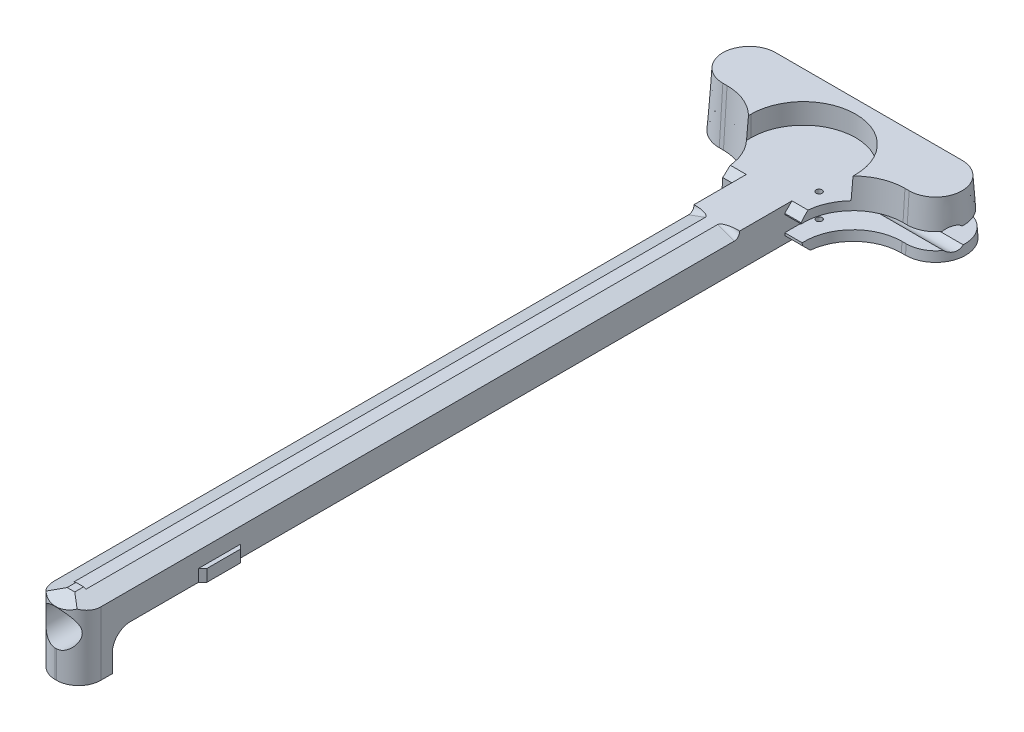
ISO-10303-21;
HEADER;
FILE_DESCRIPTION(('STEP AP214'),'2;1');
FILE_NAME('part.step','',(''),(''),'','','');
FILE_SCHEMA(('AUTOMOTIVE_DESIGN { 1 0 10303 214 1 1 1 1 }'));
ENDSEC;
DATA;
#1=APPLICATION_CONTEXT('core data for automotive mechanical design processes');
#2=APPLICATION_PROTOCOL_DEFINITION('international standard','automotive_design',2000,#1);
#3=PRODUCT_CONTEXT('',#1,'mechanical');
#4=PRODUCT('Part','Part','',(#3));
#5=PRODUCT_RELATED_PRODUCT_CATEGORY('part','',(#4));
#6=PRODUCT_DEFINITION_FORMATION('','',#4);
#7=PRODUCT_DEFINITION_CONTEXT('part definition',#1,'design');
#8=PRODUCT_DEFINITION('design','',#6,#7);
#9=PRODUCT_DEFINITION_SHAPE('','',#8);
#10=(LENGTH_UNIT() NAMED_UNIT(*) SI_UNIT(.MILLI.,.METRE.));
#11=(NAMED_UNIT(*) PLANE_ANGLE_UNIT() SI_UNIT($,.RADIAN.));
#12=(NAMED_UNIT(*) SI_UNIT($,.STERADIAN.) SOLID_ANGLE_UNIT());
#13=UNCERTAINTY_MEASURE_WITH_UNIT(LENGTH_MEASURE(1.E-05),#10,'distance_accuracy_value','');
#14=(GEOMETRIC_REPRESENTATION_CONTEXT(3) GLOBAL_UNCERTAINTY_ASSIGNED_CONTEXT((#13)) GLOBAL_UNIT_ASSIGNED_CONTEXT((#10,
#11,#12)) REPRESENTATION_CONTEXT('',''));
#15=CARTESIAN_POINT('',(0.,0.,0.));
#16=DIRECTION('',(0.,0.,1.));
#17=DIRECTION('',(1.,0.,0.));
#18=AXIS2_PLACEMENT_3D('',#15,#16,#17);
#19=CARTESIAN_POINT('',(-5.715,0.,126.2128815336));
#20=DIRECTION('',(-0.707106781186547,0.,0.707106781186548));
#21=DIRECTION('',(0.707106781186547,0.,0.707106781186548));
#22=AXIS2_PLACEMENT_3D('',#19,#20,#21);
#23=PLANE('',#22);
#24=DIRECTION('',(0.707106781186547,0.,0.707106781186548));
#25=VECTOR('',#24,1.);
#26=CARTESIAN_POINT('',(-5.715,2.54000000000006,126.2128815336));
#27=LINE('',#26,#25);
#28=CARTESIAN_POINT('',(-4.826,2.53999999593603,127.101881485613));
#29=VERTEX_POINT('',#28);
#30=CARTESIAN_POINT('',(-5.715,2.54000000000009,126.212881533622));
#31=VERTEX_POINT('',#30);
#32=EDGE_CURVE('E47',#29,#31,#27,.F.);
#33=ORIENTED_EDGE('',*,*,#32,.T.);
#34=DIRECTION('',(0.,1.,0.));
#35=VECTOR('',#34,1.);
#36=CARTESIAN_POINT('',(-5.715,1.27000000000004,126.2128815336));
#37=LINE('',#36,#35);
#38=CARTESIAN_POINT('',(-5.71499999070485,1.01915004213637E-13,126.212881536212));
#39=VERTEX_POINT('',#38);
#40=EDGE_CURVE('E409',#39,#31,#37,.T.);
#41=ORIENTED_EDGE('',*,*,#40,.F.);
#42=DIRECTION('',(0.707106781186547,0.,0.707106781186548));
#43=VECTOR('',#42,1.);
#44=CARTESIAN_POINT('',(-5.2705,0.,126.6573815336));
#45=LINE('',#44,#43);
#46=CARTESIAN_POINT('',(-4.82599999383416,0.,127.101881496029));
#47=VERTEX_POINT('',#46);
#48=EDGE_CURVE('E395',#39,#47,#45,.T.);
#49=ORIENTED_EDGE('',*,*,#48,.T.);
#50=DIRECTION('',(0.,1.,0.));
#51=VECTOR('',#50,1.);
#52=CARTESIAN_POINT('',(-4.826,-0.253999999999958,127.101881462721));
#53=LINE('',#52,#51);
#54=EDGE_CURVE('E845',#47,#29,#53,.T.);
#55=ORIENTED_EDGE('',*,*,#54,.T.);
#56=EDGE_LOOP('',(#33,#41,#49,#55));
#57=FACE_BOUND('',#56,.T.);
#58=ADVANCED_FACE('F43',(#57),#23,.T.);
#59=CARTESIAN_POINT('',(-5.715,2.54000000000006,127.1552215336));
#60=DIRECTION('',(0.,-1.,0.));
#61=DIRECTION('',(0.,0.,-1.));
#62=AXIS2_PLACEMENT_3D('',#59,#60,#61);
#63=PLANE('',#62);
#64=ORIENTED_EDGE('',*,*,#32,.F.);
#65=DIRECTION('',(0.,0.,-1.));
#66=VECTOR('',#65,1.);
#67=CARTESIAN_POINT('',(-4.826,2.53999999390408,74.2378499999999));
#68=LINE('',#67,#66);
#69=CARTESIAN_POINT('',(-4.82599998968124,2.53999999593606,118.211881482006));
#70=VERTEX_POINT('',#69);
#71=EDGE_CURVE('E847',#29,#70,#68,.T.);
#72=ORIENTED_EDGE('',*,*,#71,.T.);
#73=DIRECTION('',(0.707106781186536,0.,-0.707106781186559));
#74=VECTOR('',#73,1.);
#75=CARTESIAN_POINT('',(-5.2705,2.54000000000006,118.6563815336));
#76=LINE('',#75,#74);
#77=CARTESIAN_POINT('',(-5.715,2.54000000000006,119.1008815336));
#78=VERTEX_POINT('',#77);
#79=EDGE_CURVE('E1335',#78,#70,#76,.T.);
#80=ORIENTED_EDGE('',*,*,#79,.F.);
#81=DIRECTION('',(0.,0.,-1.));
#82=VECTOR('',#81,1.);
#83=CARTESIAN_POINT('',(-5.715,2.54000000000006,122.6568815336));
#84=LINE('',#83,#82);
#85=EDGE_CURVE('E412',#31,#78,#84,.T.);
#86=ORIENTED_EDGE('',*,*,#85,.F.);
#87=EDGE_LOOP('',(#64,#72,#80,#86));
#88=FACE_BOUND('',#87,.T.);
#89=ADVANCED_FACE('F1672',(#88),#63,.F.);
#90=CARTESIAN_POINT('',(-4.826,0.,118.2118815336));
#91=DIRECTION('',(-0.707106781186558,0.,-0.707106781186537));
#92=DIRECTION('',(-0.707106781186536,0.,0.707106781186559));
#93=AXIS2_PLACEMENT_3D('',#90,#91,#92);
#94=PLANE('',#93);
#95=ORIENTED_EDGE('',*,*,#79,.T.);
#96=DIRECTION('',(0.,-1.,0.));
#97=VECTOR('',#96,1.);
#98=CARTESIAN_POINT('',(-4.826,-0.253999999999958,118.211881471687));
#99=LINE('',#98,#97);
#100=CARTESIAN_POINT('',(-4.82599999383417,0.,118.211881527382));
#101=VERTEX_POINT('',#100);
#102=EDGE_CURVE('E848',#70,#101,#99,.T.);
#103=ORIENTED_EDGE('',*,*,#102,.T.);
#104=DIRECTION('',(-0.707106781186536,0.,0.707106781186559));
#105=VECTOR('',#104,1.);
#106=CARTESIAN_POINT('',(-5.2705,0.,118.6563815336));
#107=LINE('',#106,#105);
#108=CARTESIAN_POINT('',(-5.715,0.,119.1008815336));
#109=VERTEX_POINT('',#108);
#110=EDGE_CURVE('E1849',#101,#109,#107,.T.);
#111=ORIENTED_EDGE('',*,*,#110,.T.);
#112=DIRECTION('',(0.,-1.,0.));
#113=VECTOR('',#112,1.);
#114=CARTESIAN_POINT('',(-5.715,1.2700000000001,119.1008815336));
#115=LINE('',#114,#113);
#116=EDGE_CURVE('E418',#78,#109,#115,.T.);
#117=ORIENTED_EDGE('',*,*,#116,.F.);
#118=EDGE_LOOP('',(#95,#103,#111,#117));
#119=FACE_BOUND('',#118,.T.);
#120=ADVANCED_FACE('F1665',(#119),#94,.T.);
#121=CARTESIAN_POINT('',(-11.049,7.11200000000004,-4.61246433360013));
#122=DIRECTION('',(1.,0.,0.));
#123=DIRECTION('',(0.,0.,-1.));
#124=AXIS2_PLACEMENT_3D('',#121,#122,#123);
#125=PLANE('',#124);
#126=DIRECTION('',(0.,0.,-1.));
#127=VECTOR('',#126,1.);
#128=CARTESIAN_POINT('',(-11.049,7.11200000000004,-5.10023216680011));
#129=LINE('',#128,#127);
#130=CARTESIAN_POINT('',(-11.049000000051,7.11199999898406,-4.61828265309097));
#131=VERTEX_POINT('',#130);
#132=CARTESIAN_POINT('',(-11.049,7.11200000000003,-5.58799999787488));
#133=VERTEX_POINT('',#132);
#134=EDGE_CURVE('E1301',#131,#133,#129,.T.);
#135=ORIENTED_EDGE('',*,*,#134,.T.);
#136=DIRECTION('',(0.,1.,0.));
#137=VECTOR('',#136,1.);
#138=CARTESIAN_POINT('',(-11.049,9.27100000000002,-5.58799999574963));
#139=LINE('',#138,#137);
#140=CARTESIAN_POINT('',(-11.049,11.43,-5.58799999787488));
#141=VERTEX_POINT('',#140);
#142=EDGE_CURVE('E880',#141,#133,#139,.F.);
#143=ORIENTED_EDGE('',*,*,#142,.F.);
#144=DIRECTION('',(0.,0.,1.));
#145=VECTOR('',#144,1.);
#146=CARTESIAN_POINT('',(-11.049,11.4300000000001,-5.10023216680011));
#147=LINE('',#146,#145);
#148=CARTESIAN_POINT('',(-11.0489999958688,11.43,-5.0319658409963));
#149=VERTEX_POINT('',#148);
#150=EDGE_CURVE('E1333',#141,#149,#147,.T.);
#151=ORIENTED_EDGE('',*,*,#150,.T.);
#152=CARTESIAN_POINT('',(-11.048999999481,11.4300000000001,-5.03196583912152));
#153=CARTESIAN_POINT('',(-11.0489999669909,11.2462222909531,-5.01460356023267));
#154=CARTESIAN_POINT('',(-11.0489999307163,11.0624473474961,-4.99721200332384));
#155=CARTESIAN_POINT('',(-11.0489998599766,10.6959998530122,-4.96247308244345));
#156=CARTESIAN_POINT('',(-11.048999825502,10.5133272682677,-4.94512607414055));
#157=CARTESIAN_POINT('',(-11.0489997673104,10.1490844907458,-4.91047611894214));
#158=CARTESIAN_POINT('',(-11.0489997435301,9.96751426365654,-4.89317353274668));
#159=CARTESIAN_POINT('',(-11.0489997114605,9.60547620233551,-4.85861227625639));
#160=CARTESIAN_POINT('',(-11.0489997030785,9.42500833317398,-4.84135397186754));
#161=CARTESIAN_POINT('',(-11.0489997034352,9.06517498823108,-4.80688113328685));
#162=CARTESIAN_POINT('',(-11.0489997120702,8.8858094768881,-4.78966697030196));
#163=CARTESIAN_POINT('',(-11.048999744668,8.52818084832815,-4.75528226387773));
#164=CARTESIAN_POINT('',(-11.0489997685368,8.34991769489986,-4.73811209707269));
#165=CARTESIAN_POINT('',(-11.0489998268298,7.99449378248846,-4.70381523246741));
#166=CARTESIAN_POINT('',(-11.0489998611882,7.81733298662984,-4.68668891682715));
#167=CARTESIAN_POINT('',(-11.0489999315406,7.46411379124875,-4.65247958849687));
#168=CARTESIAN_POINT('',(-11.0489999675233,7.28805535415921,-4.6353969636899));
#169=CARTESIAN_POINT('',(-11.0490000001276,7.11199999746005,-4.618282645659));
#170=B_SPLINE_CURVE_WITH_KNOTS('',3,(#152,#153,#154,#155,#156,#157,#158,#159,#160,#161,#162,
#163,#164,#165,#166,#167,#168,#169),.UNSPECIFIED.,.F.,.F.,(4,2,2,2,2,2,2,2,4),(0.,
0.553788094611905,1.10427126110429,1.65144959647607,2.19532320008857,2.73589217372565,
3.27315662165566,3.80711665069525,4.33777237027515),.UNSPECIFIED.);
#171=EDGE_CURVE('E816',#131,#149,#170,.F.);
#172=ORIENTED_EDGE('',*,*,#171,.F.);
#173=EDGE_LOOP('',(#135,#143,#151,#172));
#174=FACE_BOUND('',#173,.T.);
#175=ADVANCED_FACE('F451',(#174),#125,.T.);
#176=CARTESIAN_POINT('',(-8.5685951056,1.52400000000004,3.1749999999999));
#177=DIRECTION('',(0.,0.,1.));
#178=DIRECTION('',(1.,0.,0.));
#179=AXIS2_PLACEMENT_3D('',#176,#177,#178);
#180=PLANE('',#179);
#181=DIRECTION('',(-1.,0.,0.));
#182=VECTOR('',#181,1.);
#183=CARTESIAN_POINT('',(-6.7676338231,1.52400000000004,3.1749999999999));
#184=LINE('',#183,#182);
#185=CARTESIAN_POINT('',(-4.826,1.52400000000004,3.17499999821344));
#186=VERTEX_POINT('',#185);
#187=CARTESIAN_POINT('',(-8.54627345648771,1.52399999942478,3.17500000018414));
#188=VERTEX_POINT('',#187);
#189=EDGE_CURVE('E305',#186,#188,#184,.T.);
#190=ORIENTED_EDGE('',*,*,#189,.F.);
#191=DIRECTION('',(0.,1.,0.));
#192=VECTOR('',#191,1.);
#193=CARTESIAN_POINT('',(-4.826,-0.253999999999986,3.17499999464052));
#194=LINE('',#193,#192);
#195=CARTESIAN_POINT('',(-4.826,5.58799999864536,3.17499999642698));
#196=VERTEX_POINT('',#195);
#197=EDGE_CURVE('E732',#186,#196,#194,.T.);
#198=ORIENTED_EDGE('',*,*,#197,.T.);
#199=DIRECTION('',(1.,0.,0.));
#200=VECTOR('',#199,1.);
#201=CARTESIAN_POINT('',(-6.5610013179,5.58800000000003,3.1749999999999));
#202=LINE('',#201,#200);
#203=CARTESIAN_POINT('',(-8.27530679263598,5.58800000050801,3.17500000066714));
#204=VERTEX_POINT('',#203);
#205=EDGE_CURVE('E413',#204,#196,#202,.T.);
#206=ORIENTED_EDGE('',*,*,#205,.F.);
#207=CARTESIAN_POINT('',(-8.54627346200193,1.52399999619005,3.17500000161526));
#208=CARTESIAN_POINT('',(-8.53498353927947,1.69333333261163,3.17501436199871));
#209=CARTESIAN_POINT('',(-8.52369357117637,1.86266666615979,3.17502692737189));
#210=CARTESIAN_POINT('',(-8.50111354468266,2.2013333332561,3.17504846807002));
#211=CARTESIAN_POINT('',(-8.48982348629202,2.37066666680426,3.17505744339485));
#212=CARTESIAN_POINT('',(-8.46724328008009,2.70933333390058,3.17507180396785));
#213=CARTESIAN_POINT('',(-8.45595313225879,2.87866666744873,3.17507718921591));
#214=CARTESIAN_POINT('',(-8.43337274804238,3.21733333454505,3.17508436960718));
#215=CARTESIAN_POINT('',(-8.42208251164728,3.38666666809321,3.17508616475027));
#216=CARTESIAN_POINT('',(-8.39950195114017,3.72533333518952,3.1750861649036));
#217=CARTESIAN_POINT('',(-8.38821162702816,3.89466666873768,3.17508436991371));
#218=CARTESIAN_POINT('',(-8.36563089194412,4.23333333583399,3.17507718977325));
#219=CARTESIAN_POINT('',(-8.35434048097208,4.40266666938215,3.17507180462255));
#220=CARTESIAN_POINT('',(-8.33175957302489,4.74133333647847,3.1750574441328));
#221=CARTESIAN_POINT('',(-8.32046907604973,4.91066667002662,3.17504846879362));
#222=CARTESIAN_POINT('',(-8.29788799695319,5.24933333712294,3.17502692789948));
#223=CARTESIAN_POINT('',(-8.2865974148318,5.4186666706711,3.1750143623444));
#224=CARTESIAN_POINT('',(-8.27530679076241,5.58800000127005,3.17500000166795));
#225=B_SPLINE_CURVE_WITH_KNOTS('',3,(#207,#208,#209,#210,#211,#212,#213,#214,#215,#216,#217,
#218,#219,#220,#221,#222,#223,#224),.UNSPECIFIED.,.F.,.F.,(4,2,2,2,2,2,2,2,4),(0.,
0.509127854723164,1.01825572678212,1.52738361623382,2.03651152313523,2.54563944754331,
3.05476738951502,3.56389534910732,4.07302332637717),.UNSPECIFIED.);
#226=EDGE_CURVE('E433',#188,#204,#225,.T.);
#227=ORIENTED_EDGE('',*,*,#226,.F.);
#228=EDGE_LOOP('',(#190,#198,#206,#227));
#229=FACE_BOUND('',#228,.T.);
#230=ADVANCED_FACE('F440',(#229),#180,.T.);
#231=CARTESIAN_POINT('',(-19.685,11.43,-8.25500000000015));
#232=DIRECTION('',(0.,0.0664480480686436,0.997789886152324));
#233=DIRECTION('',(0.,-0.997789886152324,0.0664480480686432));
#234=AXIS2_PLACEMENT_3D('',#231,#232,#233);
#235=PLANE('',#234);
#236=DIRECTION('',(2.72574972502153E-11,0.997789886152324,-0.066448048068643));
#237=VECTOR('',#236,1.);
#238=CARTESIAN_POINT('',(-19.6850000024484,5.71500000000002,-7.87440825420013));
#239=LINE('',#238,#237);
#240=CARTESIAN_POINT('',(-19.6850000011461,11.4300000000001,-8.25500000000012));
#241=VERTEX_POINT('',#240);
#242=CARTESIAN_POINT('',(-19.6850000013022,0.,-7.49381650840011));
#243=VERTEX_POINT('',#242);
#244=EDGE_CURVE('E799',#241,#243,#239,.F.);
#245=ORIENTED_EDGE('',*,*,#244,.T.);
#246=DIRECTION('',(1.,0.,0.));
#247=VECTOR('',#246,1.);
#248=CARTESIAN_POINT('',(-19.2405,0.,-7.49381650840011));
#249=LINE('',#248,#247);
#250=CARTESIAN_POINT('',(-18.796000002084,0.,-7.49381650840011));
#251=VERTEX_POINT('',#250);
#252=EDGE_CURVE('E912',#243,#251,#249,.T.);
#253=ORIENTED_EDGE('',*,*,#252,.T.);
#254=DIRECTION('',(-2.72574972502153E-11,0.997789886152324,-0.0664480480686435));
#255=VECTOR('',#254,1.);
#256=CARTESIAN_POINT('',(-18.7960000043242,5.71500000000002,-7.87440825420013));
#257=LINE('',#256,#255);
#258=CARTESIAN_POINT('',(-18.7960000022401,11.43,-8.25500000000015));
#259=VERTEX_POINT('',#258);
#260=EDGE_CURVE('E814',#259,#251,#257,.F.);
#261=ORIENTED_EDGE('',*,*,#260,.F.);
#262=DIRECTION('',(-1.,0.,0.));
#263=VECTOR('',#262,1.);
#264=CARTESIAN_POINT('',(-19.2405,11.43,-8.25500000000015));
#265=LINE('',#264,#263);
#266=EDGE_CURVE('E296',#259,#241,#265,.T.);
#267=ORIENTED_EDGE('',*,*,#266,.T.);
#268=EDGE_LOOP('',(#245,#253,#261,#267));
#269=FACE_BOUND('',#268,.T.);
#270=ADVANCED_FACE('F450',(#269),#235,.T.);
#271=CARTESIAN_POINT('',(11.049,7.11200000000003,-5.58800000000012));
#272=DIRECTION('',(-1.,0.,0.));
#273=DIRECTION('',(0.,0.,1.));
#274=AXIS2_PLACEMENT_3D('',#271,#272,#273);
#275=PLANE('',#274);
#276=DIRECTION('',(0.,0.,-1.));
#277=VECTOR('',#276,1.);
#278=CARTESIAN_POINT('',(11.0489999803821,11.43,-12.1882858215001));
#279=LINE('',#278,#277);
#280=CARTESIAN_POINT('',(11.0489999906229,11.43,-5.03196583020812));
#281=VERTEX_POINT('',#280);
#282=CARTESIAN_POINT('',(11.048999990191,11.43,-5.587999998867));
#283=VERTEX_POINT('',#282);
#284=EDGE_CURVE('E785',#281,#283,#279,.T.);
#285=ORIENTED_EDGE('',*,*,#284,.T.);
#286=DIRECTION('',(0.,-1.,0.));
#287=VECTOR('',#286,1.);
#288=CARTESIAN_POINT('',(11.049,9.27100000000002,-5.58799999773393));
#289=LINE('',#288,#287);
#290=CARTESIAN_POINT('',(11.049,7.11200000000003,-5.58799999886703));
#291=VERTEX_POINT('',#290);
#292=EDGE_CURVE('E877',#291,#283,#289,.F.);
#293=ORIENTED_EDGE('',*,*,#292,.F.);
#294=DIRECTION('',(0.,0.,1.));
#295=VECTOR('',#294,1.);
#296=CARTESIAN_POINT('',(11.049,7.11200000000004,-5.10023216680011));
#297=LINE('',#296,#295);
#298=CARTESIAN_POINT('',(11.0489999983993,7.11200000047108,-4.61828265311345));
#299=VERTEX_POINT('',#298);
#300=EDGE_CURVE('E900',#291,#299,#297,.T.);
#301=ORIENTED_EDGE('',*,*,#300,.T.);
#302=CARTESIAN_POINT('',(11.0489999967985,7.11200000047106,-4.61828265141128));
#303=CARTESIAN_POINT('',(11.0489999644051,7.28805535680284,-4.63539696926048));
#304=CARTESIAN_POINT('',(11.0489999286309,7.46411379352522,-4.65247959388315));
#305=CARTESIAN_POINT('',(11.0489998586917,7.81733298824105,-4.68668892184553));
#306=CARTESIAN_POINT('',(11.0489998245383,7.99449378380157,-4.70381523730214));
#307=CARTESIAN_POINT('',(11.0489997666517,8.34991769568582,-4.73811210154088));
#308=CARTESIAN_POINT('',(11.0489997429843,8.52818084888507,-4.75528226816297));
#309=CARTESIAN_POINT('',(11.0489997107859,8.88580947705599,-4.78966697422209));
#310=CARTESIAN_POINT('',(11.0489997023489,9.06517498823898,-4.80688113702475));
#311=CARTESIAN_POINT('',(11.0489997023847,9.42500833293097,-4.84135397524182));
#312=CARTESIAN_POINT('',(11.0489997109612,9.60547620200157,-4.85861227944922));
#313=CARTESIAN_POINT('',(11.0489997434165,9.9675142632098,-4.89317353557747));
#314=CARTESIAN_POINT('',(11.0489997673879,10.1490844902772,-4.91047612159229));
#315=CARTESIAN_POINT('',(11.0489998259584,10.5133272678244,-4.94512607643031));
#316=CARTESIAN_POINT('',(11.0489998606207,10.6959998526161,-4.96247308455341));
#317=CARTESIAN_POINT('',(11.0489999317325,11.0624473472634,-4.99721200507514));
#318=CARTESIAN_POINT('',(11.0489999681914,11.2462222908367,-5.01460356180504));
#319=CARTESIAN_POINT('',(11.0490000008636,11.43,-5.03196584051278));
#320=B_SPLINE_CURVE_WITH_KNOTS('',3,(#302,#303,#304,#305,#306,#307,#308,#309,#310,#311,#312,
#313,#314,#315,#316,#317,#318,#319),.UNSPECIFIED.,.F.,.F.,(4,2,2,2,2,2,2,2,4),(0.,
0.530655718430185,1.06461574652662,1.60188019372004,2.14244916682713,2.68632277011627,
3.23350110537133,3.78398427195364,4.33777236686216),.UNSPECIFIED.);
#321=EDGE_CURVE('E777',#281,#299,#320,.F.);
#322=ORIENTED_EDGE('',*,*,#321,.F.);
#323=EDGE_LOOP('',(#285,#293,#301,#322));
#324=FACE_BOUND('',#323,.T.);
#325=ADVANCED_FACE('F455',(#324),#275,.T.);
#326=CARTESIAN_POINT('',(-0.126999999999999,-7.61999999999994,147.701));
#327=DIRECTION('',(0.,1.,0.));
#328=DIRECTION('',(0.,0.,1.));
#329=AXIS2_PLACEMENT_3D('',#326,#327,#328);
#330=CYLINDRICAL_SURFACE('',#329,4.69900000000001);
#331=DIRECTION('',(0.,-1.,0.));
#332=VECTOR('',#331,1.);
#333=CARTESIAN_POINT('',(-4.826,-0.25399999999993,147.701));
#334=LINE('',#333,#332);
#335=CARTESIAN_POINT('',(-4.826,5.83121218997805,147.70100002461));
#336=VERTEX_POINT('',#335);
#337=CARTESIAN_POINT('',(-4.826,-7.61999999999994,147.701));
#338=VERTEX_POINT('',#337);
#339=EDGE_CURVE('E838',#336,#338,#334,.T.);
#340=ORIENTED_EDGE('',*,*,#339,.T.);
#341=CARTESIAN_POINT('',(-0.126999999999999,-7.61999999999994,147.701));
#342=DIRECTION('',(0.,1.,0.));
#343=DIRECTION('',(0.,0.,1.));
#344=AXIS2_PLACEMENT_3D('',#341,#342,#343);
#345=CIRCLE('',#344,4.69900000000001);
#346=CARTESIAN_POINT('',(-0.126999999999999,-7.61999999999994,152.4));
#347=VERTEX_POINT('',#346);
#348=EDGE_CURVE('E657',#338,#347,#345,.T.);
#349=ORIENTED_EDGE('',*,*,#348,.T.);
#350=DIRECTION('',(0.,-1.,0.));
#351=VECTOR('',#350,1.);
#352=CARTESIAN_POINT('',(-0.126999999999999,-4.71724271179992,152.4));
#353=LINE('',#352,#351);
#354=CARTESIAN_POINT('',(-0.127000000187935,-1.84911074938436,152.4));
#355=VERTEX_POINT('',#354);
#356=EDGE_CURVE('E717',#355,#347,#353,.T.);
#357=ORIENTED_EDGE('',*,*,#356,.F.);
#358=CARTESIAN_POINT('',(-3.81,1.95877200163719,150.619237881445));
#359=CARTESIAN_POINT('',(-3.81000024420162,1.9339389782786,150.619238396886));
#360=CARTESIAN_POINT('',(-3.80975722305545,1.90910633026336,150.619555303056));
#361=CARTESIAN_POINT('',(-3.80878313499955,1.85929735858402,150.620812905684));
#362=CARTESIAN_POINT('',(-3.80804876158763,1.83432120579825,150.621757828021));
#363=CARTESIAN_POINT('',(-3.80608326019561,1.78423519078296,150.624271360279));
#364=CARTESIAN_POINT('',(-3.80484851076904,1.75912569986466,150.625844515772));
#365=CARTESIAN_POINT('',(-3.80187405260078,1.70878302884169,150.629614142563));
#366=CARTESIAN_POINT('',(-3.80013042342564,1.6835504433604,150.631815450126));
#367=CARTESIAN_POINT('',(-3.79613004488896,1.63297198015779,150.636841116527));
#368=CARTESIAN_POINT('',(-3.79386909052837,1.60762694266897,150.639670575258));
#369=CARTESIAN_POINT('',(-3.78882611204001,1.55683438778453,150.645952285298));
#370=CARTESIAN_POINT('',(-3.78603961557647,1.53138797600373,150.649409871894));
#371=CARTESIAN_POINT('',(-3.77993767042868,1.48040343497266,150.656947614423));
#372=CARTESIAN_POINT('',(-3.77661749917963,1.45486668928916,150.661033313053));
#373=CARTESIAN_POINT('',(-3.76944086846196,1.40371405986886,150.66982707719));
#374=CARTESIAN_POINT('',(-3.76557945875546,1.37809986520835,150.674540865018));
#375=CARTESIAN_POINT('',(-3.75311378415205,1.30075095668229,150.689693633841));
#376=CARTESIAN_POINT('',(-3.74372407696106,1.24931216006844,150.701024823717));
#377=CARTESIAN_POINT('',(-3.72425332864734,1.15371714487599,150.724340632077));
#378=CARTESIAN_POINT('',(-3.71440310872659,1.10945011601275,150.736069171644));
#379=CARTESIAN_POINT('',(-3.69272791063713,1.01957082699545,150.761584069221));
#380=CARTESIAN_POINT('',(-3.68083067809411,0.973996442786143,150.775442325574));
#381=CARTESIAN_POINT('',(-3.65489163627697,0.881610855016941,150.805219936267));
#382=CARTESIAN_POINT('',(-3.640775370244,0.834842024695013,150.821205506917));
#383=CARTESIAN_POINT('',(-3.6102274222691,0.740189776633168,150.855242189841));
#384=CARTESIAN_POINT('',(-3.59371943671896,0.692353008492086,150.873354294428));
#385=CARTESIAN_POINT('',(-3.55821840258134,0.595706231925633,150.911655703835));
#386=CARTESIAN_POINT('',(-3.53914758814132,0.546947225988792,150.931901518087));
#387=CARTESIAN_POINT('',(-3.50174733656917,0.456794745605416,150.970905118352));
#388=CARTESIAN_POINT('',(-3.48363146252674,0.415252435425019,150.989525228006));
#389=CARTESIAN_POINT('',(-3.44468823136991,0.330100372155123,151.028835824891));
#390=CARTESIAN_POINT('',(-3.42375947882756,0.286560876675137,151.049578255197));
#391=CARTESIAN_POINT('',(-3.39068597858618,0.220960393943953,151.081713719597));
#392=CARTESIAN_POINT('',(-3.37908431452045,0.198508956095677,151.092873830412));
#393=CARTESIAN_POINT('',(-3.35749054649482,0.157718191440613,151.113435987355));
#394=CARTESIAN_POINT('',(-3.34756237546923,0.13933208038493,151.122812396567));
#395=CARTESIAN_POINT('',(-3.31551478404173,0.0811302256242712,151.15281128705));
#396=CARTESIAN_POINT('',(-3.29286847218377,0.0416963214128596,151.173614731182));
#397=CARTESIAN_POINT('',(-3.24364767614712,-0.0405769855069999,151.217874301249));
#398=CARTESIAN_POINT('',(-3.21691721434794,-0.0833036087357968,151.24136674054));
#399=CARTESIAN_POINT('',(-3.17111648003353,-0.15339234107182,151.280752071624));
#400=CARTESIAN_POINT('',(-3.15248658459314,-0.181097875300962,151.296549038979));
#401=CARTESIAN_POINT('',(-3.10477885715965,-0.250073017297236,151.336300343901));
#402=CARTESIAN_POINT('',(-3.0752430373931,-0.291011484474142,151.360283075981));
#403=CARTESIAN_POINT('',(-3.02589335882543,-0.356626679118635,151.39934404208));
#404=CARTESIAN_POINT('',(-3.00656055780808,-0.381675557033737,151.414408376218));
#405=CARTESIAN_POINT('',(-2.96962781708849,-0.428315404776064,151.442723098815));
#406=CARTESIAN_POINT('',(-2.9520977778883,-0.449961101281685,151.455974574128));
#407=CARTESIAN_POINT('',(-2.9033011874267,-0.508880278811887,151.492312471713));
#408=CARTESIAN_POINT('',(-2.8715406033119,-0.545769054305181,151.515362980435));
#409=CARTESIAN_POINT('',(-2.81288047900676,-0.611314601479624,151.556837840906));
#410=CARTESIAN_POINT('',(-2.78623368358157,-0.640179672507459,151.575291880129));
#411=CARTESIAN_POINT('',(-2.72315223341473,-0.706422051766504,151.617949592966));
#412=CARTESIAN_POINT('',(-2.68635576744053,-0.743510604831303,151.642068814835));
#413=CARTESIAN_POINT('',(-2.61308078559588,-0.814379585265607,151.688605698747));
#414=CARTESIAN_POINT('',(-2.57668608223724,-0.8482316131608,151.711046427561));
#415=CARTESIAN_POINT('',(-2.50447725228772,-0.91279697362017,151.754221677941));
#416=CARTESIAN_POINT('',(-2.46874142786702,-0.943580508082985,151.774982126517));
#417=CARTESIAN_POINT('',(-2.39809017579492,-1.00218152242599,151.814796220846));
#418=CARTESIAN_POINT('',(-2.36324786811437,-1.03006738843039,151.833878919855));
#419=CARTESIAN_POINT('',(-2.29459679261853,-1.08305114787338,151.870327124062));
#420=CARTESIAN_POINT('',(-2.26085659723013,-1.10821496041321,151.887725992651));
#421=CARTESIAN_POINT('',(-2.18571953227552,-1.16232858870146,151.925265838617));
#422=CARTESIAN_POINT('',(-2.1441073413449,-1.19106557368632,151.945283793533));
#423=CARTESIAN_POINT('',(-2.0606695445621,-1.24625102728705,151.983896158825));
#424=CARTESIAN_POINT('',(-2.01888261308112,-1.27274106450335,152.002514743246));
#425=CARTESIAN_POINT('',(-1.93522636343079,-1.32350216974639,152.03831990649));
#426=CARTESIAN_POINT('',(-1.89339340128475,-1.34781498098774,152.055532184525));
#427=CARTESIAN_POINT('',(-1.80977159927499,-1.3942934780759,152.088525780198));
#428=CARTESIAN_POINT('',(-1.76801669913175,-1.41650099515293,152.104334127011));
#429=CARTESIAN_POINT('',(-1.68466817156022,-1.45884607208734,152.134515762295));
#430=CARTESIAN_POINT('',(-1.64310610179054,-1.47902536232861,152.148917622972));
#431=CARTESIAN_POINT('',(-1.55472943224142,-1.51995214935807,152.178117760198));
#432=CARTESIAN_POINT('',(-1.50780954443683,-1.54054980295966,152.192808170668));
#433=CARTESIAN_POINT('',(-1.41368410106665,-1.57961005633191,152.220642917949));
#434=CARTESIAN_POINT('',(-1.36649827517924,-1.59810397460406,152.233810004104));
#435=CARTESIAN_POINT('',(-1.27194175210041,-1.63299070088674,152.258595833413));
#436=CARTESIAN_POINT('',(-1.22458847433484,-1.64941440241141,152.27023748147));
#437=CARTESIAN_POINT('',(-1.12979503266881,-1.68019820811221,152.291973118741));
#438=CARTESIAN_POINT('',(-1.08236996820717,-1.69458859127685,152.302090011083));
#439=CARTESIAN_POINT('',(-0.987526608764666,-1.72134739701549,152.320775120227));
#440=CARTESIAN_POINT('',(-0.940121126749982,-1.7337452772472,152.329366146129));
#441=CARTESIAN_POINT('',(-0.841925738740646,-1.75740268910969,152.345577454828));
#442=CARTESIAN_POINT('',(-0.791096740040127,-1.76855730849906,152.35311468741));
#443=CARTESIAN_POINT('',(-0.689235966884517,-1.78872411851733,152.366502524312));
#444=CARTESIAN_POINT('',(-0.638209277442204,-1.79775313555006,152.372366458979));
#445=CARTESIAN_POINT('',(-0.536043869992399,-1.81368218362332,152.382408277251));
#446=CARTESIAN_POINT('',(-0.484908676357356,-1.8205972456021,152.386598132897));
#447=CARTESIAN_POINT('',(-0.382615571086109,-1.83231459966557,152.393293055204));
#448=CARTESIAN_POINT('',(-0.331459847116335,-1.83712997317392,152.395808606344));
#449=CARTESIAN_POINT('',(-0.229213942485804,-1.84467105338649,152.399157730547));
#450=CARTESIAN_POINT('',(-0.178124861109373,-1.8474077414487,152.40000018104));
#451=CARTESIAN_POINT('',(-0.12700000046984,-1.84911074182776,152.4));
#452=B_SPLINE_CURVE_WITH_KNOTS('',3,(#358,#359,#360,#361,#362,#363,#364,#365,#366,#367,#368,
#369,#370,#371,#372,#373,#374,#375,#376,#377,#378,#379,#380,#381,#382,#383,#384,#385,#386,#387,
#388,#389,#390,#391,#392,#393,#394,#395,#396,#397,#398,#399,#400,#401,#402,#403,#404,#405,#406,
#407,#408,#409,#410,#411,#412,#413,#414,#415,#416,#417,#418,#419,#420,#421,#422,#423,#424,#425,
#426,#427,#428,#429,#430,#431,#432,#433,#434,#435,#436,#437,#438,#439,#440,#441,#442,#443,#444,
#445,#446,#447,#448,#449,#450,#451),.UNSPECIFIED.,.F.,.F.,(4,2,2,2,2,2,2,2,2,2,2,2,2,2,2,2,2,2,
2,2,2,2,2,2,2,2,2,2,2,2,2,2,2,2,2,2,2,2,2,2,2,2,2,2,2,2,4),(0.,0.0744953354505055,
0.14949708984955,0.225051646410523,0.301204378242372,0.377999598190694,0.455480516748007,
0.533689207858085,0.612666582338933,0.773067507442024,0.913540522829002,1.06077823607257,
1.21492789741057,1.37611780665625,1.54446015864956,1.69141791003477,1.84909629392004,
1.93197080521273,2.00067646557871,2.15066694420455,2.31744353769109,2.4282409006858,
2.59586442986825,2.70099080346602,2.79352187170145,2.95506366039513,3.08525669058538,
3.25784308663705,3.42141337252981,3.57598060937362,3.7215603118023,3.85817108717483,
4.02129006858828,4.17983692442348,4.33386091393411,4.48341576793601,4.62856018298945,
4.78842128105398,4.94545498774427,5.09976347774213,5.25145443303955,5.40064120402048,
5.55831674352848,5.714698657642,5.86994129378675,6.02420241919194,6.1776428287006),.UNSPECIFIED.);
#453=CARTESIAN_POINT('',(-3.80999998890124,1.95877200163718,150.619237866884));
#454=VERTEX_POINT('',#453);
#455=EDGE_CURVE('E712',#454,#355,#452,.T.);
#456=ORIENTED_EDGE('',*,*,#455,.F.);
#457=CARTESIAN_POINT('',(-0.126999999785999,5.76665474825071,152.4));
#458=CARTESIAN_POINT('',(-0.177745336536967,5.76496434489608,152.400000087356));
#459=CARTESIAN_POINT('',(-0.228455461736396,5.76225560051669,152.399170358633));
#460=CARTESIAN_POINT('',(-0.32993925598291,5.75480124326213,152.395871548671));
#461=CARTESIAN_POINT('',(-0.38071187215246,5.75004505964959,152.393393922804));
#462=CARTESIAN_POINT('',(-0.482236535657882,5.73847775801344,152.386799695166));
#463=CARTESIAN_POINT('',(-0.532986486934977,5.73165403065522,152.382672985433));
#464=CARTESIAN_POINT('',(-0.634381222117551,5.71593995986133,152.372782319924));
#465=CARTESIAN_POINT('',(-0.685022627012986,5.7070351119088,152.367006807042));
#466=CARTESIAN_POINT('',(-0.786114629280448,5.68714954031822,152.353820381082));
#467=CARTESIAN_POINT('',(-0.836560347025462,5.67615256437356,152.346396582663));
#468=CARTESIAN_POINT('',(-0.934546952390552,5.65270602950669,152.330342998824));
#469=CARTESIAN_POINT('',(-0.982118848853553,5.64034029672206,152.321779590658));
#470=CARTESIAN_POINT('',(-1.07729052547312,5.61363565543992,152.303141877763));
#471=CARTESIAN_POINT('',(-1.12487757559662,5.59926731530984,152.293044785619));
#472=CARTESIAN_POINT('',(-1.21998999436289,5.56851784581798,152.271340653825));
#473=CARTESIAN_POINT('',(-1.26750033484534,5.55210644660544,152.259710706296));
#474=CARTESIAN_POINT('',(-1.36236552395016,5.51723498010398,152.234940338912));
#475=CARTESIAN_POINT('',(-1.40970301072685,5.49874401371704,152.221776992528));
#476=CARTESIAN_POINT('',(-1.50412579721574,5.45968079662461,152.193941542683));
#477=CARTESIAN_POINT('',(-1.55119140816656,5.43907721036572,152.179246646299));
#478=CARTESIAN_POINT('',(-1.63990574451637,5.39809976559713,152.15000878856));
#479=CARTESIAN_POINT('',(-1.68165864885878,5.37787450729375,152.135572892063));
#480=CARTESIAN_POINT('',(-1.76538598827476,5.33542444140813,152.105314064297));
#481=CARTESIAN_POINT('',(-1.80732868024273,5.31315757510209,152.0894623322));
#482=CARTESIAN_POINT('',(-1.89132218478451,5.26654702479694,152.056372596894));
#483=CARTESIAN_POINT('',(-1.93333883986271,5.24216118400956,152.039107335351));
#484=CARTESIAN_POINT('',(-2.01735760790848,5.19124037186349,152.003186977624));
#485=CARTESIAN_POINT('',(-2.05932311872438,5.16466333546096,151.984505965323));
#486=CARTESIAN_POINT('',(-2.14311202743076,5.10929010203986,151.945759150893));
#487=CARTESIAN_POINT('',(-2.18489647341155,5.08045202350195,151.92566895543));
#488=CARTESIAN_POINT('',(-2.26009454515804,5.02631869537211,151.888113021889));
#489=CARTESIAN_POINT('',(-2.29373238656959,5.00124516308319,151.870775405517));
#490=CARTESIAN_POINT('',(-2.36215568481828,4.94847205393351,151.834469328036));
#491=CARTESIAN_POINT('',(-2.39687379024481,4.92070768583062,151.81546807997));
#492=CARTESIAN_POINT('',(-2.46725697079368,4.86238312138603,151.775836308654));
#493=CARTESIAN_POINT('',(-2.50285025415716,4.83175575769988,151.755177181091));
#494=CARTESIAN_POINT('',(-2.57475850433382,4.76753944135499,151.712224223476));
#495=CARTESIAN_POINT('',(-2.61099663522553,4.73388156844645,151.689904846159));
#496=CARTESIAN_POINT('',(-2.68394761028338,4.66344096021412,151.643630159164));
#497=CARTESIAN_POINT('',(-2.72057825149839,4.62658796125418,151.619652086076));
#498=CARTESIAN_POINT('',(-2.78366723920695,4.56047528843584,151.577053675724));
#499=CARTESIAN_POINT('',(-2.81047338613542,4.53149357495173,151.558514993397));
#500=CARTESIAN_POINT('',(-2.86935113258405,4.46582204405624,151.516938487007));
#501=CARTESIAN_POINT('',(-2.90117327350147,4.42892656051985,151.493870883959));
#502=CARTESIAN_POINT('',(-2.9500273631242,4.37003996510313,151.457531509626));
#503=CARTESIAN_POINT('',(-2.96755521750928,4.34843512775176,151.444296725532));
#504=CARTESIAN_POINT('',(-3.00483465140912,4.30144214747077,151.415749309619));
#505=CARTESIAN_POINT('',(-3.0245054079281,4.2759906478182,151.40043535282));
#506=CARTESIAN_POINT('',(-3.07457608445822,4.2094809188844,151.360828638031));
#507=CARTESIAN_POINT('',(-3.10448572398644,4.16804330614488,151.336549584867));
#508=CARTESIAN_POINT('',(-3.15257633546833,4.09851049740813,151.296475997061));
#509=CARTESIAN_POINT('',(-3.17123456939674,4.0707599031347,151.280652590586));
#510=CARTESIAN_POINT('',(-3.21700929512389,4.00070026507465,151.241284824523));
#511=CARTESIAN_POINT('',(-3.24368962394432,3.95805059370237,151.217836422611));
#512=CARTESIAN_POINT('',(-3.29281635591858,3.87593505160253,151.173661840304));
#513=CARTESIAN_POINT('',(-3.31541843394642,3.83658167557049,151.152899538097));
#514=CARTESIAN_POINT('',(-3.34740394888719,3.77850285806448,151.122961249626));
#515=CARTESIAN_POINT('',(-3.35731210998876,3.76015788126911,151.113604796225));
#516=CARTESIAN_POINT('',(-3.37874996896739,3.71967249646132,151.093193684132));
#517=CARTESIAN_POINT('',(-3.39021990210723,3.69748835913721,151.08216296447));
#518=CARTESIAN_POINT('',(-3.42292921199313,3.63266597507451,151.050392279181));
#519=CARTESIAN_POINT('',(-3.44363797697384,3.58964633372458,151.029879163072));
#520=CARTESIAN_POINT('',(-3.48219652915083,3.50551106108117,150.990986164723));
#521=CARTESIAN_POINT('',(-3.50014495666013,3.4644638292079,150.972555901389));
#522=CARTESIAN_POINT('',(-3.53751760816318,3.37468229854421,150.933623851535));
#523=CARTESIAN_POINT('',(-3.55670677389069,3.32578395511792,150.913272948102));
#524=CARTESIAN_POINT('',(-3.59242303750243,3.22886983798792,150.874773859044));
#525=CARTESIAN_POINT('',(-3.609028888,3.18090575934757,150.856568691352));
#526=CARTESIAN_POINT('',(-3.63975375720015,3.08601161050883,150.822358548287));
#527=CARTESIAN_POINT('',(-3.65395003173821,3.03912885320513,150.806292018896));
#528=CARTESIAN_POINT('',(-3.68003260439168,2.94653111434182,150.776365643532));
#529=CARTESIAN_POINT('',(-3.69199428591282,2.90085906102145,150.762438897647));
#530=CARTESIAN_POINT('',(-3.71378505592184,2.81079675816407,150.736798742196));
#531=CARTESIAN_POINT('',(-3.72368725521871,2.76644510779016,150.72501269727));
#532=CARTESIAN_POINT('',(-3.7380803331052,2.69602630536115,150.707786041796));
#533=CARTESIAN_POINT('',(-3.74308221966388,2.67020067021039,150.701777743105));
#534=CARTESIAN_POINT('',(-3.75251985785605,2.61860172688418,150.690398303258));
#535=CARTESIAN_POINT('',(-3.75696104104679,2.5928307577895,150.685021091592));
#536=CARTESIAN_POINT('',(-3.76528493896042,2.54135431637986,150.67490510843));
#537=CARTESIAN_POINT('',(-3.76917289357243,2.51565086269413,150.670160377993));
#538=CARTESIAN_POINT('',(-3.7763983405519,2.46432187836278,150.661308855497));
#539=CARTESIAN_POINT('',(-3.77974085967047,2.43869805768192,150.657196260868));
#540=CARTESIAN_POINT('',(-3.78588365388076,2.38754049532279,150.649608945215));
#541=CARTESIAN_POINT('',(-3.78868872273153,2.36200816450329,150.646128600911));
#542=CARTESIAN_POINT('',(-3.79376506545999,2.31104534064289,150.639805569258));
#543=CARTESIAN_POINT('',(-3.79604088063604,2.28561597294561,150.636957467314));
#544=CARTESIAN_POINT('',(-3.8000673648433,2.23487046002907,150.631898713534));
#545=CARTESIAN_POINT('',(-3.80182230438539,2.209555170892,150.629682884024));
#546=CARTESIAN_POINT('',(-3.80481590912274,2.15904884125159,150.625888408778));
#547=CARTESIAN_POINT('',(-3.80605855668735,2.13385840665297,150.624304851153));
#548=CARTESIAN_POINT('',(-3.8080365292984,2.08361235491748,150.621774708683));
#549=CARTESIAN_POINT('',(-3.80877553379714,2.05855711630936,150.620823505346));
#550=CARTESIAN_POINT('',(-3.80975571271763,2.00859193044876,150.619557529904));
#551=CARTESIAN_POINT('',(-3.81000024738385,1.98368215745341,150.619238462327));
#552=CARTESIAN_POINT('',(-3.81,1.95877200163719,150.619237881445));
#553=B_SPLINE_CURVE_WITH_KNOTS('',3,(#457,#458,#459,#460,#461,#462,#463,#464,#465,#466,#467,
#468,#469,#470,#471,#472,#473,#474,#475,#476,#477,#478,#479,#480,#481,#482,#483,#484,#485,#486,
#487,#488,#489,#490,#491,#492,#493,#494,#495,#496,#497,#498,#499,#500,#501,#502,#503,#504,#505,
#506,#507,#508,#509,#510,#511,#512,#513,#514,#515,#516,#517,#518,#519,#520,#521,#522,#523,#524,
#525,#526,#527,#528,#529,#530,#531,#532,#533,#534,#535,#536,#537,#538,#539,#540,#541,#542,#543,
#544,#545,#546,#547,#548,#549,#550,#551,#552),.UNSPECIFIED.,.F.,.F.,(4,2,2,2,2,2,2,2,2,2,2,2,2,
2,2,2,2,2,2,2,2,2,2,2,2,2,2,2,2,2,2,2,2,2,2,2,2,2,2,2,2,2,2,2,2,2,2,4),(0.,0.15230168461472,
0.305399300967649,0.459450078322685,0.614608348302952,0.771025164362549,0.92064890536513,
1.07276448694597,1.22748650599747,1.38492386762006,1.54517994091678,1.6909034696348,
1.84105014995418,1.99567952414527,2.15484610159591,2.31859985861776,2.45476359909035,
2.59977065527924,2.75363947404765,2.91638546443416,3.08802162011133,3.21884859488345,
3.38053497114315,3.47295484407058,3.57982536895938,3.74951837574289,3.86049392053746,
4.0269652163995,4.1766539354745,4.2452100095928,4.3271102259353,4.48296433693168,
4.62826198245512,4.79720129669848,4.95891537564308,5.11351653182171,5.26113332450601,
5.40191345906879,5.48285180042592,5.5629335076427,5.64219742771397,5.72068362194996,
5.7984333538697,5.87548907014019,5.95189437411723,6.02769399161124,6.10293372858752,
6.17766042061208),.UNSPECIFIED.);
#554=CARTESIAN_POINT('',(-0.1269999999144,5.76665474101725,152.4));
#555=VERTEX_POINT('',#554);
#556=EDGE_CURVE('E707',#555,#454,#553,.T.);
#557=ORIENTED_EDGE('',*,*,#556,.F.);
#558=DIRECTION('',(0.,-1.,0.));
#559=VECTOR('',#558,1.);
#560=CARTESIAN_POINT('',(-0.126999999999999,5.79873978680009,152.4));
#561=LINE('',#560,#559);
#562=CARTESIAN_POINT('',(-0.126999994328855,5.83121218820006,152.4));
#563=VERTEX_POINT('',#562);
#564=EDGE_CURVE('E709',#563,#555,#561,.T.);
#565=ORIENTED_EDGE('',*,*,#564,.F.);
#566=CARTESIAN_POINT('',(-0.127,5.83121218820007,152.4));
#567=CARTESIAN_POINT('',(-0.198497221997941,5.83121176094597,152.400002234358));
#568=CARTESIAN_POINT('',(-0.269993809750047,5.83196900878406,152.398368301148));
#569=CARTESIAN_POINT('',(-0.413045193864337,5.83498757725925,152.391833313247));
#570=CARTESIAN_POINT('',(-0.4845993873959,5.83725391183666,152.386921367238));
#571=CARTESIAN_POINT('',(-0.627614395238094,5.84329052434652,152.37381108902));
#572=CARTESIAN_POINT('',(-0.699073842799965,5.84706643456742,152.365600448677));
#573=CARTESIAN_POINT('',(-0.841746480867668,5.85612144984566,152.34588383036));
#574=CARTESIAN_POINT('',(-0.912957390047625,5.86140677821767,152.334364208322));
#575=CARTESIAN_POINT('',(-1.05497841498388,5.87348010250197,152.308026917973));
#576=CARTESIAN_POINT('',(-1.12578518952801,5.88027488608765,152.293194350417));
#577=CARTESIAN_POINT('',(-1.26684231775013,5.8953664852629,152.26023594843));
#578=CARTESIAN_POINT('',(-1.33708813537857,5.90367062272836,152.242094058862));
#579=CARTESIAN_POINT('',(-1.4768666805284,5.92178067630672,152.202529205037));
#580=CARTESIAN_POINT('',(-1.54639355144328,5.93159441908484,152.181089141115));
#581=CARTESIAN_POINT('',(-1.68457774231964,5.9527221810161,152.134947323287));
#582=CARTESIAN_POINT('',(-1.75322777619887,5.96404449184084,152.110227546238));
#583=CARTESIAN_POINT('',(-1.88637599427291,5.98763930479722,152.058761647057));
#584=CARTESIAN_POINT('',(-1.95093057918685,5.99985591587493,152.032135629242));
#585=CARTESIAN_POINT('',(-2.07942557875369,6.02572700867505,151.975765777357));
#586=CARTESIAN_POINT('',(-2.1433465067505,6.03939840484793,151.945985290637));
#587=CARTESIAN_POINT('',(-2.27040777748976,6.06817803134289,151.883282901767));
#588=CARTESIAN_POINT('',(-2.33352615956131,6.08330307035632,151.850324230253));
#589=CARTESIAN_POINT('',(-2.45881117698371,6.11499038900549,151.781250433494));
#590=CARTESIAN_POINT('',(-2.520953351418,6.13156935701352,151.745098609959));
#591=CARTESIAN_POINT('',(-2.64411001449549,6.16616457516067,151.669632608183));
#592=CARTESIAN_POINT('',(-2.70509752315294,6.18419735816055,151.630281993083));
#593=CARTESIAN_POINT('',(-2.82576488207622,6.22170043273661,151.548422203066));
#594=CARTESIAN_POINT('',(-2.88541523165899,6.24118707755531,151.505877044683));
#595=CARTESIAN_POINT('',(-3.00322381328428,6.28159790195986,151.417641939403));
#596=CARTESIAN_POINT('',(-3.06135002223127,6.30253822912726,151.371916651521));
#597=CARTESIAN_POINT('',(-3.17592528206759,6.34585722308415,151.27734640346));
#598=CARTESIAN_POINT('',(-3.23233984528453,6.36825182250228,151.228466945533));
#599=CARTESIAN_POINT('',(-3.28743315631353,6.39120472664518,151.178393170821));
#600=B_SPLINE_CURVE_WITH_KNOTS('',3,(#566,#567,#568,#569,#570,#571,#572,#573,#574,#575,#576,
#577,#578,#579,#580,#581,#582,#583,#584,#585,#586,#587,#588,#589,#590,#591,#592,#593,#594,#595,
#596,#597,#598,#599),.UNSPECIFIED.,.F.,.F.,(4,2,2,2,2,2,2,2,2,2,2,2,2,2,2,2,4),(0.,
0.214468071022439,0.429652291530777,0.645646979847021,0.862545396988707,1.08043964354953,
1.29942056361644,1.51957765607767,1.74099899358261,1.9535912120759,2.16900169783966,
2.3873006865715,2.60855566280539,2.83283144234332,3.06019025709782,3.29069184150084,
3.52439351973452),.UNSPECIFIED.);
#601=CARTESIAN_POINT('',(-3.28743315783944,6.39120472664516,151.17839314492));
#602=VERTEX_POINT('',#601);
#603=EDGE_CURVE('E698',#563,#602,#600,.T.);
#604=ORIENTED_EDGE('',*,*,#603,.T.);
#605=CARTESIAN_POINT('',(-3.28743317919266,6.39120472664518,151.178393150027));
#606=CARTESIAN_POINT('',(-3.35033721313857,6.36831098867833,151.121226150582));
#607=CARTESIAN_POINT('',(-3.41179628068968,6.34595849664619,151.062249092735));
#608=CARTESIAN_POINT('',(-3.53069196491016,6.30272952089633,150.941760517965));
#609=CARTESIAN_POINT('',(-3.58817591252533,6.28183562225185,150.880301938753));
#610=CARTESIAN_POINT('',(-3.69907326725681,6.24152341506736,150.755141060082));
#611=CARTESIAN_POINT('',(-3.75253582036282,6.22208730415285,150.691488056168));
#612=CARTESIAN_POINT('',(-3.85536366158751,6.18469130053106,150.56222691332));
#613=CARTESIAN_POINT('',(-3.90477958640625,6.16671320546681,150.496664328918));
#614=CARTESIAN_POINT('',(-3.99950591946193,6.13223353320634,150.363864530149));
#615=CARTESIAN_POINT('',(-4.04486816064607,6.11571336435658,150.296669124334));
#616=CARTESIAN_POINT('',(-4.13149668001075,6.0841501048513,150.160876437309));
#617=CARTESIAN_POINT('',(-4.17281568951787,6.06908803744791,150.09231721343));
#618=CARTESIAN_POINT('',(-4.25138388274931,6.04044079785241,149.954060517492));
#619=CARTESIAN_POINT('',(-4.28868640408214,6.02683628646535,149.884397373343));
#620=CARTESIAN_POINT('',(-4.35926303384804,6.0011065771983,149.744187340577));
#621=CARTESIAN_POINT('',(-4.39259080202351,5.98896165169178,149.673671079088));
#622=CARTESIAN_POINT('',(-4.45755982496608,5.96531196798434,149.526830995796));
#623=CARTESIAN_POINT('',(-4.48899766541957,5.95388278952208,149.450404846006));
#624=CARTESIAN_POINT('',(-4.54768448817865,5.93255511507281,149.296277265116));
#625=CARTESIAN_POINT('',(-4.57495710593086,5.9226479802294,149.21858602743));
#626=CARTESIAN_POINT('',(-4.62528395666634,5.90436596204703,149.062159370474));
#627=CARTESIAN_POINT('',(-4.64836104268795,5.8959827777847,148.98343227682));
#628=CARTESIAN_POINT('',(-4.6902795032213,5.88074779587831,148.825164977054));
#629=CARTESIAN_POINT('',(-4.70914279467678,5.8738880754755,148.745631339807));
#630=CARTESIAN_POINT('',(-4.74262895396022,5.86169977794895,148.585979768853));
#631=CARTESIAN_POINT('',(-4.75727265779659,5.85636367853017,148.505866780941));
#632=CARTESIAN_POINT('',(-4.78232745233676,5.84722215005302,148.345282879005));
#633=CARTESIAN_POINT('',(-4.7927581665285,5.84340962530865,148.26481543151));
#634=CARTESIAN_POINT('',(-4.80940550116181,5.83731492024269,148.103745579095));
#635=CARTESIAN_POINT('',(-4.81564042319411,5.83502609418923,148.023145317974));
#636=CARTESIAN_POINT('',(-4.82393073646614,5.83197795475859,147.862029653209));
#637=CARTESIAN_POINT('',(-4.82600299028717,5.83121247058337,147.781515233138));
#638=CARTESIAN_POINT('',(-4.82600000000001,5.83121218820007,147.70100004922));
#639=B_SPLINE_CURVE_WITH_KNOTS('',3,(#605,#606,#607,#608,#609,#610,#611,#612,#613,#614,#615,
#616,#617,#618,#619,#620,#621,#622,#623,#624,#625,#626,#627,#628,#629,#630,#631,#632,#633,#634,
#635,#636,#637,#638),.UNSPECIFIED.,.F.,.F.,(4,2,2,2,2,2,2,2,2,2,2,2,2,2,2,2,4),(0.,
0.264057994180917,0.524054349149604,0.78003628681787,1.03205328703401,1.28015720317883,
1.52440238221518,1.76484578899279,2.00154713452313,2.25169731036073,2.50037058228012,
2.74764585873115,2.99360339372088,3.23832473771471,3.48189268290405,3.72439120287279,
3.96590538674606),.UNSPECIFIED.);
#640=EDGE_CURVE('E493',#602,#336,#639,.T.);
#641=ORIENTED_EDGE('',*,*,#640,.T.);
#642=EDGE_LOOP('',(#340,#349,#357,#456,#557,#565,#604,#641));
#643=FACE_BOUND('',#642,.T.);
#644=ADVANCED_FACE('F458',(#643),#330,.T.);
#645=CARTESIAN_POINT('',(-0.126999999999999,-7.61999999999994,152.4));
#646=DIRECTION('',(0.,0.,1.));
#647=DIRECTION('',(1.,0.,0.));
#648=AXIS2_PLACEMENT_3D('',#645,#646,#647);
#649=PLANE('',#648);
#650=CARTESIAN_POINT('',(0.,1.95877200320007,152.4));
#651=DIRECTION('',(0.,0.,1.));
#652=DIRECTION('',(1.,0.,0.));
#653=AXIS2_PLACEMENT_3D('',#650,#651,#652);
#654=CIRCLE('',#653,3.81);
#655=CARTESIAN_POINT('',(0.126999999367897,-1.84911074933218,152.4));
#656=VERTEX_POINT('',#655);
#657=EDGE_CURVE('E735',#355,#656,#654,.T.);
#658=ORIENTED_EDGE('',*,*,#657,.F.);
#659=ORIENTED_EDGE('',*,*,#356,.T.);
#660=DIRECTION('',(1.,0.,0.));
#661=VECTOR('',#660,1.);
#662=CARTESIAN_POINT('',(0.,-7.61999999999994,152.4));
#663=LINE('',#662,#661);
#664=CARTESIAN_POINT('',(0.12699999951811,-7.61999999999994,152.4));
#665=VERTEX_POINT('',#664);
#666=EDGE_CURVE('E895',#347,#665,#663,.T.);
#667=ORIENTED_EDGE('',*,*,#666,.T.);
#668=DIRECTION('',(0.,-1.,0.));
#669=VECTOR('',#668,1.);
#670=CARTESIAN_POINT('',(0.126999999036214,-0.572364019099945,152.4));
#671=LINE('',#670,#669);
#672=EDGE_CURVE('E654',#665,#656,#671,.F.);
#673=ORIENTED_EDGE('',*,*,#672,.T.);
#674=EDGE_LOOP('',(#658,#659,#667,#673));
#675=FACE_BOUND('',#674,.T.);
#676=ADVANCED_FACE('F460',(#675),#649,.T.);
#677=CARTESIAN_POINT('',(-0.126999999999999,5.76626738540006,152.4));
#678=DIRECTION('',(0.,0.,1.));
#679=DIRECTION('',(1.,0.,0.));
#680=AXIS2_PLACEMENT_3D('',#677,#678,#679);
#681=PLANE('',#680);
#682=DIRECTION('',(-1.,0.,0.));
#683=VECTOR('',#682,1.);
#684=CARTESIAN_POINT('',(1.27000042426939E-08,5.83121218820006,152.4));
#685=LINE('',#684,#683);
#686=CARTESIAN_POINT('',(0.12699999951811,5.83121218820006,152.4));
#687=VERTEX_POINT('',#686);
#688=EDGE_CURVE('E720',#687,#563,#685,.T.);
#689=ORIENTED_EDGE('',*,*,#688,.T.);
#690=ORIENTED_EDGE('',*,*,#564,.T.);
#691=CARTESIAN_POINT('',(0.,1.95877200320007,152.4));
#692=DIRECTION('',(0.,0.,1.));
#693=DIRECTION('',(1.,0.,0.));
#694=AXIS2_PLACEMENT_3D('',#691,#692,#693);
#695=CIRCLE('',#694,3.81);
#696=CARTESIAN_POINT('',(0.126999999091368,5.76665474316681,152.4));
#697=VERTEX_POINT('',#696);
#698=EDGE_CURVE('E716',#555,#697,#695,.F.);
#699=ORIENTED_EDGE('',*,*,#698,.T.);
#700=DIRECTION('',(0.,-1.,0.));
#701=VECTOR('',#700,1.);
#702=CARTESIAN_POINT('',(0.126999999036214,-0.572364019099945,152.4));
#703=LINE('',#702,#701);
#704=EDGE_CURVE('E653',#697,#687,#703,.F.);
#705=ORIENTED_EDGE('',*,*,#704,.T.);
#706=EDGE_LOOP('',(#689,#690,#699,#705));
#707=FACE_BOUND('',#706,.T.);
#708=ADVANCED_FACE('F463',(#707),#681,.T.);
#709=CARTESIAN_POINT('',(-0.804639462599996,7.29486773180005,147.32));
#710=DIRECTION('',(0.,1.,0.));
#711=DIRECTION('',(0.,0.,1.));
#712=AXIS2_PLACEMENT_3D('',#709,#710,#711);
#713=PLANE('',#712);
#714=DIRECTION('',(-1.,0.,0.));
#715=VECTOR('',#714,1.);
#716=CARTESIAN_POINT('',(0.,7.29486773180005,147.32));
#717=LINE('',#716,#715);
#718=CARTESIAN_POINT('',(0.804639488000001,7.29486773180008,147.319999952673));
#719=VERTEX_POINT('',#718);
#720=CARTESIAN_POINT('',(-0.804639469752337,7.29486773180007,147.319999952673));
#721=VERTEX_POINT('',#720);
#722=EDGE_CURVE('E866',#719,#721,#717,.T.);
#723=ORIENTED_EDGE('',*,*,#722,.T.);
#724=DIRECTION('',(0.,0.,1.));
#725=VECTOR('',#724,1.);
#726=CARTESIAN_POINT('',(-0.804639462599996,7.29486773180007,82.9227027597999));
#727=LINE('',#726,#725);
#728=CARTESIAN_POINT('',(-0.804639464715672,7.29486773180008,149.207079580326));
#729=VERTEX_POINT('',#728);
#730=EDGE_CURVE('E687',#721,#729,#727,.T.);
#731=ORIENTED_EDGE('',*,*,#730,.T.);
#732=DIRECTION('',(1.,0.,0.));
#733=VECTOR('',#732,1.);
#734=CARTESIAN_POINT('',(1.27000042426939E-08,7.29486773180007,149.2070795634));
#735=LINE('',#734,#733);
#736=CARTESIAN_POINT('',(0.804639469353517,7.29486772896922,149.207079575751));
#737=VERTEX_POINT('',#736);
#738=EDGE_CURVE('E884',#729,#737,#735,.T.);
#739=ORIENTED_EDGE('',*,*,#738,.T.);
#740=DIRECTION('',(0.,0.,-1.));
#741=VECTOR('',#740,1.);
#742=CARTESIAN_POINT('',(0.804639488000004,7.29486773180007,82.9227027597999));
#743=LINE('',#742,#741);
#744=EDGE_CURVE('E876',#737,#719,#743,.T.);
#745=ORIENTED_EDGE('',*,*,#744,.T.);
#746=EDGE_LOOP('',(#723,#731,#739,#745));
#747=FACE_BOUND('',#746,.T.);
#748=ADVANCED_FACE('F467',(#747),#713,.T.);
#749=CARTESIAN_POINT('',(-3.326882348,5.83121218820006,152.4));
#750=DIRECTION('',(0.,-0.909039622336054,-0.416709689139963));
#751=DIRECTION('',(0.,0.416709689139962,-0.909039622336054));
#752=AXIS2_PLACEMENT_3D('',#749,#750,#751);
#753=PLANE('',#752);
#754=CARTESIAN_POINT('',(0.127000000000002,7.98526442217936,147.701));
#755=DIRECTION('',(0.,-0.909039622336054,-0.416709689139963));
#756=DIRECTION('',(0.,-0.416709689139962,0.909039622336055));
#757=AXIS2_PLACEMENT_3D('',#754,#755,#756);
#758=ELLIPSE('',#757,5.16919162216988,4.699);
#759=CARTESIAN_POINT('',(3.2874331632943,6.39120473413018,151.178393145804));
#760=VERTEX_POINT('',#759);
#761=EDGE_CURVE('E655',#687,#760,#758,.F.);
#762=ORIENTED_EDGE('',*,*,#761,.T.);
#763=DIRECTION('',(-0.753159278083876,0.274127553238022,-0.598000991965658));
#764=VECTOR('',#763,1.);
#765=CARTESIAN_POINT('',(3.28743316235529,6.39120474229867,151.178393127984));
#766=LINE('',#765,#764);
#767=EDGE_CURVE('E976',#760,#737,#766,.T.);
#768=ORIENTED_EDGE('',*,*,#767,.T.);
#769=ORIENTED_EDGE('',*,*,#738,.F.);
#770=DIRECTION('',(-0.753159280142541,-0.274127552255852,0.598000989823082));
#771=VECTOR('',#770,1.);
#772=CARTESIAN_POINT('',(-0.804639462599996,7.29486771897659,149.207079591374));
#773=LINE('',#772,#771);
#774=EDGE_CURVE('E695',#729,#602,#773,.T.);
#775=ORIENTED_EDGE('',*,*,#774,.T.);
#776=ORIENTED_EDGE('',*,*,#603,.F.);
#777=ORIENTED_EDGE('',*,*,#688,.F.);
#778=EDGE_LOOP('',(#762,#768,#769,#775,#776,#777));
#779=FACE_BOUND('',#778,.T.);
#780=ADVANCED_FACE('F471',(#779),#753,.F.);
#781=CARTESIAN_POINT('',(0.,11.43,-5.58800000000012));
#782=DIRECTION('',(0.,-1.,0.));
#783=DIRECTION('',(0.,0.,-1.));
#784=AXIS2_PLACEMENT_3D('',#781,#782,#783);
#785=CYLINDRICAL_SURFACE('',#784,11.049);
#786=CARTESIAN_POINT('',(0.,7.11200000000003,-5.58800000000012));
#787=DIRECTION('',(0.,-1.,0.));
#788=DIRECTION('',(0.,0.,-1.));
#789=AXIS2_PLACEMENT_3D('',#786,#787,#788);
#790=CIRCLE('',#789,11.049);
#791=EDGE_CURVE('E957',#133,#291,#790,.T.);
#792=ORIENTED_EDGE('',*,*,#791,.T.);
#793=ORIENTED_EDGE('',*,*,#292,.T.);
#794=CARTESIAN_POINT('',(0.,11.43,-5.58800000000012));
#795=DIRECTION('',(0.,-1.,0.));
#796=DIRECTION('',(0.,0.,-1.));
#797=AXIS2_PLACEMENT_3D('',#794,#795,#796);
#798=CIRCLE('',#797,11.049);
#799=EDGE_CURVE('E783',#283,#141,#798,.F.);
#800=ORIENTED_EDGE('',*,*,#799,.T.);
#801=ORIENTED_EDGE('',*,*,#142,.T.);
#802=EDGE_LOOP('',(#792,#793,#800,#801));
#803=FACE_BOUND('',#802,.T.);
#804=ADVANCED_FACE('F476',(#803),#785,.F.);
#805=CARTESIAN_POINT('',(-1.322749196,7.11200000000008,147.32));
#806=DIRECTION('',(0.,0.,1.));
#807=DIRECTION('',(1.,0.,0.));
#808=AXIS2_PLACEMENT_3D('',#805,#806,#807);
#809=PLANE('',#808);
#810=ORIENTED_EDGE('',*,*,#722,.F.);
#811=DIRECTION('',(0.939692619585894,-0.342020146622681,0.));
#812=VECTOR('',#811,1.);
#813=CARTESIAN_POINT('',(2.815319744,6.56303996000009,147.31999992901));
#814=LINE('',#813,#812);
#815=CARTESIAN_POINT('',(1.30706441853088,7.11200000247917,147.319999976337));
#816=VERTEX_POINT('',#815);
#817=EDGE_CURVE('E872',#719,#816,#814,.T.);
#818=ORIENTED_EDGE('',*,*,#817,.T.);
#819=DIRECTION('',(-1.,0.,0.));
#820=VECTOR('',#819,1.);
#821=CARTESIAN_POINT('',(0.,7.11200000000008,147.32));
#822=LINE('',#821,#820);
#823=CARTESIAN_POINT('',(-1.30706441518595,7.11200000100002,147.319999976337));
#824=VERTEX_POINT('',#823);
#825=EDGE_CURVE('E867',#816,#824,#822,.T.);
#826=ORIENTED_EDGE('',*,*,#825,.T.);
#827=DIRECTION('',(0.939692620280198,0.342020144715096,0.));
#828=VECTOR('',#827,1.);
#829=CARTESIAN_POINT('',(-2.8153197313,6.56303996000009,147.31999992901));
#830=LINE('',#829,#828);
#831=EDGE_CURVE('E696',#824,#721,#830,.T.);
#832=ORIENTED_EDGE('',*,*,#831,.T.);
#833=EDGE_LOOP('',(#810,#818,#826,#832));
#834=FACE_BOUND('',#833,.T.);
#835=ADVANCED_FACE('F478',(#834),#809,.F.);
#836=CARTESIAN_POINT('',(-4.826,5.83121218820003,13.8429999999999));
#837=DIRECTION('',(0.342020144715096,-0.939692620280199,0.));
#838=DIRECTION('',(0.939692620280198,0.342020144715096,0.));
#839=AXIS2_PLACEMENT_3D('',#836,#837,#838);
#840=PLANE('',#839);
#841=ORIENTED_EDGE('',*,*,#640,.F.);
#842=ORIENTED_EDGE('',*,*,#774,.F.);
#843=ORIENTED_EDGE('',*,*,#730,.F.);
#844=ORIENTED_EDGE('',*,*,#831,.F.);
#845=DIRECTION('',(0.,0.,-1.));
#846=VECTOR('',#845,1.);
#847=CARTESIAN_POINT('',(-1.307064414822,7.11200000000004,64.8496289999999));
#848=LINE('',#847,#846);
#849=CARTESIAN_POINT('',(-1.30706439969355,7.11199999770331,13.8429999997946));
#850=VERTEX_POINT('',#849);
#851=EDGE_CURVE('E870',#824,#850,#848,.T.);
#852=ORIENTED_EDGE('',*,*,#851,.T.);
#853=DIRECTION('',(-0.939692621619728,-0.34202014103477,0.));
#854=VECTOR('',#853,1.);
#855=CARTESIAN_POINT('',(-3.0665321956,6.47160609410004,13.8429999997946));
#856=LINE('',#855,#854);
#857=CARTESIAN_POINT('',(-4.82599999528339,5.83121219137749,13.8429999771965));
#858=VERTEX_POINT('',#857);
#859=EDGE_CURVE('E860',#858,#850,#856,.F.);
#860=ORIENTED_EDGE('',*,*,#859,.F.);
#861=DIRECTION('',(0.,0.,1.));
#862=VECTOR('',#861,1.);
#863=CARTESIAN_POINT('',(-4.826,5.83121219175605,74.2378499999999));
#864=LINE('',#863,#862);
#865=EDGE_CURVE('E836',#858,#336,#864,.T.);
#866=ORIENTED_EDGE('',*,*,#865,.T.);
#867=EDGE_LOOP('',(#841,#842,#843,#844,#852,#860,#866));
#868=FACE_BOUND('',#867,.T.);
#869=ADVANCED_FACE('F499',(#868),#840,.F.);
#870=CARTESIAN_POINT('',(-1.67687982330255,8.19375340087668,13.8429999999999));
#871=DIRECTION('',(-0.93969262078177,-0.34202014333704,0.));
#872=DIRECTION('',(0.34202014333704,-0.93969262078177,0.));
#873=AXIS2_PLACEMENT_3D('',#870,#871,#872);
#874=CYLINDRICAL_SURFACE('',#873,1.14300001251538);
#875=CARTESIAN_POINT('',(-4.64897286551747,7.11200000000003,13.8429999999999));
#876=DIRECTION('',(0.,-1.,0.));
#877=DIRECTION('',(-1.,0.,0.));
#878=AXIS2_PLACEMENT_3D('',#875,#876,#877);
#879=ELLIPSE('',#878,3.34190846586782,1.14300001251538);
#880=CARTESIAN_POINT('',(-4.64897283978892,7.11200000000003,12.7000000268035));
#881=VERTEX_POINT('',#880);
#882=EDGE_CURVE('E1153',#850,#881,#879,.F.);
#883=ORIENTED_EDGE('',*,*,#882,.T.);
#884=CARTESIAN_POINT('',(-4.64897283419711,7.11200000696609,12.6999999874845));
#885=DIRECTION('',(-0.939692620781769,-0.342020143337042,0.));
#886=VECTOR('',#885,1.);
#887=LINE('',#884,#886);
#888=CARTESIAN_POINT('',(-4.826,7.04756739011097,12.7000000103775));
#889=VERTEX_POINT('',#888);
#890=EDGE_CURVE('E852',#881,#889,#887,.T.);
#891=ORIENTED_EDGE('',*,*,#890,.T.);
#892=CARTESIAN_POINT('',(-4.826,7.04756738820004,12.6999999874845));
#893=CARTESIAN_POINT('',(-4.8259996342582,7.02715610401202,12.6999996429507));
#894=CARTESIAN_POINT('',(-4.82599187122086,7.00674495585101,12.7004827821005));
#895=CARTESIAN_POINT('',(-4.82597310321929,6.96755746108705,12.7023389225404));
#896=CARTESIAN_POINT('',(-4.82596239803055,6.94877766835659,12.7036396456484));
#897=CARTESIAN_POINT('',(-4.82594673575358,6.91287707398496,12.706915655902));
#898=CARTESIAN_POINT('',(-4.82594136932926,6.8957502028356,12.7088246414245));
#899=CARTESIAN_POINT('',(-4.82593907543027,6.86316376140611,12.7131188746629));
#900=CARTESIAN_POINT('',(-4.82594141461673,6.84769623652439,12.7154438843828));
#901=CARTESIAN_POINT('',(-4.8259524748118,6.81842464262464,12.7203902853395));
#902=CARTESIAN_POINT('',(-4.82596052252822,6.80461139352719,12.722957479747));
#903=CARTESIAN_POINT('',(-4.82597854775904,6.77863523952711,12.7282269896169));
#904=CARTESIAN_POINT('',(-4.82598820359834,6.7664625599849,12.7308810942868));
#905=CARTESIAN_POINT('',(-4.82599770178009,6.74710457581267,12.7353989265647));
#906=CARTESIAN_POINT('',(-4.82599993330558,6.73989239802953,12.7371484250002));
#907=CARTESIAN_POINT('',(-4.82600242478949,6.72193590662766,12.7416703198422));
#908=CARTESIAN_POINT('',(-4.82600116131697,6.71121097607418,12.7445202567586));
#909=CARTESIAN_POINT('',(-4.82599983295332,6.6901043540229,12.7504246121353));
#910=CARTESIAN_POINT('',(-4.82599973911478,6.67972074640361,12.7534722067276));
#911=CARTESIAN_POINT('',(-4.82599938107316,6.6543560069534,12.7612695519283));
#912=CARTESIAN_POINT('',(-4.82599905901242,6.6394195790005,12.7661657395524));
#913=CARTESIAN_POINT('',(-4.82599976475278,6.61032381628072,12.7763064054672));
#914=CARTESIAN_POINT('',(-4.82600073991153,6.59615703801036,12.7815295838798));
#915=CARTESIAN_POINT('',(-4.82599916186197,6.56609152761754,12.7932323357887));
#916=CARTESIAN_POINT('',(-4.82599610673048,6.55022154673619,12.7997859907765));
#917=CARTESIAN_POINT('',(-4.82598616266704,6.51907958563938,12.8134020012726));
#918=CARTESIAN_POINT('',(-4.82597935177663,6.50380199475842,12.8204515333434));
#919=CARTESIAN_POINT('',(-4.82596591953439,6.47385337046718,12.835013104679));
#920=CARTESIAN_POINT('',(-4.82595929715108,6.45917632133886,12.842512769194));
#921=CARTESIAN_POINT('',(-4.82594811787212,6.43043489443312,12.8579294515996));
#922=CARTESIAN_POINT('',(-4.82594352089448,6.41636412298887,12.865834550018));
#923=CARTESIAN_POINT('',(-4.82593760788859,6.38883866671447,12.8820180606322));
#924=CARTESIAN_POINT('',(-4.82593622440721,6.37537724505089,12.8902850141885));
#925=CARTESIAN_POINT('',(-4.82593697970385,6.3490714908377,12.9071494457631));
#926=CARTESIAN_POINT('',(-4.8259390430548,6.33622010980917,12.9157359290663));
#927=CARTESIAN_POINT('',(-4.82594614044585,6.31113316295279,12.9331979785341));
#928=CARTESIAN_POINT('',(-4.82595110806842,6.29889026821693,12.9420630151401));
#929=CARTESIAN_POINT('',(-4.82596262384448,6.27501694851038,12.9600421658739));
#930=CARTESIAN_POINT('',(-4.82596913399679,6.26337894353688,12.9691462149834));
#931=CARTESIAN_POINT('',(-4.82598187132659,6.24071005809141,12.9875648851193));
#932=CARTESIAN_POINT('',(-4.82598810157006,6.22967137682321,12.9968699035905));
#933=CARTESIAN_POINT('',(-4.82599692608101,6.20819430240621,13.0156535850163));
#934=CARTESIAN_POINT('',(-4.82599960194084,6.19774790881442,13.0251231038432));
#935=CARTESIAN_POINT('',(-4.82600046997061,6.17578467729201,13.0457615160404));
#936=CARTESIAN_POINT('',(-4.82599799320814,6.16431879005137,13.0569847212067));
#937=CARTESIAN_POINT('',(-4.82599197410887,6.14198065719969,13.0797658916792));
#938=CARTESIAN_POINT('',(-4.82598844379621,6.13110326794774,13.0913188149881));
#939=CARTESIAN_POINT('',(-4.82598123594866,6.10994672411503,13.1147298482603));
#940=CARTESIAN_POINT('',(-4.82597756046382,6.09966229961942,13.1265831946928));
#941=CARTESIAN_POINT('',(-4.82597138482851,6.07969487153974,13.1505656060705));
#942=CARTESIAN_POINT('',(-4.82596887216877,6.07000648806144,13.162690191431));
#943=CARTESIAN_POINT('',(-4.8259656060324,6.05123295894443,13.187186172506));
#944=CARTESIAN_POINT('',(-4.82596483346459,6.04214233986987,13.1995533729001));
#945=CARTESIAN_POINT('',(-4.82596521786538,6.02456484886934,13.2245061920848));
#946=CARTESIAN_POINT('',(-4.82596635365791,6.01607242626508,13.2370879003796));
#947=CARTESIAN_POINT('',(-4.82597025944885,5.99969058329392,13.2624419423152));
#948=CARTESIAN_POINT('',(-4.82597301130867,5.99179555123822,13.2752106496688));
#949=CARTESIAN_POINT('',(-4.82597940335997,5.9766065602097,13.3009115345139));
#950=CARTESIAN_POINT('',(-4.82598303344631,5.96930694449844,13.3138403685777));
#951=CARTESIAN_POINT('',(-4.82599010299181,5.95530569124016,13.3398350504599));
#952=CARTESIAN_POINT('',(-4.82599354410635,5.94859836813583,13.3528978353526));
#953=CARTESIAN_POINT('',(-4.82599847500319,5.93577764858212,13.3791346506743));
#954=CARTESIAN_POINT('',(-4.82599998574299,5.9296585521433,13.3923058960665));
#955=CARTESIAN_POINT('',(-4.82600000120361,5.91764205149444,13.4195667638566));
#956=CARTESIAN_POINT('',(-4.82599834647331,5.9117724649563,13.4336686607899));
#957=CARTESIAN_POINT('',(-4.82599406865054,5.90064994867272,13.4620439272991));
#958=CARTESIAN_POINT('',(-4.8259914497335,5.895394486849,13.4763163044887));
#959=CARTESIAN_POINT('',(-4.82598615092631,5.88550332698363,13.5050085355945));
#960=CARTESIAN_POINT('',(-4.82598347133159,5.88086516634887,13.5194275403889));
#961=CARTESIAN_POINT('',(-4.82597891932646,5.87221072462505,13.5483889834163));
#962=CARTESIAN_POINT('',(-4.82597704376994,5.86819205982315,13.5629307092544));
#963=CARTESIAN_POINT('',(-4.82597455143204,5.86077781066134,13.5921136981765));
#964=CARTESIAN_POINT('',(-4.82597392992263,5.85737993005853,13.6067543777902));
#965=CARTESIAN_POINT('',(-4.82597408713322,5.85120753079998,13.6361115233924));
#966=CARTESIAN_POINT('',(-4.825974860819,5.84843081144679,13.6508275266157));
#967=CARTESIAN_POINT('',(-4.82597762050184,5.8435001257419,13.6803117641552));
#968=CARTESIAN_POINT('',(-4.82597960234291,5.84134406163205,13.6950796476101));
#969=CARTESIAN_POINT('',(-4.8259842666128,5.83765317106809,13.7246443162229));
#970=CARTESIAN_POINT('',(-4.82598694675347,5.83611635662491,13.7394408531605));
#971=CARTESIAN_POINT('',(-4.82599220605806,5.83366168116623,13.7690397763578));
#972=CARTESIAN_POINT('',(-4.82599478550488,5.83274194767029,13.7838420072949));
#973=CARTESIAN_POINT('',(-4.82599865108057,5.83151795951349,13.8134295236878));
#974=CARTESIAN_POINT('',(-4.82599994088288,5.83121195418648,13.828214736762));
#975=CARTESIAN_POINT('',(-4.8259999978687,5.83121218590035,13.8429999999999));
#976=B_SPLINE_CURVE_WITH_KNOTS('',3,(#892,#893,#894,#895,#896,#897,#898,#899,#900,#901,#902,
#903,#904,#905,#906,#907,#908,#909,#910,#911,#912,#913,#914,#915,#916,#917,#918,#919,#920,#921,
#922,#923,#924,#925,#926,#927,#928,#929,#930,#931,#932,#933,#934,#935,#936,#937,#938,#939,#940,
#941,#942,#943,#944,#945,#946,#947,#948,#949,#950,#951,#952,#953,#954,#955,#956,#957,#958,#959,
#960,#961,#962,#963,#964,#965,#966,#967,#968,#969,#970,#971,#972,#973,#974,#975),.UNSPECIFIED.,
.F.,.F.,(4,2,2,2,2,2,2,2,2,2,2,2,2,2,2,2,2,2,2,2,2,2,2,2,2,2,2,2,2,2,2,2,2,2,2,2,2,2,2,2,2,4),
(0.,0.0612277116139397,0.117684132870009,0.169369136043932,0.216282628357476,0.258424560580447,
0.295794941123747,0.318058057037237,0.351345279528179,0.383806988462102,0.430950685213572,
0.476238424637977,0.527733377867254,0.57819656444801,0.627629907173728,0.676035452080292,
0.723415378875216,0.769772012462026,0.815107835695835,0.859425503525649,0.902727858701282,
0.94501794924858,0.993137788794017,1.04072817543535,1.08779433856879,1.13434168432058,
1.18037580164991,1.22590246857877,1.27092765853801,1.31545754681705,1.35949851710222,
1.40305716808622,1.44886782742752,1.49448239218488,1.53990915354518,1.58515650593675,
1.6302329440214,1.67514705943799,1.71990753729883,1.76452315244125,1.80900276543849,
1.85335531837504),.UNSPECIFIED.);
#977=EDGE_CURVE('E546',#889,#858,#976,.T.);
#978=ORIENTED_EDGE('',*,*,#977,.T.);
#979=ORIENTED_EDGE('',*,*,#859,.T.);
#980=EDGE_LOOP('',(#883,#891,#978,#979));
#981=FACE_BOUND('',#980,.T.);
#982=ADVANCED_FACE('F508',(#981),#874,.F.);
#983=CARTESIAN_POINT('',(-4.6479106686,7.04718080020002,12.6999999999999));
#984=DIRECTION('',(0.,0.,-1.));
#985=DIRECTION('',(-1.,0.,0.));
#986=AXIS2_PLACEMENT_3D('',#983,#984,#985);
#987=PLANE('',#986);
#988=ORIENTED_EDGE('',*,*,#890,.F.);
#989=DIRECTION('',(-1.,0.,0.));
#990=VECTOR('',#989,1.);
#991=CARTESIAN_POINT('',(0.,7.11200000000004,12.7000000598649));
#992=LINE('',#991,#990);
#993=CARTESIAN_POINT('',(-4.82600000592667,7.11200000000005,12.7000000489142));
#994=VERTEX_POINT('',#993);
#995=EDGE_CURVE('E859',#881,#994,#992,.T.);
#996=ORIENTED_EDGE('',*,*,#995,.T.);
#997=DIRECTION('',(0.,-1.,0.));
#998=VECTOR('',#997,1.);
#999=CARTESIAN_POINT('',(-4.826,-0.253999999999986,12.7000000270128));
#1000=LINE('',#999,#998);
#1001=EDGE_CURVE('E841',#994,#889,#1000,.T.);
#1002=ORIENTED_EDGE('',*,*,#1001,.T.);
#1003=EDGE_LOOP('',(#988,#996,#1002));
#1004=FACE_BOUND('',#1003,.T.);
#1005=ADVANCED_FACE('F509',(#1004),#987,.F.);
#1006=CARTESIAN_POINT('',(-8.2960026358,7.11200000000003,1.6509999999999));
#1007=DIRECTION('',(0.,0.707106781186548,0.707106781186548));
#1008=DIRECTION('',(0.,-0.707106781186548,0.707106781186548));
#1009=AXIS2_PLACEMENT_3D('',#1006,#1007,#1008);
#1010=PLANE('',#1009);
#1011=ORIENTED_EDGE('',*,*,#205,.T.);
#1012=DIRECTION('',(0.,-0.707106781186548,0.707106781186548));
#1013=VECTOR('',#1012,1.);
#1014=CARTESIAN_POINT('',(-4.826,7.11200000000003,1.6509999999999));
#1015=LINE('',#1014,#1013);
#1016=CARTESIAN_POINT('',(-4.82600000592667,7.11200000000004,1.65099997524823));
#1017=VERTEX_POINT('',#1016);
#1018=EDGE_CURVE('E730',#196,#1017,#1015,.F.);
#1019=ORIENTED_EDGE('',*,*,#1018,.T.);
#1020=DIRECTION('',(-1.,0.,0.));
#1021=VECTOR('',#1020,1.);
#1022=CARTESIAN_POINT('',(0.,7.11200000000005,1.65099994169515));
#1023=LINE('',#1022,#1021);
#1024=CARTESIAN_POINT('',(-8.21020309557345,7.11199999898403,1.65099997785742));
#1025=VERTEX_POINT('',#1024);
#1026=EDGE_CURVE('E858',#1017,#1025,#1023,.T.);
#1027=ORIENTED_EDGE('',*,*,#1026,.T.);
#1028=CARTESIAN_POINT('',(-8.27530679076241,5.58800000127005,3.17500000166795));
#1029=CARTESIAN_POINT('',(-8.26943622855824,5.63906830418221,3.12393328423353));
#1030=CARTESIAN_POINT('',(-8.26393798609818,5.69016340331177,3.07285055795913));
#1031=CARTESIAN_POINT('',(-8.25333419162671,5.79589585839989,2.96715338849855));
#1032=CARTESIAN_POINT('',(-8.2482813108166,5.85053619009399,2.91253663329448));
#1033=CARTESIAN_POINT('',(-8.23872639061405,5.96335894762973,2.79975822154));
#1034=CARTESIAN_POINT('',(-8.23428052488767,6.02154361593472,2.74159404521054));
#1035=CARTESIAN_POINT('',(-8.22610872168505,6.14145592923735,2.62171223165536));
#1036=CARTESIAN_POINT('',(-8.22244250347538,6.20318525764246,2.55999220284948));
#1037=CARTESIAN_POINT('',(-8.21600988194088,6.33018734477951,2.43299416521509));
#1038=CARTESIAN_POINT('',(-8.21330677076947,6.3954612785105,2.36771412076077));
#1039=CARTESIAN_POINT('',(-8.2089910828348,6.52955309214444,2.23359695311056));
#1040=CARTESIAN_POINT('',(-8.20744539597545,6.5983717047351,2.16475840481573));
#1041=CARTESIAN_POINT('',(-8.20564607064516,6.73955320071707,2.0235312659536));
#1042=CARTESIAN_POINT('',(-8.20546293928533,6.81191641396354,1.95114210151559));
#1043=CARTESIAN_POINT('',(-8.20660084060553,6.96018784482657,1.80282848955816));
#1044=CARTESIAN_POINT('',(-8.20799600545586,7.03609605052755,1.7269045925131));
#1045=CARTESIAN_POINT('',(-8.21020308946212,7.11199999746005,1.65100000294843));
#1046=B_SPLINE_CURVE_WITH_KNOTS('',3,(#1028,#1029,#1030,#1031,#1032,#1033,#1034,#1035,#1036,
#1037,#1038,#1039,#1040,#1041,#1042,#1043,#1044,#1045),.UNSPECIFIED.,.F.,.F.,(4,2,2,2,2,2,2,2,
4),(0.,0.217374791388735,0.449634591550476,0.696802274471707,0.958902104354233,1.23595975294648,
1.5280023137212,1.83505831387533,2.15715772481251),.UNSPECIFIED.);
#1047=EDGE_CURVE('E532',#204,#1025,#1046,.T.);
#1048=ORIENTED_EDGE('',*,*,#1047,.F.);
#1049=EDGE_LOOP('',(#1011,#1019,#1027,#1048));
#1050=FACE_BOUND('',#1049,.T.);
#1051=ADVANCED_FACE('F513',(#1050),#1010,.T.);
#1052=CARTESIAN_POINT('',(-5.715,0.,119.1008815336));
#1053=DIRECTION('',(-1.,0.,0.));
#1054=DIRECTION('',(0.,0.,1.));
#1055=AXIS2_PLACEMENT_3D('',#1052,#1053,#1054);
#1056=PLANE('',#1055);
#1057=ORIENTED_EDGE('',*,*,#85,.T.);
#1058=ORIENTED_EDGE('',*,*,#116,.T.);
#1059=DIRECTION('',(0.,0.,1.));
#1060=VECTOR('',#1059,1.);
#1061=CARTESIAN_POINT('',(-5.71499997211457,0.,60.6429082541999));
#1062=LINE('',#1061,#1060);
#1063=EDGE_CURVE('E403',#109,#39,#1062,.T.);
#1064=ORIENTED_EDGE('',*,*,#1063,.T.);
#1065=ORIENTED_EDGE('',*,*,#40,.T.);
#1066=EDGE_LOOP('',(#1057,#1058,#1064,#1065));
#1067=FACE_BOUND('',#1066,.T.);
#1068=ADVANCED_FACE('F416',(#1067),#1056,.T.);
#1069=CARTESIAN_POINT('',(-4.826,-7.61999999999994,147.701));
#1070=DIRECTION('',(1.,0.,0.));
#1071=DIRECTION('',(0.,0.,-1.));
#1072=AXIS2_PLACEMENT_3D('',#1069,#1070,#1071);
#1073=PLANE('',#1072);
#1074=ORIENTED_EDGE('',*,*,#1018,.F.);
#1075=ORIENTED_EDGE('',*,*,#197,.F.);
#1076=DIRECTION('',(0.,0.707106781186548,0.707106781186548));
#1077=VECTOR('',#1076,1.);
#1078=CARTESIAN_POINT('',(-4.826,0.762000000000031,2.41299999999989));
#1079=LINE('',#1078,#1077);
#1080=CARTESIAN_POINT('',(-4.82599998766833,-2.50250731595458E-09,1.65099998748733));
#1081=VERTEX_POINT('',#1080);
#1082=EDGE_CURVE('E805',#1081,#186,#1079,.T.);
#1083=ORIENTED_EDGE('',*,*,#1082,.F.);
#1084=DIRECTION('',(0.,0.,1.));
#1085=VECTOR('',#1084,1.);
#1086=CARTESIAN_POINT('',(-4.8259999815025,0.,60.6429082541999));
#1087=LINE('',#1086,#1085);
#1088=EDGE_CURVE('E419',#1081,#101,#1087,.T.);
#1089=ORIENTED_EDGE('',*,*,#1088,.T.);
#1090=ORIENTED_EDGE('',*,*,#102,.F.);
#1091=ORIENTED_EDGE('',*,*,#71,.F.);
#1092=ORIENTED_EDGE('',*,*,#54,.F.);
#1093=DIRECTION('',(0.,0.,1.));
#1094=VECTOR('',#1093,1.);
#1095=CARTESIAN_POINT('',(-4.8259999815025,0.,60.6429082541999));
#1096=LINE('',#1095,#1094);
#1097=CARTESIAN_POINT('',(-4.82599999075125,0.,141.478));
#1098=VERTEX_POINT('',#1097);
#1099=EDGE_CURVE('E406',#47,#1098,#1096,.T.);
#1100=ORIENTED_EDGE('',*,*,#1099,.T.);
#1101=CARTESIAN_POINT('',(-4.826,-3.80999999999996,141.478));
#1102=DIRECTION('',(-1.,0.,0.));
#1103=DIRECTION('',(0.,-1.,0.));
#1104=AXIS2_PLACEMENT_3D('',#1101,#1102,#1103);
#1105=CIRCLE('',#1104,3.80999999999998);
#1106=CARTESIAN_POINT('',(-4.826,-3.80999999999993,145.288));
#1107=VERTEX_POINT('',#1106);
#1108=EDGE_CURVE('E767',#1107,#1098,#1105,.T.);
#1109=ORIENTED_EDGE('',*,*,#1108,.F.);
#1110=DIRECTION('',(0.,-1.,0.));
#1111=VECTOR('',#1110,1.);
#1112=CARTESIAN_POINT('',(-4.826,-5.71499999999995,145.288));
#1113=LINE('',#1112,#1111);
#1114=CARTESIAN_POINT('',(-4.826,-7.61999999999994,145.288));
#1115=VERTEX_POINT('',#1114);
#1116=EDGE_CURVE('E906',#1107,#1115,#1113,.T.);
#1117=ORIENTED_EDGE('',*,*,#1116,.T.);
#1118=DIRECTION('',(0.,0.,1.));
#1119=VECTOR('',#1118,1.);
#1120=CARTESIAN_POINT('',(-4.826,-7.61999999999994,148.844));
#1121=LINE('',#1120,#1119);
#1122=EDGE_CURVE('E1007',#1115,#338,#1121,.T.);
#1123=ORIENTED_EDGE('',*,*,#1122,.T.);
#1124=ORIENTED_EDGE('',*,*,#339,.F.);
#1125=ORIENTED_EDGE('',*,*,#865,.F.);
#1126=ORIENTED_EDGE('',*,*,#977,.F.);
#1127=ORIENTED_EDGE('',*,*,#1001,.F.);
#1128=DIRECTION('',(0.,0.,-1.));
#1129=VECTOR('',#1128,1.);
#1130=CARTESIAN_POINT('',(-4.82600000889,7.11200000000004,64.8496289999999));
#1131=LINE('',#1130,#1129);
#1132=EDGE_CURVE('E855',#994,#1017,#1131,.T.);
#1133=ORIENTED_EDGE('',*,*,#1132,.T.);
#1134=EDGE_LOOP('',(#1074,#1075,#1083,#1089,#1090,#1091,#1092,#1100,#1109,#1117,#1123,#1124,
#1125,#1126,#1127,#1133));
#1135=FACE_BOUND('',#1134,.T.);
#1136=ADVANCED_FACE('F553',(#1135),#1073,.F.);
#1137=CARTESIAN_POINT('',(2.00791952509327E-08,1.95877199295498,5.39750000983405));
#1138=DIRECTION('',(0.,-1.,0.));
#1139=DIRECTION('',(0.,0.,-1.));
#1140=AXIS2_PLACEMENT_3D('',#1137,#1138,#1139);
#1141=CIRCLE('',#1140,3.81);
#1142=TRIMMED_CURVE('',#1141,(PARAMETER_VALUE(0.)),(PARAMETER_VALUE(3.14159265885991)),.T.,.PARAMETER.);
#1143=CARTESIAN_POINT('',(0.,1.95877200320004,5.39749999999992));
#1144=DIRECTION('',(0.,0.,1.));
#1145=AXIS1_PLACEMENT('',#1143,#1144);
#1146=SURFACE_OF_REVOLUTION('',#1142,#1145);
#1147=CARTESIAN_POINT('',(5.81792496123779E-08,1.95877200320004,1.58750000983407));
#1148=VERTEX_POINT('',#1147);
#1149=VERTEX_LOOP('',#1148);
#1150=FACE_BOUND('',#1149,.T.);
#1151=CARTESIAN_POINT('',(-3.2679217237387,0.,5.39750001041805));
#1152=CARTESIAN_POINT('',(-3.26793052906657,0.,5.30558684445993));
#1153=CARTESIAN_POINT('',(-3.26404404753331,0.,5.21367785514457));
#1154=CARTESIAN_POINT('',(-3.24854865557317,0.,5.03051742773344));
#1155=CARTESIAN_POINT('',(-3.23694011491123,0.,4.9392659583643));
#1156=CARTESIAN_POINT('',(-3.2060795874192,0.,4.75812452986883));
#1157=CARTESIAN_POINT('',(-3.18683297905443,0.,4.66823365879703));
#1158=CARTESIAN_POINT('',(-3.14085245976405,0.,4.4904147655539));
#1159=CARTESIAN_POINT('',(-3.11411863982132,0.,4.40248671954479));
#1160=CARTESIAN_POINT('',(-3.02290327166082,0.,4.14249807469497));
#1161=CARTESIAN_POINT('',(-2.94739467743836,0.,3.97415626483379));
#1162=CARTESIAN_POINT('',(-2.76923895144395,0.,3.65266613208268));
#1163=CARTESIAN_POINT('',(-2.66659715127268,0.,3.49951483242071));
#1164=CARTESIAN_POINT('',(-2.43704830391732,0.,3.21258762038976));
#1165=CARTESIAN_POINT('',(-2.3101407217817,0.,3.07881213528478));
#1166=CARTESIAN_POINT('',(-2.03565090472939,0.,2.83445206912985));
#1167=CARTESIAN_POINT('',(-1.888065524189,0.,2.72387102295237));
#1168=CARTESIAN_POINT('',(-1.57642966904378,0.,2.52906057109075));
#1169=CARTESIAN_POINT('',(-1.41237992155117,0.,2.44483000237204));
#1170=CARTESIAN_POINT('',(-1.07247856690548,0.,2.30511190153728));
#1171=CARTESIAN_POINT('',(-0.896627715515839,0.,2.24962253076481));
#1172=CARTESIAN_POINT('',(-0.538102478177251,0.,2.16895227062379));
#1173=CARTESIAN_POINT('',(-0.355427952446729,0.,2.14377200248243));
#1174=CARTESIAN_POINT('',(0.0115599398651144,0.,2.12443676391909));
#1175=CARTESIAN_POINT('',(0.195873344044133,0.,2.13028250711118));
#1176=CARTESIAN_POINT('',(0.560900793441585,0.,2.1728347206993));
#1177=CARTESIAN_POINT('',(0.741614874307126,0.,2.20954088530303));
#1178=CARTESIAN_POINT('',(1.09431504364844,0.,2.31277146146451));
#1179=CARTESIAN_POINT('',(1.26630115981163,0.,2.37929577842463));
#1180=CARTESIAN_POINT('',(1.5966681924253,0.,2.54027610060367));
#1181=CARTESIAN_POINT('',(1.75504875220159,0.,2.63473283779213));
#1182=CARTESIAN_POINT('',(2.05369609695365,0.,2.84889145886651));
#1183=CARTESIAN_POINT('',(2.19396377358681,0.,2.96859209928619));
#1184=CARTESIAN_POINT('',(2.45239537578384,0.,3.22982265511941));
#1185=CARTESIAN_POINT('',(2.57056226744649,0.,3.37134963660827));
#1186=CARTESIAN_POINT('',(2.78149640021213,0.,3.67228829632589));
#1187=CARTESIAN_POINT('',(2.87425555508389,1.05978870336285E-13,3.83170564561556));
#1188=CARTESIAN_POINT('',(3.03173655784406,0.,4.16391824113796));
#1189=CARTESIAN_POINT('',(3.09644133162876,0.,4.33672155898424));
#1190=CARTESIAN_POINT('',(3.19582186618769,0.,4.69060381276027));
#1191=CARTESIAN_POINT('',(3.23054349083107,0.,4.87166966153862));
#1192=CARTESIAN_POINT('',(3.25586520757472,0.,5.11119865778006));
#1193=CARTESIAN_POINT('',(3.26038879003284,0.,5.16841580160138));
#1194=CARTESIAN_POINT('',(3.26641292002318,0.,5.28291424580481));
#1195=CARTESIAN_POINT('',(3.26791845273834,0.,5.34019528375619));
#1196=CARTESIAN_POINT('',(3.2679217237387,0.,5.39750001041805));
#1197=B_SPLINE_CURVE_WITH_KNOTS('',3,(#1151,#1152,#1153,#1154,#1155,#1156,#1157,#1158,#1159,
#1160,#1161,#1162,#1163,#1164,#1165,#1166,#1167,#1168,#1169,#1170,#1171,#1172,#1173,#1174,#1175,
#1176,#1177,#1178,#1179,#1180,#1181,#1182,#1183,#1184,#1185,#1186,#1187,#1188,#1189,#1190,#1191,
#1192,#1193,#1194,#1195,#1196),.UNSPECIFIED.,.F.,.F.,(4,2,2,2,2,2,2,2,2,2,2,2,2,2,2,2,2,2,2,2,2,
2,4),(0.,0.275649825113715,0.551286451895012,0.82672932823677,1.10216885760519,1.65281739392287,
2.20335780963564,2.7539103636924,3.30454676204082,3.85515885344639,4.40573571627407,
4.95632386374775,5.50692467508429,6.05752003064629,6.60811363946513,7.1587216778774,
7.70930260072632,8.25980957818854,8.81049155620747,9.36150821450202,9.91168050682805,
10.0838121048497,10.2556591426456),.UNSPECIFIED.);
#1198=CARTESIAN_POINT('',(-3.26792171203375,0.,5.39750000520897));
#1199=VERTEX_POINT('',#1198);
#1200=CARTESIAN_POINT('',(3.26792171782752,0.,5.39750001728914));
#1201=VERTEX_POINT('',#1200);
#1202=EDGE_CURVE('E1132',#1199,#1201,#1197,.T.);
#1203=ORIENTED_EDGE('',*,*,#1202,.T.);
#1204=CARTESIAN_POINT('',(0.,1.95877200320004,5.39749999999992));
#1205=DIRECTION('',(0.,0.,1.));
#1206=DIRECTION('',(1.,0.,0.));
#1207=AXIS2_PLACEMENT_3D('',#1204,#1205,#1206);
#1208=CIRCLE('',#1207,3.81);
#1209=EDGE_CURVE('E737',#1199,#1201,#1208,.F.);
#1210=ORIENTED_EDGE('',*,*,#1209,.F.);
#1211=EDGE_LOOP('',(#1203,#1210));
#1212=FACE_BOUND('',#1211,.T.);
#1213=ADVANCED_FACE('F562',(#1150,#1212),#1146,.F.);
#1214=CARTESIAN_POINT('',(0.,1.95877200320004,5.39749999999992));
#1215=DIRECTION('',(0.,0.,1.));
#1216=DIRECTION('',(1.,0.,0.));
#1217=AXIS2_PLACEMENT_3D('',#1214,#1215,#1216);
#1218=CYLINDRICAL_SURFACE('',#1217,3.81);
#1219=ORIENTED_EDGE('',*,*,#556,.T.);
#1220=ORIENTED_EDGE('',*,*,#455,.T.);
#1221=ORIENTED_EDGE('',*,*,#657,.T.);
#1222=CARTESIAN_POINT('',(0.126999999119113,-1.84911074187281,152.4));
#1223=CARTESIAN_POINT('',(0.219318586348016,-1.8460524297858,152.400021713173));
#1224=CARTESIAN_POINT('',(0.311505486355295,-1.83959694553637,152.397280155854));
#1225=CARTESIAN_POINT('',(0.494795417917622,-1.82008010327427,152.386477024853));
#1226=CARTESIAN_POINT('',(0.585899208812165,-1.80702369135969,152.378419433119));
#1227=CARTESIAN_POINT('',(0.765655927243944,-1.77461219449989,152.357270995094));
#1228=CARTESIAN_POINT('',(0.854322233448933,-1.75530582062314,152.344218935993));
#1229=CARTESIAN_POINT('',(1.02927901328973,-1.71067550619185,152.313417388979));
#1230=CARTESIAN_POINT('',(1.1155691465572,-1.68535070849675,152.295667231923));
#1231=CARTESIAN_POINT('',(1.36955859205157,-1.60101847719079,152.236058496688));
#1232=CARTESIAN_POINT('',(1.53302826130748,-1.53353247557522,152.187760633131));
#1233=CARTESIAN_POINT('',(1.84562758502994,-1.37893706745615,152.077586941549));
#1234=CARTESIAN_POINT('',(1.99472963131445,-1.29179091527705,152.015685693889));
#1235=CARTESIAN_POINT('',(2.2308322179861,-1.13196686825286,151.904041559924));
#1236=CARTESIAN_POINT('',(2.32222912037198,-1.0638371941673,151.85691588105));
#1237=CARTESIAN_POINT('',(2.49757436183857,-0.92064340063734,151.759452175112));
#1238=CARTESIAN_POINT('',(2.58152284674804,-0.845579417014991,151.709114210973));
#1239=CARTESIAN_POINT('',(2.74208441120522,-0.688812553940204,151.606259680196));
#1240=CARTESIAN_POINT('',(2.8186747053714,-0.607090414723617,151.553737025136));
#1241=CARTESIAN_POINT('',(2.9641285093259,-0.43758151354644,151.447916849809));
#1242=CARTESIAN_POINT('',(3.03299525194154,-0.349797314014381,151.394619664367));
#1243=CARTESIAN_POINT('',(3.1638822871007,-0.166969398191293,151.287806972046));
#1244=CARTESIAN_POINT('',(3.22578672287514,-0.0718377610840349,151.234299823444));
#1245=CARTESIAN_POINT('',(3.34135378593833,0.124531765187,151.12950029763));
#1246=CARTESIAN_POINT('',(3.39501390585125,0.22577149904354,151.078208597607));
#1247=CARTESIAN_POINT('',(3.4935102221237,0.434068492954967,150.980028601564));
#1248=CARTESIAN_POINT('',(3.53837320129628,0.541106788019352,150.933127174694));
#1249=CARTESIAN_POINT('',(3.61880062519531,0.761238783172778,150.846066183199));
#1250=CARTESIAN_POINT('',(3.6543728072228,0.874327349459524,150.805901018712));
#1251=CARTESIAN_POINT('',(3.70508309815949,1.0672550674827,150.747126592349));
#1252=CARTESIAN_POINT('',(3.72307306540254,1.1455231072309,150.72580594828));
#1253=CARTESIAN_POINT('',(3.75422402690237,1.30422384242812,150.688380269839));
#1254=CARTESIAN_POINT('',(3.76738741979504,1.38465544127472,150.67227264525));
#1255=CARTESIAN_POINT('',(3.78855595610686,1.54692721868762,150.646147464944));
#1256=CARTESIAN_POINT('',(3.7965769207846,1.62876227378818,150.636111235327));
#1257=CARTESIAN_POINT('',(3.80729851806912,1.79332405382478,150.622657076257));
#1258=CARTESIAN_POINT('',(3.80999988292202,1.87605065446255,150.619238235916));
#1259=CARTESIAN_POINT('',(3.81000011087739,2.0324187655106,150.619237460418));
#1260=CARTESIAN_POINT('',(3.8078591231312,2.10606136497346,150.621946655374));
#1261=CARTESIAN_POINT('',(3.79935469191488,2.25272858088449,150.632629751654));
#1262=CARTESIAN_POINT('',(3.7929897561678,2.32575296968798,150.640605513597));
#1263=CARTESIAN_POINT('',(3.76772377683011,2.54326426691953,150.671941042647));
#1264=CARTESIAN_POINT('',(3.74265203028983,2.68602079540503,150.702707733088));
#1265=CARTESIAN_POINT('',(3.6669671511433,3.01037155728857,150.791889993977));
#1266=CARTESIAN_POINT('',(3.61060820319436,3.18893520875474,150.856117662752));
#1267=CARTESIAN_POINT('',(3.47531169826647,3.5311326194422,150.999352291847));
#1268=CARTESIAN_POINT('',(3.39631097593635,3.69472289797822,151.078400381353));
#1269=CARTESIAN_POINT('',(3.24838790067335,3.95326416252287,151.214394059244));
#1270=CARTESIAN_POINT('',(3.1852831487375,4.05253181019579,151.269635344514));
#1271=CARTESIAN_POINT('',(3.05040371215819,4.24457945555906,151.380938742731));
#1272=CARTESIAN_POINT('',(2.97862628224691,4.33735738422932,151.437001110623));
#1273=CARTESIAN_POINT('',(2.82665131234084,4.51609100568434,151.548251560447));
#1274=CARTESIAN_POINT('',(2.7464635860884,4.60205444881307,151.603440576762));
#1275=CARTESIAN_POINT('',(2.57770598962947,4.7668763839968,151.711573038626));
#1276=CARTESIAN_POINT('',(2.48913503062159,4.84573395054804,151.764516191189));
#1277=CARTESIAN_POINT('',(2.248342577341,5.04054133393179,151.89731365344));
#1278=CARTESIAN_POINT('',(2.08965477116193,5.15057636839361,151.974394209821));
#1279=CARTESIAN_POINT('',(1.7525871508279,5.34736102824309,152.113624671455));
#1280=CARTESIAN_POINT('',(1.57423043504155,5.43413756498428,152.17579182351));
#1281=CARTESIAN_POINT('',(1.2297645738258,5.5688141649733,152.271696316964));
#1282=CARTESIAN_POINT('',(1.06604032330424,5.62065478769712,152.308346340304));
#1283=CARTESIAN_POINT('',(0.814510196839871,5.68169295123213,152.350213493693));
#1284=CARTESIAN_POINT('',(0.729724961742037,5.6992467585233,152.361981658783));
#1285=CARTESIAN_POINT('',(0.558671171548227,5.72858588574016,152.380919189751));
#1286=CARTESIAN_POINT('',(0.47240349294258,5.74037450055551,152.388091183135));
#1287=CARTESIAN_POINT('',(0.342741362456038,5.75357098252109,152.395242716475));
#1288=CARTESIAN_POINT('',(0.299655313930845,5.7572161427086,152.397025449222));
#1289=CARTESIAN_POINT('',(0.213389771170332,5.76303690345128,152.399403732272));
#1290=CARTESIAN_POINT('',(0.170210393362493,5.7652138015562,152.40000033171));
#1291=CARTESIAN_POINT('',(0.126999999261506,5.7666547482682,152.4));
#1292=B_SPLINE_CURVE_WITH_KNOTS('',3,(#1222,#1223,#1224,#1225,#1226,#1227,#1228,#1229,#1230,
#1231,#1232,#1233,#1234,#1235,#1236,#1237,#1238,#1239,#1240,#1241,#1242,#1243,#1244,#1245,#1246,
#1247,#1248,#1249,#1250,#1251,#1252,#1253,#1254,#1255,#1256,#1257,#1258,#1259,#1260,#1261,#1262,
#1263,#1264,#1265,#1266,#1267,#1268,#1269,#1270,#1271,#1272,#1273,#1274,#1275,#1276,#1277,#1278,
#1279,#1280,#1281,#1282,#1283,#1284,#1285,#1286,#1287,#1288,#1289,#1290,#1291),.UNSPECIFIED.,
.F.,.F.,(4,2,2,2,2,2,2,2,2,2,2,2,2,2,2,2,2,2,2,2,2,2,2,2,2,2,2,2,2,2,2,2,2,2,4),(0.,
0.276975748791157,0.553744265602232,0.828405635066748,1.1031061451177,1.65053129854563,
2.19898821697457,2.56860508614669,2.93821471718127,3.30893429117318,3.6794981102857,
4.05552310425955,4.43166223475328,4.8066378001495,5.18130008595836,5.43028942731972,
5.67915486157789,5.92725091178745,6.17531280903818,6.39616215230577,6.61708956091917,
7.05944241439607,7.65014188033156,8.24250557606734,8.63195559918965,9.02152922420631,
9.41065322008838,9.79982782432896,10.4210208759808,11.0414920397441,11.5658154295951,
11.8276862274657,12.0894071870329,12.219202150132,12.3488822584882),.UNSPECIFIED.);
#1293=EDGE_CURVE('E645',#656,#697,#1292,.T.);
#1294=ORIENTED_EDGE('',*,*,#1293,.T.);
#1295=ORIENTED_EDGE('',*,*,#698,.F.);
#1296=EDGE_LOOP('',(#1219,#1220,#1221,#1294,#1295));
#1297=FACE_BOUND('',#1296,.T.);
#1298=CARTESIAN_POINT('',(-3.26792170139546,-1.88294735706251E-09,141.477999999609));
#1299=CARTESIAN_POINT('',(-3.26790463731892,1.34106595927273E-05,141.566193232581));
#1300=CARTESIAN_POINT('',(-3.26608566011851,-0.00306170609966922,141.654388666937));
#1301=CARTESIAN_POINT('',(-3.2587196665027,-0.0152951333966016,141.830214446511));
#1302=CARTESIAN_POINT('',(-3.25317202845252,-0.0244544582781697,141.917844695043));
#1303=CARTESIAN_POINT('',(-3.23820547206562,-0.0487931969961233,142.092161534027));
#1304=CARTESIAN_POINT('',(-3.22877677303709,-0.0639878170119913,142.178845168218));
#1305=CARTESIAN_POINT('',(-3.20580942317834,-0.100195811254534,142.350432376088));
#1306=CARTESIAN_POINT('',(-3.19227099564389,-0.121208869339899,142.435336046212));
#1307=CARTESIAN_POINT('',(-3.16074543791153,-0.168809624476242,142.602915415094));
#1308=CARTESIAN_POINT('',(-3.14274941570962,-0.195408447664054,142.685586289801));
#1309=CARTESIAN_POINT('',(-3.10195884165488,-0.253741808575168,142.847876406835));
#1310=CARTESIAN_POINT('',(-3.07916454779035,-0.28547607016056,142.927495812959));
#1311=CARTESIAN_POINT('',(-3.02842752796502,-0.353482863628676,143.082921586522));
#1312=CARTESIAN_POINT('',(-3.00049264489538,-0.389748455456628,143.158733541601));
#1313=CARTESIAN_POINT('',(-2.93908220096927,-0.466160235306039,143.306036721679));
#1314=CARTESIAN_POINT('',(-2.9056069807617,-0.50630618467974,143.377528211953));
#1315=CARTESIAN_POINT('',(-2.83427348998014,-0.58795360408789,143.512823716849));
#1316=CARTESIAN_POINT('',(-2.79664565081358,-0.6293356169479,143.576821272));
#1317=CARTESIAN_POINT('',(-2.71581052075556,-0.714035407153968,143.699864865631));
#1318=CARTESIAN_POINT('',(-2.67260133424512,-0.75735383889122,143.75890921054));
#1319=CARTESIAN_POINT('',(-2.58058639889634,-0.844922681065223,143.871639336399));
#1320=CARTESIAN_POINT('',(-2.53178363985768,-0.889172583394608,143.925327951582));
#1321=CARTESIAN_POINT('',(-2.42863418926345,-0.977629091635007,144.027181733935));
#1322=CARTESIAN_POINT('',(-2.37428553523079,-1.02183567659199,144.075344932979));
#1323=CARTESIAN_POINT('',(-2.26440606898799,-1.10602905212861,144.162782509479));
#1324=CARTESIAN_POINT('',(-2.20924209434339,-1.14609050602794,144.202447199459));
#1325=CARTESIAN_POINT('',(-2.0946264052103,-1.22453819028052,144.277002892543));
#1326=CARTESIAN_POINT('',(-2.03517321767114,-1.26292383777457,144.311892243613));
#1327=CARTESIAN_POINT('',(-1.91237045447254,-1.33730009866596,144.377016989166));
#1328=CARTESIAN_POINT('',(-1.84902156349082,-1.37329113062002,144.407253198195));
#1329=CARTESIAN_POINT('',(-1.71880887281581,-1.44229088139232,144.463302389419));
#1330=CARTESIAN_POINT('',(-1.65194372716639,-1.47529844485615,144.489113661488));
#1331=CARTESIAN_POINT('',(-1.51362183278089,-1.53850643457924,144.537089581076));
#1332=CARTESIAN_POINT('',(-1.4420956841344,-1.56862715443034,144.559159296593));
#1333=CARTESIAN_POINT('',(-1.29633265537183,-1.62476480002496,144.599222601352));
#1334=CARTESIAN_POINT('',(-1.22209479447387,-1.65078022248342,144.617214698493));
#1335=CARTESIAN_POINT('',(-0.996056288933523,-1.72210558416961,144.665498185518));
#1336=CARTESIAN_POINT('',(-0.840843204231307,-1.76073503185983,144.690126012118));
#1337=CARTESIAN_POINT('',(-0.512290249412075,-1.82062862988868,144.727594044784));
#1338=CARTESIAN_POINT('',(-0.338515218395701,-1.84018503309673,144.739286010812));
#1339=CARTESIAN_POINT('',(0.0105989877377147,-1.85521197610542,144.748321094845));
#1340=CARTESIAN_POINT('',(0.185938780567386,-1.85067254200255,144.745658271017));
#1341=CARTESIAN_POINT('',(0.450626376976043,-1.82559612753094,144.730429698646));
#1342=CARTESIAN_POINT('',(0.541208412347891,-1.81369501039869,144.723176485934));
#1343=CARTESIAN_POINT('',(0.720849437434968,-1.78352046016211,144.704423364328));
#1344=CARTESIAN_POINT('',(0.809908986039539,-1.76524942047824,144.692925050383));
#1345=CARTESIAN_POINT('',(0.98586400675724,-1.72258295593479,144.665386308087));
#1346=CARTESIAN_POINT('',(1.07275869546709,-1.69818534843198,144.64934426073));
#1347=CARTESIAN_POINT('',(1.24362004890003,-1.64366383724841,144.612353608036));
#1348=CARTESIAN_POINT('',(1.32758808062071,-1.61354265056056,144.591407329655));
#1349=CARTESIAN_POINT('',(1.49004616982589,-1.54883857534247,144.544725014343));
#1350=CARTESIAN_POINT('',(1.56861752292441,-1.51437324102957,144.519109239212));
#1351=CARTESIAN_POINT('',(1.72162402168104,-1.44112506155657,144.462405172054));
#1352=CARTESIAN_POINT('',(1.79606110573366,-1.40234426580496,144.431319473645));
#1353=CARTESIAN_POINT('',(1.94016019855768,-1.32127505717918,144.36333244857));
#1354=CARTESIAN_POINT('',(2.00982494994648,-1.27898869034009,144.32643450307));
#1355=CARTESIAN_POINT('',(2.14385158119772,-1.19184513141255,144.246547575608));
#1356=CARTESIAN_POINT('',(2.20821395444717,-1.14698817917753,144.203559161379));
#1357=CARTESIAN_POINT('',(2.32611619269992,-1.05954236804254,144.115161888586));
#1358=CARTESIAN_POINT('',(2.38011079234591,-1.0170703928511,144.070242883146));
#1359=CARTESIAN_POINT('',(2.48301997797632,-0.931760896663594,143.975181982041));
#1360=CARTESIAN_POINT('',(2.53193288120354,-0.888923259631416,143.925038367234));
#1361=CARTESIAN_POINT('',(2.62450533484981,-0.803839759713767,143.819725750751));
#1362=CARTESIAN_POINT('',(2.66816766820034,-0.761593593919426,143.764559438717));
#1363=CARTESIAN_POINT('',(2.75028692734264,-0.678543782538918,143.649433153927));
#1364=CARTESIAN_POINT('',(2.78874189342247,-0.637740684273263,143.589471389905));
#1365=CARTESIAN_POINT('',(2.85899525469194,-0.560130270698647,143.467829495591));
#1366=CARTESIAN_POINT('',(2.8910093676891,-0.523226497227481,143.406335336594));
#1367=CARTESIAN_POINT('',(2.95055459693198,-0.45213563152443,143.279703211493));
#1368=CARTESIAN_POINT('',(2.97808411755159,-0.417949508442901,143.214563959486));
#1369=CARTESIAN_POINT('',(3.05429800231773,-0.320309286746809,143.014273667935));
#1370=CARTESIAN_POINT('',(3.09662824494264,-0.261749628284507,142.874213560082));
#1371=CARTESIAN_POINT('',(3.16844955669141,-0.158126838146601,142.576322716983));
#1372=CARTESIAN_POINT('',(3.19703064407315,-0.114069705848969,142.41793071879));
#1373=CARTESIAN_POINT('',(3.23972674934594,-0.046689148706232,142.095028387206));
#1374=CARTESIAN_POINT('',(3.2538585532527,-0.0233416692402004,141.93052538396));
#1375=CARTESIAN_POINT('',(3.26358336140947,-0.00722013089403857,141.717328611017));
#1376=CARTESIAN_POINT('',(3.26521324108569,-0.00451149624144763,141.669475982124));
#1377=CARTESIAN_POINT('',(3.26738115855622,-0.000903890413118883,141.573754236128));
#1378=CARTESIAN_POINT('',(3.26792093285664,-2.04109929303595E-06,141.525885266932));
#1379=CARTESIAN_POINT('',(3.26792170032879,0.,141.477999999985));
#1380=B_SPLINE_CURVE_WITH_KNOTS('',3,(#1298,#1299,#1300,#1301,#1302,#1303,#1304,#1305,#1306,
#1307,#1308,#1309,#1310,#1311,#1312,#1313,#1314,#1315,#1316,#1317,#1318,#1319,#1320,#1321,#1322,
#1323,#1324,#1325,#1326,#1327,#1328,#1329,#1330,#1331,#1332,#1333,#1334,#1335,#1336,#1337,#1338,
#1339,#1340,#1341,#1342,#1343,#1344,#1345,#1346,#1347,#1348,#1349,#1350,#1351,#1352,#1353,#1354,
#1355,#1356,#1357,#1358,#1359,#1360,#1361,#1362,#1363,#1364,#1365,#1366,#1367,#1368,#1369,#1370,
#1371,#1372,#1373,#1374,#1375,#1376,#1377,#1378,#1379),.UNSPECIFIED.,.F.,.F.,(4,2,2,2,2,2,2,2,2,
2,2,2,2,2,2,2,2,2,2,2,2,2,2,2,2,2,2,2,2,2,2,2,2,2,2,2,2,2,2,2,4),(0.,0.264511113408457,
0.529066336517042,0.794292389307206,1.05950403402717,1.32524904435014,1.59097977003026,
1.85630838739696,2.12162069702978,2.3762623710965,2.63099075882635,2.88558362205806,
3.14026689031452,3.3766135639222,3.61304179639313,3.84942859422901,4.08590654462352,
4.32769619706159,4.56957418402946,5.05303125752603,5.57662155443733,6.10042859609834,
6.37509673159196,6.64966177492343,6.92432477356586,7.19885771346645,7.46712334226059,
7.73526211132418,8.0032454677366,8.27120386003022,8.51712402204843,8.76312536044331,
9.00899573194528,9.25495837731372,9.49030132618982,9.72572782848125,10.1964380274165,
10.6950551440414,11.1930923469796,11.3369332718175,11.4805448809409),.UNSPECIFIED.);
#1381=CARTESIAN_POINT('',(-3.26792170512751,0.,141.477999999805));
#1382=VERTEX_POINT('',#1381);
#1383=CARTESIAN_POINT('',(3.26792171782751,0.,141.477999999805));
#1384=VERTEX_POINT('',#1383);
#1385=EDGE_CURVE('E761',#1382,#1384,#1380,.T.);
#1386=ORIENTED_EDGE('',*,*,#1385,.F.);
#1387=DIRECTION('',(0.,0.,-1.));
#1388=VECTOR('',#1387,1.);
#1389=CARTESIAN_POINT('',(-3.26792170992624,0.,60.6429082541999));
#1390=LINE('',#1389,#1388);
#1391=EDGE_CURVE('E834',#1382,#1199,#1390,.T.);
#1392=ORIENTED_EDGE('',*,*,#1391,.T.);
#1393=ORIENTED_EDGE('',*,*,#1209,.T.);
#1394=DIRECTION('',(0.,0.,1.));
#1395=VECTOR('',#1394,1.);
#1396=CARTESIAN_POINT('',(3.26792173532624,0.,60.6429082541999));
#1397=LINE('',#1396,#1395);
#1398=EDGE_CURVE('E1016',#1201,#1384,#1397,.T.);
#1399=ORIENTED_EDGE('',*,*,#1398,.T.);
#1400=EDGE_LOOP('',(#1386,#1392,#1393,#1399));
#1401=FACE_BOUND('',#1400,.T.);
#1402=ADVANCED_FACE('F567',(#1297,#1401),#1218,.F.);
#1403=CARTESIAN_POINT('',(5.71500000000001,0.,126.2128815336));
#1404=DIRECTION('',(1.,0.,0.));
#1405=DIRECTION('',(0.,0.,-1.));
#1406=AXIS2_PLACEMENT_3D('',#1403,#1404,#1405);
#1407=PLANE('',#1406);
#1408=DIRECTION('',(0.,0.,-1.));
#1409=VECTOR('',#1408,1.);
#1410=CARTESIAN_POINT('',(5.71500000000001,2.54000000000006,122.6568815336));
#1411=LINE('',#1410,#1409);
#1412=CARTESIAN_POINT('',(5.715,2.54000000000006,126.2128815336));
#1413=VERTEX_POINT('',#1412);
#1414=CARTESIAN_POINT('',(5.71500000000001,2.54000000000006,119.100881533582));
#1415=VERTEX_POINT('',#1414);
#1416=EDGE_CURVE('E773',#1413,#1415,#1411,.T.);
#1417=ORIENTED_EDGE('',*,*,#1416,.F.);
#1418=DIRECTION('',(0.,1.,0.));
#1419=VECTOR('',#1418,1.);
#1420=CARTESIAN_POINT('',(5.71500000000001,1.27000000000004,126.2128815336));
#1421=LINE('',#1420,#1419);
#1422=CARTESIAN_POINT('',(5.71499999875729,0.,126.212881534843));
#1423=VERTEX_POINT('',#1422);
#1424=EDGE_CURVE('E772',#1423,#1413,#1421,.T.);
#1425=ORIENTED_EDGE('',*,*,#1424,.F.);
#1426=DIRECTION('',(0.,0.,-1.));
#1427=VECTOR('',#1426,1.);
#1428=CARTESIAN_POINT('',(5.71499999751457,0.,60.6429082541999));
#1429=LINE('',#1428,#1427);
#1430=CARTESIAN_POINT('',(5.71499999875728,0.,119.100881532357));
#1431=VERTEX_POINT('',#1430);
#1432=EDGE_CURVE('E821',#1423,#1431,#1429,.T.);
#1433=ORIENTED_EDGE('',*,*,#1432,.T.);
#1434=DIRECTION('',(0.,-1.,0.));
#1435=VECTOR('',#1434,1.);
#1436=CARTESIAN_POINT('',(5.71500000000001,1.2700000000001,119.1008815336));
#1437=LINE('',#1436,#1435);
#1438=EDGE_CURVE('E818',#1415,#1431,#1437,.T.);
#1439=ORIENTED_EDGE('',*,*,#1438,.F.);
#1440=EDGE_LOOP('',(#1417,#1425,#1433,#1439));
#1441=FACE_BOUND('',#1440,.T.);
#1442=ADVANCED_FACE('F563',(#1441),#1407,.T.);
#1443=CARTESIAN_POINT('',(-18.796,0.,2.66699999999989));
#1444=DIRECTION('',(0.,1.,0.));
#1445=DIRECTION('',(-1.,0.,0.));
#1446=AXIS2_PLACEMENT_3D('',#1443,#1444,#1445);
#1447=CONICAL_SURFACE('',#1446,10.1608165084,0.0664970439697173);
#1448=ORIENTED_EDGE('',*,*,#1047,.T.);
#1449=CARTESIAN_POINT('',(-18.796,7.11199999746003,2.66699999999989));
#1450=DIRECTION('',(0.,1.,0.));
#1451=DIRECTION('',(-1.,0.,0.));
#1452=AXIS2_PLACEMENT_3D('',#1449,#1450,#1451);
#1453=CIRCLE('',#1452,10.6344417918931);
#1454=EDGE_CURVE('E1148',#1025,#131,#1453,.T.);
#1455=ORIENTED_EDGE('',*,*,#1454,.T.);
#1456=ORIENTED_EDGE('',*,*,#171,.T.);
#1457=CARTESIAN_POINT('',(-18.796,11.43,2.66699999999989));
#1458=DIRECTION('',(0.,1.,0.));
#1459=DIRECTION('',(-1.,0.,0.));
#1460=AXIS2_PLACEMENT_3D('',#1457,#1458,#1459);
#1461=CIRCLE('',#1460,10.922);
#1462=EDGE_CURVE('E779',#149,#259,#1461,.T.);
#1463=ORIENTED_EDGE('',*,*,#1462,.T.);
#1464=ORIENTED_EDGE('',*,*,#260,.T.);
#1465=CARTESIAN_POINT('',(-18.796,0.,2.66699999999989));
#1466=DIRECTION('',(0.,1.,0.));
#1467=DIRECTION('',(-1.,0.,0.));
#1468=AXIS2_PLACEMENT_3D('',#1465,#1466,#1467);
#1469=CIRCLE('',#1468,10.1608165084);
#1470=CARTESIAN_POINT('',(-8.68610701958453,1.90727208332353E-10,1.65099999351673));
#1471=VERTEX_POINT('',#1470);
#1472=EDGE_CURVE('E1122',#251,#1471,#1469,.F.);
#1473=ORIENTED_EDGE('',*,*,#1472,.T.);
#1474=CARTESIAN_POINT('',(-8.54627346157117,1.52400000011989,3.17500000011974));
#1475=CARTESIAN_POINT('',(-8.55946270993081,0.756743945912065,2.40774394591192));
#1476=CARTESIAN_POINT('',(-8.68610701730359,1.19279672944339E-09,1.65100000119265));
#1477=B_SPLINE_CURVE_WITH_KNOTS('',2,(#1474,#1475,#1476),.UNSPECIFIED.,.F.,.F.,(3,3),(0.,1.),.UNSPECIFIED.);
#1478=EDGE_CURVE('E810',#188,#1471,#1477,.T.);
#1479=ORIENTED_EDGE('',*,*,#1478,.F.);
#1480=ORIENTED_EDGE('',*,*,#226,.T.);
#1481=EDGE_LOOP('',(#1448,#1455,#1456,#1463,#1464,#1473,#1479,#1480));
#1482=FACE_BOUND('',#1481,.T.);
#1483=ADVANCED_FACE('F566',(#1482),#1447,.F.);
#1484=CARTESIAN_POINT('',(-8.7092676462,1.52400000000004,3.1749999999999));
#1485=DIRECTION('',(0.,-0.707106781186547,0.707106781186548));
#1486=DIRECTION('',(0.,-0.707106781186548,-0.707106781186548));
#1487=AXIS2_PLACEMENT_3D('',#1484,#1485,#1486);
#1488=PLANE('',#1487);
#1489=DIRECTION('',(1.,0.,0.));
#1490=VECTOR('',#1489,1.);
#1491=CARTESIAN_POINT('',(1.2700000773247E-08,0.,1.65099998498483));
#1492=LINE('',#1491,#1490);
#1493=EDGE_CURVE('E1118',#1471,#1081,#1492,.T.);
#1494=ORIENTED_EDGE('',*,*,#1493,.T.);
#1495=ORIENTED_EDGE('',*,*,#1082,.T.);
#1496=ORIENTED_EDGE('',*,*,#189,.T.);
#1497=ORIENTED_EDGE('',*,*,#1478,.T.);
#1498=EDGE_LOOP('',(#1494,#1495,#1496,#1497));
#1499=FACE_BOUND('',#1498,.T.);
#1500=ADVANCED_FACE('F569',(#1499),#1488,.T.);
#1501=CARTESIAN_POINT('',(-19.685,11.43,-13.8430000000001));
#1502=DIRECTION('',(0.,-1.,0.));
#1503=DIRECTION('',(0.,0.,-1.));
#1504=AXIS2_PLACEMENT_3D('',#1501,#1502,#1503);
#1505=CONICAL_SURFACE('',#1504,5.588,0.0664970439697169);
#1506=CARTESIAN_POINT('',(-19.685,11.4300000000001,-13.8430000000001));
#1507=DIRECTION('',(0.,-1.,0.));
#1508=DIRECTION('',(0.,0.,-1.));
#1509=AXIS2_PLACEMENT_3D('',#1506,#1507,#1508);
#1510=CIRCLE('',#1509,5.588);
#1511=CARTESIAN_POINT('',(-19.6850000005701,11.43,-19.4310000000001));
#1512=VERTEX_POINT('',#1511);
#1513=EDGE_CURVE('E786',#241,#1512,#1510,.T.);
#1514=ORIENTED_EDGE('',*,*,#1513,.T.);
#1515=DIRECTION('',(0.,0.997789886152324,0.0664480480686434));
#1516=VECTOR('',#1515,1.);
#1517=CARTESIAN_POINT('',(-19.6850000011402,0.,-20.1921834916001));
#1518=LINE('',#1517,#1516);
#1519=CARTESIAN_POINT('',(-19.6850000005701,0.,-20.1921834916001));
#1520=VERTEX_POINT('',#1519);
#1521=EDGE_CURVE('E1294',#1520,#1512,#1518,.T.);
#1522=ORIENTED_EDGE('',*,*,#1521,.F.);
#1523=CARTESIAN_POINT('',(-19.685,0.,-13.8430000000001));
#1524=DIRECTION('',(0.,-1.,0.));
#1525=DIRECTION('',(0.,0.,-1.));
#1526=AXIS2_PLACEMENT_3D('',#1523,#1524,#1525);
#1527=CIRCLE('',#1526,6.3491834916);
#1528=EDGE_CURVE('E1187',#1520,#243,#1527,.F.);
#1529=ORIENTED_EDGE('',*,*,#1528,.T.);
#1530=ORIENTED_EDGE('',*,*,#244,.F.);
#1531=EDGE_LOOP('',(#1514,#1522,#1529,#1530));
#1532=FACE_BOUND('',#1531,.T.);
#1533=ADVANCED_FACE('F573',(#1532),#1505,.T.);
#1534=CARTESIAN_POINT('',(18.796,11.43,-8.25500000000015));
#1535=DIRECTION('',(0.,0.0664480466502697,0.997789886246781));
#1536=DIRECTION('',(0.,-0.997789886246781,0.0664480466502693));
#1537=AXIS2_PLACEMENT_3D('',#1534,#1535,#1536);
#1538=PLANE('',#1537);
#1539=DIRECTION('',(-1.,0.,0.));
#1540=VECTOR('',#1539,1.);
#1541=CARTESIAN_POINT('',(0.,11.43,-8.25500001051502));
#1542=LINE('',#1541,#1540);
#1543=CARTESIAN_POINT('',(19.6849999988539,11.4300000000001,-8.25500000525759));
#1544=VERTEX_POINT('',#1543);
#1545=CARTESIAN_POINT('',(18.7959999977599,11.43,-8.25500000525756));
#1546=VERTEX_POINT('',#1545);
#1547=EDGE_CURVE('E789',#1544,#1546,#1542,.T.);
#1548=ORIENTED_EDGE('',*,*,#1547,.T.);
#1549=DIRECTION('',(2.725726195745E-11,-0.997789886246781,0.0664480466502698));
#1550=VECTOR('',#1549,1.);
#1551=CARTESIAN_POINT('',(18.7959999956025,8.39930548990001,-8.05317020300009));
#1552=LINE('',#1551,#1550);
#1553=CARTESIAN_POINT('',(18.7959999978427,5.36861097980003,-7.85134040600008));
#1554=VERTEX_POINT('',#1553);
#1555=EDGE_CURVE('E778',#1554,#1546,#1552,.F.);
#1556=ORIENTED_EDGE('',*,*,#1555,.F.);
#1557=DIRECTION('',(1.,0.,0.));
#1558=VECTOR('',#1557,1.);
#1559=CARTESIAN_POINT('',(19.2405,5.36861097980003,-7.85134040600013));
#1560=LINE('',#1559,#1558);
#1561=CARTESIAN_POINT('',(19.6849999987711,5.36861097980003,-7.85134040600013));
#1562=VERTEX_POINT('',#1561);
#1563=EDGE_CURVE('E790',#1554,#1562,#1560,.T.);
#1564=ORIENTED_EDGE('',*,*,#1563,.T.);
#1565=DIRECTION('',(-2.72578330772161E-11,-0.997789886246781,0.0664480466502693));
#1566=VECTOR('',#1565,1.);
#1567=CARTESIAN_POINT('',(19.684999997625,8.39930548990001,-8.05317020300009));
#1568=LINE('',#1567,#1566);
#1569=EDGE_CURVE('E943',#1562,#1544,#1568,.F.);
#1570=ORIENTED_EDGE('',*,*,#1569,.T.);
#1571=EDGE_LOOP('',(#1548,#1556,#1564,#1570));
#1572=FACE_BOUND('',#1571,.T.);
#1573=ADVANCED_FACE('F574',(#1572),#1538,.T.);
#1574=CARTESIAN_POINT('',(-25.576276,11.43,-4.94557164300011));
#1575=DIRECTION('',(0.,-1.,0.));
#1576=DIRECTION('',(0.,0.,-1.));
#1577=AXIS2_PLACEMENT_3D('',#1574,#1575,#1576);
#1578=PLANE('',#1577);
#1579=ORIENTED_EDGE('',*,*,#1462,.F.);
#1580=ORIENTED_EDGE('',*,*,#150,.F.);
#1581=ORIENTED_EDGE('',*,*,#799,.F.);
#1582=ORIENTED_EDGE('',*,*,#284,.F.);
#1583=CARTESIAN_POINT('',(18.796,11.43,2.66699999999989));
#1584=DIRECTION('',(0.,1.,0.));
#1585=DIRECTION('',(-1.,0.,0.));
#1586=AXIS2_PLACEMENT_3D('',#1583,#1584,#1585);
#1587=CIRCLE('',#1586,10.922);
#1588=EDGE_CURVE('E774',#1546,#281,#1587,.T.);
#1589=ORIENTED_EDGE('',*,*,#1588,.F.);
#1590=ORIENTED_EDGE('',*,*,#1547,.F.);
#1591=CARTESIAN_POINT('',(19.685,11.4300000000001,-13.8430000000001));
#1592=DIRECTION('',(0.,-1.,0.));
#1593=DIRECTION('',(0.,0.,-1.));
#1594=AXIS2_PLACEMENT_3D('',#1591,#1592,#1593);
#1595=CIRCLE('',#1594,5.588);
#1596=CARTESIAN_POINT('',(19.685,11.43,-19.4310000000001));
#1597=VERTEX_POINT('',#1596);
#1598=EDGE_CURVE('E1037',#1544,#1597,#1595,.F.);
#1599=ORIENTED_EDGE('',*,*,#1598,.T.);
#1600=DIRECTION('',(1.,0.,0.));
#1601=VECTOR('',#1600,1.);
#1602=CARTESIAN_POINT('',(-19.685,11.43,-19.4310000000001));
#1603=LINE('',#1602,#1601);
#1604=EDGE_CURVE('E1292',#1512,#1597,#1603,.T.);
#1605=ORIENTED_EDGE('',*,*,#1604,.F.);
#1606=ORIENTED_EDGE('',*,*,#1513,.F.);
#1607=ORIENTED_EDGE('',*,*,#266,.F.);
#1608=EDGE_LOOP('',(#1579,#1580,#1581,#1582,#1589,#1590,#1599,#1605,#1606,#1607));
#1609=FACE_BOUND('',#1608,.T.);
#1610=ADVANCED_FACE('F936',(#1609),#1578,.F.);
#1611=CARTESIAN_POINT('',(4.826,5.36861097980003,3.1749999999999));
#1612=DIRECTION('',(0.,0.,1.));
#1613=DIRECTION('',(1.,0.,0.));
#1614=AXIS2_PLACEMENT_3D('',#1611,#1612,#1613);
#1615=PLANE('',#1614);
#1616=DIRECTION('',(1.,0.,0.));
#1617=VECTOR('',#1616,1.);
#1618=CARTESIAN_POINT('',(6.56100131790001,5.58800000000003,3.1749999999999));
#1619=LINE('',#1618,#1617);
#1620=CARTESIAN_POINT('',(4.826,5.58800000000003,3.1749999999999));
#1621=VERTEX_POINT('',#1620);
#1622=CARTESIAN_POINT('',(8.27530678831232,5.58799999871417,3.17500000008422));
#1623=VERTEX_POINT('',#1622);
#1624=EDGE_CURVE('E1064',#1621,#1623,#1619,.T.);
#1625=ORIENTED_EDGE('',*,*,#1624,.F.);
#1626=DIRECTION('',(0.,-1.,0.));
#1627=VECTOR('',#1626,1.);
#1628=CARTESIAN_POINT('',(4.826,5.47830548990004,3.1749999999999));
#1629=LINE('',#1628,#1627);
#1630=CARTESIAN_POINT('',(4.826,5.36861097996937,3.17500000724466));
#1631=VERTEX_POINT('',#1630);
#1632=EDGE_CURVE('E782',#1621,#1631,#1629,.T.);
#1633=ORIENTED_EDGE('',*,*,#1632,.T.);
#1634=DIRECTION('',(1.,0.,0.));
#1635=VECTOR('',#1634,1.);
#1636=CARTESIAN_POINT('',(14.7427049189,5.36861097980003,3.1749999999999));
#1637=LINE('',#1636,#1635);
#1638=CARTESIAN_POINT('',(8.28993409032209,5.36861097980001,3.17499999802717));
#1639=VERTEX_POINT('',#1638);
#1640=EDGE_CURVE('E1063',#1631,#1639,#1637,.T.);
#1641=ORIENTED_EDGE('',*,*,#1640,.T.);
#1642=CARTESIAN_POINT('',(8.27530678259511,5.58799999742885,3.17500000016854));
#1643=CARTESIAN_POINT('',(8.27591625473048,5.57885878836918,3.17500004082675));
#1644=CARTESIAN_POINT('',(8.2765257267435,5.56971757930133,3.17500007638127));
#1645=CARTESIAN_POINT('',(8.27774467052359,5.55143516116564,3.17500013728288));
#1646=CARTESIAN_POINT('',(8.27835414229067,5.5422939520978,3.17500016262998));
#1647=CARTESIAN_POINT('',(8.27957308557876,5.5240115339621,3.17500020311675));
#1648=CARTESIAN_POINT('',(8.28018255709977,5.51487032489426,3.17500021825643));
#1649=CARTESIAN_POINT('',(8.28140149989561,5.49658790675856,3.17500023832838));
#1650=CARTESIAN_POINT('',(8.28201097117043,5.48744669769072,3.17500024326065));
#1651=CARTESIAN_POINT('',(8.28322991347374,5.46916427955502,3.17500024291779));
#1652=CARTESIAN_POINT('',(8.28383938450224,5.46002307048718,3.17500023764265));
#1653=CARTESIAN_POINT('',(8.28505832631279,5.44174065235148,3.17500021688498));
#1654=CARTESIAN_POINT('',(8.28566779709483,5.43259944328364,3.17500020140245));
#1655=CARTESIAN_POINT('',(8.28688673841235,5.41431702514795,3.17500016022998));
#1656=CARTESIAN_POINT('',(8.28749620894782,5.4051758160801,3.17500013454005));
#1657=CARTESIAN_POINT('',(8.28871514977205,5.38689339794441,3.17500007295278));
#1658=CARTESIAN_POINT('',(8.28932462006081,5.37775218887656,3.17500003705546));
#1659=CARTESIAN_POINT('',(8.2899340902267,5.36861097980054,3.17499999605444));
#1660=B_SPLINE_CURVE_WITH_KNOTS('',3,(#1642,#1643,#1644,#1645,#1646,#1647,#1648,#1649,#1650,
#1651,#1652,#1653,#1654,#1655,#1656,#1657,#1658,#1659),.UNSPECIFIED.,.F.,.F.,(4,2,2,2,2,2,2,2,
4),(0.,0.0274845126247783,0.0549690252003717,0.0824535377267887,0.109938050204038,
0.137422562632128,0.164907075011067,0.192391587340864,0.219876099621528),.UNSPECIFIED.);
#1661=EDGE_CURVE('E820',#1623,#1639,#1660,.T.);
#1662=ORIENTED_EDGE('',*,*,#1661,.F.);
#1663=EDGE_LOOP('',(#1625,#1633,#1641,#1662));
#1664=FACE_BOUND('',#1663,.T.);
#1665=ADVANCED_FACE('F928',(#1664),#1615,.T.);
#1666=CARTESIAN_POINT('',(18.796,5.36861097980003,2.66699999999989));
#1667=DIRECTION('',(0.,1.,0.));
#1668=DIRECTION('',(-1.,0.,0.));
#1669=AXIS2_PLACEMENT_3D('',#1666,#1667,#1668);
#1670=CONICAL_SURFACE('',#1669,10.518340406,0.0664970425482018);
#1671=CARTESIAN_POINT('',(18.796,6.80283195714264,1.96016804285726));
#1672=DIRECTION('',(0.,0.707106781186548,0.707106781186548));
#1673=DIRECTION('',(0.,0.707106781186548,-0.707106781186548));
#1674=AXIS2_PLACEMENT_3D('',#1671,#1672,#1673);
#1675=ELLIPSE('',#1674,15.0102544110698,10.5902907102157);
#1676=CARTESIAN_POINT('',(8.21020308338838,7.11200000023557,1.65099999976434));
#1677=VERTEX_POINT('',#1676);
#1678=EDGE_CURVE('E1143',#1623,#1677,#1675,.F.);
#1679=ORIENTED_EDGE('',*,*,#1678,.F.);
#1680=ORIENTED_EDGE('',*,*,#1661,.T.);
#1681=CARTESIAN_POINT('',(18.796,5.36861097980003,2.66699999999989));
#1682=DIRECTION('',(0.,1.,0.));
#1683=DIRECTION('',(-1.,0.,0.));
#1684=AXIS2_PLACEMENT_3D('',#1681,#1682,#1683);
#1685=CIRCLE('',#1684,10.518340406);
#1686=EDGE_CURVE('E1075',#1639,#1554,#1685,.F.);
#1687=ORIENTED_EDGE('',*,*,#1686,.T.);
#1688=ORIENTED_EDGE('',*,*,#1555,.T.);
#1689=ORIENTED_EDGE('',*,*,#1588,.T.);
#1690=ORIENTED_EDGE('',*,*,#321,.T.);
#1691=CARTESIAN_POINT('',(18.796,7.11200000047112,2.66699999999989));
#1692=DIRECTION('',(0.,1.,0.));
#1693=DIRECTION('',(-1.,0.,0.));
#1694=AXIS2_PLACEMENT_3D('',#1691,#1692,#1693);
#1695=CIRCLE('',#1694,10.6344417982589);
#1696=EDGE_CURVE('E960',#299,#1677,#1695,.T.);
#1697=ORIENTED_EDGE('',*,*,#1696,.T.);
#1698=EDGE_LOOP('',(#1679,#1680,#1687,#1688,#1689,#1690,#1697));
#1699=FACE_BOUND('',#1698,.T.);
#1700=ADVANCED_FACE('F918',(#1699),#1670,.F.);
#1701=CARTESIAN_POINT('',(5.99640474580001,7.11200000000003,-2.92018349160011));
#1702=DIRECTION('',(0.,-1.,0.));
#1703=DIRECTION('',(1.,0.,0.));
#1704=AXIS2_PLACEMENT_3D('',#1701,#1702,#1703);
#1705=CYLINDRICAL_SURFACE('',#1704,0.635000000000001);
#1706=CARTESIAN_POINT('',(5.99640474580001,5.36861097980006,-2.92018349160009));
#1707=DIRECTION('',(0.,-1.,0.));
#1708=DIRECTION('',(1.,0.,0.));
#1709=AXIS2_PLACEMENT_3D('',#1706,#1707,#1708);
#1710=CIRCLE('',#1709,0.635000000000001);
#1711=CARTESIAN_POINT('',(6.63140474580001,5.36861097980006,-2.92018349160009));
#1712=VERTEX_POINT('',#1711);
#1713=EDGE_CURVE('E1140',#1712,#1712,#1710,.T.);
#1714=ORIENTED_EDGE('',*,*,#1713,.T.);
#1715=EDGE_LOOP('',(#1714));
#1716=FACE_BOUND('',#1715,.T.);
#1717=CARTESIAN_POINT('',(5.99640474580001,7.11200000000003,-2.92018349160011));
#1718=DIRECTION('',(0.,-1.,0.));
#1719=DIRECTION('',(1.,0.,0.));
#1720=AXIS2_PLACEMENT_3D('',#1717,#1718,#1719);
#1721=CIRCLE('',#1720,0.635000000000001);
#1722=CARTESIAN_POINT('',(6.63140474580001,7.11200000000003,-2.92018349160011));
#1723=VERTEX_POINT('',#1722);
#1724=EDGE_CURVE('E1146',#1723,#1723,#1721,.F.);
#1725=ORIENTED_EDGE('',*,*,#1724,.T.);
#1726=EDGE_LOOP('',(#1725));
#1727=FACE_BOUND('',#1726,.T.);
#1728=ADVANCED_FACE('F927',(#1716,#1727),#1705,.F.);
#1729=CARTESIAN_POINT('',(4.826,1.52400000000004,3.1749999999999));
#1730=DIRECTION('',(0.,-0.707106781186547,0.707106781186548));
#1731=DIRECTION('',(0.,-0.707106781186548,-0.707106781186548));
#1732=AXIS2_PLACEMENT_3D('',#1729,#1730,#1731);
#1733=PLANE('',#1732);
#1734=DIRECTION('',(1.,0.,0.));
#1735=VECTOR('',#1734,1.);
#1736=CARTESIAN_POINT('',(6.69729755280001,1.52400000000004,3.1749999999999));
#1737=LINE('',#1736,#1735);
#1738=CARTESIAN_POINT('',(4.826,1.52400001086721,3.17500001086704));
#1739=VERTEX_POINT('',#1738);
#1740=CARTESIAN_POINT('',(8.54627346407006,1.52400000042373,3.17500000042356));
#1741=VERTEX_POINT('',#1740);
#1742=EDGE_CURVE('E1034',#1739,#1741,#1737,.T.);
#1743=ORIENTED_EDGE('',*,*,#1742,.F.);
#1744=DIRECTION('',(0.,-0.707106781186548,-0.707106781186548));
#1745=VECTOR('',#1744,1.);
#1746=CARTESIAN_POINT('',(4.826,1.52400000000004,3.1749999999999));
#1747=LINE('',#1746,#1745);
#1748=CARTESIAN_POINT('',(4.826,-3.42898843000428E-09,1.65099999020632));
#1749=VERTEX_POINT('',#1748);
#1750=EDGE_CURVE('E1033',#1739,#1749,#1747,.T.);
#1751=ORIENTED_EDGE('',*,*,#1750,.T.);
#1752=DIRECTION('',(1.,0.,0.));
#1753=VECTOR('',#1752,1.);
#1754=CARTESIAN_POINT('',(1.2700000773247E-08,0.,1.65099998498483));
#1755=LINE('',#1754,#1753);
#1756=CARTESIAN_POINT('',(8.68610701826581,0.,1.6509999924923));
#1757=VERTEX_POINT('',#1756);
#1758=EDGE_CURVE('E1125',#1749,#1757,#1755,.T.);
#1759=ORIENTED_EDGE('',*,*,#1758,.T.);
#1760=CARTESIAN_POINT('',(18.796,1.70020217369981,3.35120217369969));
#1761=DIRECTION('',(0.,-0.707106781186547,0.707106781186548));
#1762=DIRECTION('',(0.,0.707106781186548,0.707106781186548));
#1763=AXIS2_PLACEMENT_3D('',#1760,#1761,#1762);
#1764=ELLIPSE('',#1763,14.5296893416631,10.2512342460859);
#1765=EDGE_CURVE('E1036',#1741,#1757,#1764,.T.);
#1766=ORIENTED_EDGE('',*,*,#1765,.F.);
#1767=EDGE_LOOP('',(#1743,#1751,#1759,#1766));
#1768=FACE_BOUND('',#1767,.T.);
#1769=ADVANCED_FACE('F1376',(#1768),#1733,.T.);
#1770=CARTESIAN_POINT('',(5.71500000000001,0.,119.1008815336));
#1771=DIRECTION('',(0.707106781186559,0.,-0.707106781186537));
#1772=DIRECTION('',(-0.707106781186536,0.,-0.707106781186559));
#1773=AXIS2_PLACEMENT_3D('',#1770,#1771,#1772);
#1774=PLANE('',#1773);
#1775=DIRECTION('',(-0.707106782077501,0.,-0.707106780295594));
#1776=VECTOR('',#1775,1.);
#1777=CARTESIAN_POINT('',(5.71500000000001,2.54000000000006,119.100881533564));
#1778=LINE('',#1777,#1776);
#1779=CARTESIAN_POINT('',(4.826,2.53999999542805,118.211881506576));
#1780=VERTEX_POINT('',#1779);
#1781=EDGE_CURVE('E770',#1415,#1780,#1778,.T.);
#1782=ORIENTED_EDGE('',*,*,#1781,.F.);
#1783=ORIENTED_EDGE('',*,*,#1438,.T.);
#1784=DIRECTION('',(-0.707106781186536,0.,-0.707106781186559));
#1785=VECTOR('',#1784,1.);
#1786=CARTESIAN_POINT('',(5.71500000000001,0.,119.1008815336));
#1787=LINE('',#1786,#1785);
#1788=CARTESIAN_POINT('',(4.826,-3.42893291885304E-09,118.211881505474));
#1789=VERTEX_POINT('',#1788);
#1790=EDGE_CURVE('E824',#1431,#1789,#1787,.T.);
#1791=ORIENTED_EDGE('',*,*,#1790,.T.);
#1792=DIRECTION('',(0.,1.,0.));
#1793=VECTOR('',#1792,1.);
#1794=CARTESIAN_POINT('',(4.826,-0.25399999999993,118.211881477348));
#1795=LINE('',#1794,#1793);
#1796=EDGE_CURVE('E1026',#1789,#1780,#1795,.T.);
#1797=ORIENTED_EDGE('',*,*,#1796,.T.);
#1798=EDGE_LOOP('',(#1782,#1783,#1791,#1797));
#1799=FACE_BOUND('',#1798,.T.);
#1800=ADVANCED_FACE('F1386',(#1799),#1774,.T.);
#1801=CARTESIAN_POINT('',(4.826,2.54000000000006,118.1585415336));
#1802=DIRECTION('',(0.,1.,0.));
#1803=DIRECTION('',(0.,0.,1.));
#1804=AXIS2_PLACEMENT_3D('',#1801,#1802,#1803);
#1805=PLANE('',#1804);
#1806=DIRECTION('',(0.,0.,1.));
#1807=VECTOR('',#1806,1.);
#1808=CARTESIAN_POINT('',(4.826,2.53999999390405,68.2097541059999));
#1809=LINE('',#1808,#1807);
#1810=CARTESIAN_POINT('',(4.82600001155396,2.53999999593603,127.10188147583));
#1811=VERTEX_POINT('',#1810);
#1812=EDGE_CURVE('E1021',#1780,#1811,#1809,.T.);
#1813=ORIENTED_EDGE('',*,*,#1812,.T.);
#1814=DIRECTION('',(-0.707106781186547,0.,0.707106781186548));
#1815=VECTOR('',#1814,1.);
#1816=CARTESIAN_POINT('',(5.2705,2.54000000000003,126.6573815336));
#1817=LINE('',#1816,#1815);
#1818=EDGE_CURVE('E769',#1413,#1811,#1817,.T.);
#1819=ORIENTED_EDGE('',*,*,#1818,.F.);
#1820=ORIENTED_EDGE('',*,*,#1416,.T.);
#1821=ORIENTED_EDGE('',*,*,#1781,.T.);
#1822=EDGE_LOOP('',(#1813,#1819,#1820,#1821));
#1823=FACE_BOUND('',#1822,.T.);
#1824=ADVANCED_FACE('F1443',(#1823),#1805,.T.);
#1825=CARTESIAN_POINT('',(4.826,0.,127.1018815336));
#1826=DIRECTION('',(0.707106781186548,0.,0.707106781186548));
#1827=DIRECTION('',(0.707106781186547,0.,-0.707106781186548));
#1828=AXIS2_PLACEMENT_3D('',#1825,#1826,#1827);
#1829=PLANE('',#1828);
#1830=ORIENTED_EDGE('',*,*,#1818,.T.);
#1831=DIRECTION('',(0.,-1.,0.));
#1832=VECTOR('',#1831,1.);
#1833=CARTESIAN_POINT('',(4.826,-0.25399999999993,127.101881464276));
#1834=LINE('',#1833,#1832);
#1835=CARTESIAN_POINT('',(4.826,-3.42893291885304E-09,127.101881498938));
#1836=VERTEX_POINT('',#1835);
#1837=EDGE_CURVE('E1017',#1811,#1836,#1834,.T.);
#1838=ORIENTED_EDGE('',*,*,#1837,.T.);
#1839=DIRECTION('',(0.707106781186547,0.,-0.707106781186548));
#1840=VECTOR('',#1839,1.);
#1841=CARTESIAN_POINT('',(4.826,0.,127.1018815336));
#1842=LINE('',#1841,#1840);
#1843=EDGE_CURVE('E825',#1836,#1423,#1842,.T.);
#1844=ORIENTED_EDGE('',*,*,#1843,.T.);
#1845=ORIENTED_EDGE('',*,*,#1424,.T.);
#1846=EDGE_LOOP('',(#1830,#1838,#1844,#1845));
#1847=FACE_BOUND('',#1846,.T.);
#1848=ADVANCED_FACE('F1392',(#1847),#1829,.T.);
#1849=CARTESIAN_POINT('',(4.826,-3.80999999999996,141.478));
#1850=DIRECTION('',(-1.,0.,0.));
#1851=DIRECTION('',(0.,-1.,0.));
#1852=AXIS2_PLACEMENT_3D('',#1849,#1850,#1851);
#1853=CYLINDRICAL_SURFACE('',#1852,3.80999999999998);
#1854=DIRECTION('',(1.,0.,0.));
#1855=VECTOR('',#1854,1.);
#1856=CARTESIAN_POINT('',(1.26999973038E-08,0.,141.478));
#1857=LINE('',#1856,#1855);
#1858=EDGE_CURVE('E421',#1098,#1382,#1857,.T.);
#1859=ORIENTED_EDGE('',*,*,#1858,.T.);
#1860=ORIENTED_EDGE('',*,*,#1385,.T.);
#1861=DIRECTION('',(1.,0.,0.));
#1862=VECTOR('',#1861,1.);
#1863=CARTESIAN_POINT('',(1.26999973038E-08,0.,141.478));
#1864=LINE('',#1863,#1862);
#1865=CARTESIAN_POINT('',(4.826,-2.28593055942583E-09,141.478));
#1866=VERTEX_POINT('',#1865);
#1867=EDGE_CURVE('E1014',#1384,#1866,#1864,.T.);
#1868=ORIENTED_EDGE('',*,*,#1867,.T.);
#1869=CARTESIAN_POINT('',(4.826,-3.80999999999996,141.478));
#1870=DIRECTION('',(-1.,0.,0.));
#1871=DIRECTION('',(0.,-1.,0.));
#1872=AXIS2_PLACEMENT_3D('',#1869,#1870,#1871);
#1873=CIRCLE('',#1872,3.80999999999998);
#1874=CARTESIAN_POINT('',(4.826,-3.80999999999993,145.287999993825));
#1875=VERTEX_POINT('',#1874);
#1876=EDGE_CURVE('E1101',#1866,#1875,#1873,.F.);
#1877=ORIENTED_EDGE('',*,*,#1876,.T.);
#1878=DIRECTION('',(-1.,0.,0.));
#1879=VECTOR('',#1878,1.);
#1880=CARTESIAN_POINT('',(0.,-3.80999999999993,145.288));
#1881=LINE('',#1880,#1879);
#1882=EDGE_CURVE('E766',#1875,#1107,#1881,.T.);
#1883=ORIENTED_EDGE('',*,*,#1882,.T.);
#1884=ORIENTED_EDGE('',*,*,#1108,.T.);
#1885=EDGE_LOOP('',(#1859,#1860,#1868,#1877,#1883,#1884));
#1886=FACE_BOUND('',#1885,.T.);
#1887=ADVANCED_FACE('F641',(#1886),#1853,.F.);
#1888=CARTESIAN_POINT('',(-4.826,-7.61999999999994,145.288));
#1889=DIRECTION('',(0.,0.,1.));
#1890=DIRECTION('',(1.,0.,0.));
#1891=AXIS2_PLACEMENT_3D('',#1888,#1889,#1890);
#1892=PLANE('',#1891);
#1893=ORIENTED_EDGE('',*,*,#1882,.F.);
#1894=DIRECTION('',(0.,-1.,0.));
#1895=VECTOR('',#1894,1.);
#1896=CARTESIAN_POINT('',(4.826,-0.25399999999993,145.28799998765));
#1897=LINE('',#1896,#1895);
#1898=CARTESIAN_POINT('',(4.826,-7.61999999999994,145.287999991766));
#1899=VERTEX_POINT('',#1898);
#1900=EDGE_CURVE('E1000',#1875,#1899,#1897,.T.);
#1901=ORIENTED_EDGE('',*,*,#1900,.T.);
#1902=DIRECTION('',(-1.,0.,0.));
#1903=VECTOR('',#1902,1.);
#1904=CARTESIAN_POINT('',(0.,-7.61999999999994,145.288));
#1905=LINE('',#1904,#1903);
#1906=EDGE_CURVE('E909',#1899,#1115,#1905,.T.);
#1907=ORIENTED_EDGE('',*,*,#1906,.T.);
#1908=ORIENTED_EDGE('',*,*,#1116,.F.);
#1909=EDGE_LOOP('',(#1893,#1901,#1907,#1908));
#1910=FACE_BOUND('',#1909,.T.);
#1911=ADVANCED_FACE('F1406',(#1910),#1892,.F.);
#1912=CARTESIAN_POINT('',(-4.826,-7.61999999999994,145.288));
#1913=DIRECTION('',(0.,1.,0.));
#1914=DIRECTION('',(0.,0.,1.));
#1915=AXIS2_PLACEMENT_3D('',#1912,#1913,#1914);
#1916=PLANE('',#1915);
#1917=CARTESIAN_POINT('',(0.127000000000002,-7.61999999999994,147.701));
#1918=DIRECTION('',(0.,-1.,0.));
#1919=DIRECTION('',(0.,0.,-1.));
#1920=AXIS2_PLACEMENT_3D('',#1917,#1918,#1919);
#1921=CIRCLE('',#1920,4.699);
#1922=CARTESIAN_POINT('',(4.826,-7.61999999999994,147.701));
#1923=VERTEX_POINT('',#1922);
#1924=EDGE_CURVE('E891',#1923,#665,#1921,.T.);
#1925=ORIENTED_EDGE('',*,*,#1924,.T.);
#1926=ORIENTED_EDGE('',*,*,#666,.F.);
#1927=ORIENTED_EDGE('',*,*,#348,.F.);
#1928=ORIENTED_EDGE('',*,*,#1122,.F.);
#1929=ORIENTED_EDGE('',*,*,#1906,.F.);
#1930=DIRECTION('',(0.,0.,1.));
#1931=VECTOR('',#1930,1.);
#1932=CARTESIAN_POINT('',(4.826,-7.61999999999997,68.2097541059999));
#1933=LINE('',#1932,#1931);
#1934=EDGE_CURVE('E996',#1899,#1923,#1933,.T.);
#1935=ORIENTED_EDGE('',*,*,#1934,.T.);
#1936=EDGE_LOOP('',(#1925,#1926,#1927,#1928,#1929,#1935));
#1937=FACE_BOUND('',#1936,.T.);
#1938=ADVANCED_FACE('F639',(#1937),#1916,.F.);
#1939=CARTESIAN_POINT('',(0.127000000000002,6.47527196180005,147.701));
#1940=DIRECTION('',(0.,-1.,0.));
#1941=DIRECTION('',(0.,0.,-1.));
#1942=AXIS2_PLACEMENT_3D('',#1939,#1940,#1941);
#1943=CYLINDRICAL_SURFACE('',#1942,4.699);
#1944=DIRECTION('',(0.,1.,0.));
#1945=VECTOR('',#1944,1.);
#1946=CARTESIAN_POINT('',(4.826,-0.25399999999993,147.701));
#1947=LINE('',#1946,#1945);
#1948=CARTESIAN_POINT('',(4.826,5.83121218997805,147.701));
#1949=VERTEX_POINT('',#1948);
#1950=EDGE_CURVE('E992',#1923,#1949,#1947,.T.);
#1951=ORIENTED_EDGE('',*,*,#1950,.T.);
#1952=CARTESIAN_POINT('',(0.127000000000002,7.54150833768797,147.701));
#1953=DIRECTION('',(-0.342020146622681,-0.939692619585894,0.));
#1954=DIRECTION('',(0.939692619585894,-0.342020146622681,0.));
#1955=AXIS2_PLACEMENT_3D('',#1952,#1953,#1954);
#1956=ELLIPSE('',#1955,5.00057135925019,4.699);
#1957=EDGE_CURVE('E875',#1949,#760,#1956,.T.);
#1958=ORIENTED_EDGE('',*,*,#1957,.T.);
#1959=ORIENTED_EDGE('',*,*,#761,.F.);
#1960=ORIENTED_EDGE('',*,*,#704,.F.);
#1961=ORIENTED_EDGE('',*,*,#1293,.F.);
#1962=ORIENTED_EDGE('',*,*,#672,.F.);
#1963=ORIENTED_EDGE('',*,*,#1924,.F.);
#1964=EDGE_LOOP('',(#1951,#1958,#1959,#1960,#1961,#1962,#1963));
#1965=FACE_BOUND('',#1964,.T.);
#1966=ADVANCED_FACE('F635',(#1965),#1943,.T.);
#1967=CARTESIAN_POINT('',(0.804639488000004,7.29486773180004,13.8429999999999));
#1968=DIRECTION('',(-0.342020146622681,-0.939692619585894,0.));
#1969=DIRECTION('',(0.939692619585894,-0.342020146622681,0.));
#1970=AXIS2_PLACEMENT_3D('',#1967,#1968,#1969);
#1971=PLANE('',#1970);
#1972=ORIENTED_EDGE('',*,*,#1957,.F.);
#1973=DIRECTION('',(0.,0.,-1.));
#1974=VECTOR('',#1973,1.);
#1975=CARTESIAN_POINT('',(4.826,5.83121219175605,68.2097541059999));
#1976=LINE('',#1975,#1974);
#1977=CARTESIAN_POINT('',(4.826,5.83121219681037,13.8429999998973));
#1978=VERTEX_POINT('',#1977);
#1979=EDGE_CURVE('E995',#1949,#1978,#1976,.T.);
#1980=ORIENTED_EDGE('',*,*,#1979,.T.);
#1981=DIRECTION('',(-0.939692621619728,0.34202014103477,0.));
#1982=VECTOR('',#1981,1.);
#1983=CARTESIAN_POINT('',(3.066532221,6.47160609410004,13.8429999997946));
#1984=LINE('',#1983,#1982);
#1985=CARTESIAN_POINT('',(1.30706441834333,7.11200000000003,13.8429999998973));
#1986=VERTEX_POINT('',#1985);
#1987=EDGE_CURVE('E975',#1986,#1978,#1984,.F.);
#1988=ORIENTED_EDGE('',*,*,#1987,.F.);
#1989=DIRECTION('',(0.,0.,1.));
#1990=VECTOR('',#1989,1.);
#1991=CARTESIAN_POINT('',(1.307064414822,7.11200000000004,64.8496289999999));
#1992=LINE('',#1991,#1990);
#1993=EDGE_CURVE('E871',#1986,#816,#1992,.T.);
#1994=ORIENTED_EDGE('',*,*,#1993,.T.);
#1995=ORIENTED_EDGE('',*,*,#817,.F.);
#1996=ORIENTED_EDGE('',*,*,#744,.F.);
#1997=ORIENTED_EDGE('',*,*,#767,.F.);
#1998=EDGE_LOOP('',(#1972,#1980,#1988,#1994,#1995,#1996,#1997));
#1999=FACE_BOUND('',#1998,.T.);
#2000=ADVANCED_FACE('F633',(#1999),#1971,.F.);
#2001=CARTESIAN_POINT('',(5.2380426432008,6.89759612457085,13.8429999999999));
#2002=DIRECTION('',(-0.93969262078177,0.342020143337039,0.));
#2003=DIRECTION('',(-0.342020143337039,-0.93969262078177,0.));
#2004=AXIS2_PLACEMENT_3D('',#2001,#2002,#2003);
#2005=CYLINDRICAL_SURFACE('',#2004,1.14299999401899);
#2006=CARTESIAN_POINT('',(4.826,7.04756738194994,13.8429999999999));
#2007=DIRECTION('',(-1.,0.,0.));
#2008=DIRECTION('',(0.,1.,0.));
#2009=AXIS2_PLACEMENT_3D('',#2006,#2007,#2008);
#2010=ELLIPSE('',#2009,1.21635518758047,1.14299999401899);
#2011=CARTESIAN_POINT('',(4.826,7.04756738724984,12.699999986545));
#2012=VERTEX_POINT('',#2011);
#2013=EDGE_CURVE('E998',#1978,#2012,#2010,.F.);
#2014=ORIENTED_EDGE('',*,*,#2013,.T.);
#2015=DIRECTION('',(-0.93969262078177,0.342020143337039,0.));
#2016=VECTOR('',#2015,1.);
#2017=CARTESIAN_POINT('',(5.23804264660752,6.8975961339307,12.7000000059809));
#2018=LINE('',#2017,#2016);
#2019=CARTESIAN_POINT('',(4.64897285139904,7.11200000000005,12.7000000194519));
#2020=VERTEX_POINT('',#2019);
#2021=EDGE_CURVE('E969',#2012,#2020,#2018,.T.);
#2022=ORIENTED_EDGE('',*,*,#2021,.T.);
#2023=CARTESIAN_POINT('',(4.64897283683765,7.11200000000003,13.8429999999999));
#2024=DIRECTION('',(0.,-1.,0.));
#2025=DIRECTION('',(-1.,0.,0.));
#2026=AXIS2_PLACEMENT_3D('',#2023,#2024,#2025);
#2027=ELLIPSE('',#2026,3.34190841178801,1.14299999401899);
#2028=EDGE_CURVE('E966',#2020,#1986,#2027,.F.);
#2029=ORIENTED_EDGE('',*,*,#2028,.T.);
#2030=ORIENTED_EDGE('',*,*,#1987,.T.);
#2031=EDGE_LOOP('',(#2014,#2022,#2029,#2030));
#2032=FACE_BOUND('',#2031,.T.);
#2033=ADVANCED_FACE('F629',(#2032),#2005,.F.);
#2034=CARTESIAN_POINT('',(4.826,7.04718080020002,12.6999999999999));
#2035=DIRECTION('',(0.,0.,-1.));
#2036=DIRECTION('',(-1.,0.,0.));
#2037=AXIS2_PLACEMENT_3D('',#2034,#2035,#2036);
#2038=PLANE('',#2037);
#2039=ORIENTED_EDGE('',*,*,#2021,.F.);
#2040=DIRECTION('',(0.,1.,0.));
#2041=VECTOR('',#2040,1.);
#2042=CARTESIAN_POINT('',(4.826,-0.253999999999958,12.6999999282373));
#2043=LINE('',#2042,#2041);
#2044=CARTESIAN_POINT('',(4.82600000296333,7.11200000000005,12.6999999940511));
#2045=VERTEX_POINT('',#2044);
#2046=EDGE_CURVE('E1096',#2012,#2045,#2043,.T.);
#2047=ORIENTED_EDGE('',*,*,#2046,.T.);
#2048=DIRECTION('',(-1.,0.,0.));
#2049=VECTOR('',#2048,1.);
#2050=CARTESIAN_POINT('',(0.,7.11200000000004,12.7000000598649));
#2051=LINE('',#2050,#2049);
#2052=EDGE_CURVE('E963',#2045,#2020,#2051,.T.);
#2053=ORIENTED_EDGE('',*,*,#2052,.T.);
#2054=EDGE_LOOP('',(#2039,#2047,#2053));
#2055=FACE_BOUND('',#2054,.T.);
#2056=ADVANCED_FACE('F632',(#2055),#2038,.F.);
#2057=CARTESIAN_POINT('',(-11.049,7.11200000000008,147.32));
#2058=DIRECTION('',(0.,-1.,0.));
#2059=DIRECTION('',(0.,0.,-1.));
#2060=AXIS2_PLACEMENT_3D('',#2057,#2058,#2059);
#2061=PLANE('',#2060);
#2062=ORIENTED_EDGE('',*,*,#1724,.F.);
#2063=EDGE_LOOP('',(#2062));
#2064=FACE_BOUND('',#2063,.T.);
#2065=ORIENTED_EDGE('',*,*,#1454,.F.);
#2066=ORIENTED_EDGE('',*,*,#1026,.F.);
#2067=ORIENTED_EDGE('',*,*,#1132,.F.);
#2068=ORIENTED_EDGE('',*,*,#995,.F.);
#2069=ORIENTED_EDGE('',*,*,#882,.F.);
#2070=ORIENTED_EDGE('',*,*,#851,.F.);
#2071=ORIENTED_EDGE('',*,*,#825,.F.);
#2072=ORIENTED_EDGE('',*,*,#1993,.F.);
#2073=ORIENTED_EDGE('',*,*,#2028,.F.);
#2074=ORIENTED_EDGE('',*,*,#2052,.F.);
#2075=DIRECTION('',(0.,0.,-1.));
#2076=VECTOR('',#2075,1.);
#2077=CARTESIAN_POINT('',(4.826,7.11200000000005,68.2097541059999));
#2078=LINE('',#2077,#2076);
#2079=CARTESIAN_POINT('',(4.826,7.11200000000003,1.6509999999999));
#2080=VERTEX_POINT('',#2079);
#2081=EDGE_CURVE('E1091',#2045,#2080,#2078,.T.);
#2082=ORIENTED_EDGE('',*,*,#2081,.T.);
#2083=DIRECTION('',(-1.,0.,0.));
#2084=VECTOR('',#2083,1.);
#2085=CARTESIAN_POINT('',(6.56100131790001,7.11200000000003,1.6509999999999));
#2086=LINE('',#2085,#2084);
#2087=EDGE_CURVE('E962',#1677,#2080,#2086,.T.);
#2088=ORIENTED_EDGE('',*,*,#2087,.F.);
#2089=ORIENTED_EDGE('',*,*,#1696,.F.);
#2090=ORIENTED_EDGE('',*,*,#300,.F.);
#2091=ORIENTED_EDGE('',*,*,#791,.F.);
#2092=ORIENTED_EDGE('',*,*,#134,.F.);
#2093=EDGE_LOOP('',(#2065,#2066,#2067,#2068,#2069,#2070,#2071,#2072,#2073,#2074,#2082,#2088,
#2089,#2090,#2091,#2092));
#2094=FACE_BOUND('',#2093,.T.);
#2095=ADVANCED_FACE('F956',(#2064,#2094),#2061,.F.);
#2096=CARTESIAN_POINT('',(4.826,7.11200000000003,1.6509999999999));
#2097=DIRECTION('',(0.,0.707106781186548,0.707106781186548));
#2098=DIRECTION('',(0.,-0.707106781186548,0.707106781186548));
#2099=AXIS2_PLACEMENT_3D('',#2096,#2097,#2098);
#2100=PLANE('',#2099);
#2101=ORIENTED_EDGE('',*,*,#2087,.T.);
#2102=DIRECTION('',(0.,-0.707106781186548,0.707106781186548));
#2103=VECTOR('',#2102,1.);
#2104=CARTESIAN_POINT('',(4.826,7.11200000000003,1.6509999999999));
#2105=LINE('',#2104,#2103);
#2106=EDGE_CURVE('E1083',#2080,#1621,#2105,.T.);
#2107=ORIENTED_EDGE('',*,*,#2106,.T.);
#2108=ORIENTED_EDGE('',*,*,#1624,.T.);
#2109=ORIENTED_EDGE('',*,*,#1678,.T.);
#2110=EDGE_LOOP('',(#2101,#2107,#2108,#2109));
#2111=FACE_BOUND('',#2110,.T.);
#2112=ADVANCED_FACE('F627',(#2111),#2100,.T.);
#2113=CARTESIAN_POINT('',(18.796,0.,2.66699999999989));
#2114=DIRECTION('',(0.,1.,0.));
#2115=DIRECTION('',(-1.,0.,0.));
#2116=AXIS2_PLACEMENT_3D('',#2113,#2114,#2115);
#2117=CONICAL_SURFACE('',#2116,10.1608165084,0.0664970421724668);
#2118=CARTESIAN_POINT('',(18.796,0.,2.66699999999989));
#2119=DIRECTION('',(0.,1.,0.));
#2120=DIRECTION('',(-1.,0.,0.));
#2121=AXIS2_PLACEMENT_3D('',#2118,#2119,#2120);
#2122=CIRCLE('',#2121,10.1608165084);
#2123=CARTESIAN_POINT('',(18.796,0.,-7.49381650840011));
#2124=VERTEX_POINT('',#2123);
#2125=EDGE_CURVE('E1128',#1757,#2124,#2122,.F.);
#2126=ORIENTED_EDGE('',*,*,#2125,.T.);
#2127=DIRECTION('',(0.,-0.997789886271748,0.0664480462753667));
#2128=VECTOR('',#2127,1.);
#2129=CARTESIAN_POINT('',(18.796,1.02067161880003,-7.56178836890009));
#2130=LINE('',#2129,#2128);
#2131=CARTESIAN_POINT('',(18.796,2.04134323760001,-7.62976023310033));
#2132=VERTEX_POINT('',#2131);
#2133=EDGE_CURVE('E1117',#2132,#2124,#2130,.T.);
#2134=ORIENTED_EDGE('',*,*,#2133,.F.);
#2135=CARTESIAN_POINT('',(18.796,2.04134323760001,2.66699999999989));
#2136=DIRECTION('',(0.,1.,0.));
#2137=DIRECTION('',(-1.,0.,0.));
#2138=AXIS2_PLACEMENT_3D('',#2135,#2136,#2137);
#2139=CIRCLE('',#2138,10.2967602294);
#2140=CARTESIAN_POINT('',(8.51177872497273,2.04134323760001,3.1749999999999));
#2141=VERTEX_POINT('',#2140);
#2142=EDGE_CURVE('E1088',#2132,#2141,#2139,.T.);
#2143=ORIENTED_EDGE('',*,*,#2142,.T.);
#2144=DIRECTION('',(-0.0665289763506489,0.997784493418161,0.));
#2145=VECTOR('',#2144,1.);
#2146=CARTESIAN_POINT('',(8.54627346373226,1.52400000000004,3.1749999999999));
#2147=LINE('',#2146,#2145);
#2148=EDGE_CURVE('E425',#1741,#2141,#2147,.T.);
#2149=ORIENTED_EDGE('',*,*,#2148,.F.);
#2150=ORIENTED_EDGE('',*,*,#1765,.T.);
#2151=EDGE_LOOP('',(#2126,#2134,#2143,#2149,#2150));
#2152=FACE_BOUND('',#2151,.T.);
#2153=ADVANCED_FACE('F624',(#2152),#2117,.F.);
#2154=CARTESIAN_POINT('',(4.826,1.52400000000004,3.1749999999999));
#2155=DIRECTION('',(0.,0.,1.));
#2156=DIRECTION('',(1.,0.,0.));
#2157=AXIS2_PLACEMENT_3D('',#2154,#2155,#2156);
#2158=PLANE('',#2157);
#2159=ORIENTED_EDGE('',*,*,#1742,.T.);
#2160=ORIENTED_EDGE('',*,*,#2148,.T.);
#2161=DIRECTION('',(-1.,0.,0.));
#2162=VECTOR('',#2161,1.);
#2163=CARTESIAN_POINT('',(14.8789642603,2.04134323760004,3.1749999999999));
#2164=LINE('',#2163,#2162);
#2165=CARTESIAN_POINT('',(4.826,2.04134323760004,3.17500000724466));
#2166=VERTEX_POINT('',#2165);
#2167=EDGE_CURVE('E1258',#2141,#2166,#2164,.T.);
#2168=ORIENTED_EDGE('',*,*,#2167,.T.);
#2169=DIRECTION('',(0.,-1.,0.));
#2170=VECTOR('',#2169,1.);
#2171=CARTESIAN_POINT('',(4.826,-0.253999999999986,3.17500002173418));
#2172=LINE('',#2171,#2170);
#2173=EDGE_CURVE('E1136',#2166,#1739,#2172,.T.);
#2174=ORIENTED_EDGE('',*,*,#2173,.T.);
#2175=EDGE_LOOP('',(#2159,#2160,#2168,#2174));
#2176=FACE_BOUND('',#2175,.T.);
#2177=ADVANCED_FACE('F622',(#2176),#2158,.T.);
#2178=CARTESIAN_POINT('',(5.99640474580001,2.04134323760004,-2.92018349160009));
#2179=DIRECTION('',(0.,-1.,0.));
#2180=DIRECTION('',(0.,0.,-1.));
#2181=AXIS2_PLACEMENT_3D('',#2178,#2179,#2180);
#2182=CYLINDRICAL_SURFACE('',#2181,0.635000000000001);
#2183=CARTESIAN_POINT('',(5.99640474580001,2.04134323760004,-2.92018349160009));
#2184=DIRECTION('',(0.,-1.,0.));
#2185=DIRECTION('',(0.,0.,-1.));
#2186=AXIS2_PLACEMENT_3D('',#2183,#2184,#2185);
#2187=CIRCLE('',#2186,0.635000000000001);
#2188=CARTESIAN_POINT('',(5.99640474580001,2.04134323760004,-3.55518349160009));
#2189=VERTEX_POINT('',#2188);
#2190=EDGE_CURVE('E1263',#2189,#2189,#2187,.F.);
#2191=ORIENTED_EDGE('',*,*,#2190,.T.);
#2192=EDGE_LOOP('',(#2191));
#2193=FACE_BOUND('',#2192,.T.);
#2194=CARTESIAN_POINT('',(5.99640474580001,0.,-2.92018349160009));
#2195=DIRECTION('',(0.,-1.,0.));
#2196=DIRECTION('',(0.,0.,-1.));
#2197=AXIS2_PLACEMENT_3D('',#2194,#2195,#2196);
#2198=CIRCLE('',#2197,0.635000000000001);
#2199=CARTESIAN_POINT('',(5.99640474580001,0.,-3.55518349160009));
#2200=VERTEX_POINT('',#2199);
#2201=EDGE_CURVE('E1121',#2200,#2200,#2198,.T.);
#2202=ORIENTED_EDGE('',*,*,#2201,.T.);
#2203=EDGE_LOOP('',(#2202));
#2204=FACE_BOUND('',#2203,.T.);
#2205=ADVANCED_FACE('F619',(#2193,#2204),#2182,.F.);
#2206=CARTESIAN_POINT('',(-26.3465936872,0.,-20.1921834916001));
#2207=DIRECTION('',(0.,1.,0.));
#2208=DIRECTION('',(0.,0.,1.));
#2209=AXIS2_PLACEMENT_3D('',#2206,#2207,#2208);
#2210=PLANE('',#2209);
#2211=ORIENTED_EDGE('',*,*,#2201,.F.);
#2212=EDGE_LOOP('',(#2211));
#2213=FACE_BOUND('',#2212,.T.);
#2214=ORIENTED_EDGE('',*,*,#1472,.F.);
#2215=ORIENTED_EDGE('',*,*,#252,.F.);
#2216=ORIENTED_EDGE('',*,*,#1528,.F.);
#2217=DIRECTION('',(1.,0.,0.));
#2218=VECTOR('',#2217,1.);
#2219=CARTESIAN_POINT('',(-19.685,0.,-20.1921834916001));
#2220=LINE('',#2219,#2218);
#2221=CARTESIAN_POINT('',(19.685,0.,-20.1921834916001));
#2222=VERTEX_POINT('',#2221);
#2223=EDGE_CURVE('E1116',#2222,#1520,#2220,.F.);
#2224=ORIENTED_EDGE('',*,*,#2223,.F.);
#2225=CARTESIAN_POINT('',(19.685,0.,-13.8430000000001));
#2226=DIRECTION('',(0.,-1.,0.));
#2227=DIRECTION('',(0.,0.,-1.));
#2228=AXIS2_PLACEMENT_3D('',#2225,#2226,#2227);
#2229=CIRCLE('',#2228,6.3491834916);
#2230=CARTESIAN_POINT('',(19.6849999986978,0.,-7.49381650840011));
#2231=VERTEX_POINT('',#2230);
#2232=EDGE_CURVE('E1113',#2222,#2231,#2229,.T.);
#2233=ORIENTED_EDGE('',*,*,#2232,.T.);
#2234=DIRECTION('',(1.,0.,0.));
#2235=VECTOR('',#2234,1.);
#2236=CARTESIAN_POINT('',(19.2405,0.,-7.49381650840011));
#2237=LINE('',#2236,#2235);
#2238=EDGE_CURVE('E1114',#2124,#2231,#2237,.T.);
#2239=ORIENTED_EDGE('',*,*,#2238,.F.);
#2240=ORIENTED_EDGE('',*,*,#2125,.F.);
#2241=ORIENTED_EDGE('',*,*,#1758,.F.);
#2242=DIRECTION('',(0.,0.,1.));
#2243=VECTOR('',#2242,1.);
#2244=CARTESIAN_POINT('',(4.826,-4.57196303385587E-09,68.2097541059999));
#2245=LINE('',#2244,#2243);
#2246=EDGE_CURVE('E1029',#1749,#1789,#2245,.T.);
#2247=ORIENTED_EDGE('',*,*,#2246,.T.);
#2248=ORIENTED_EDGE('',*,*,#1790,.F.);
#2249=ORIENTED_EDGE('',*,*,#1432,.F.);
#2250=ORIENTED_EDGE('',*,*,#1843,.F.);
#2251=DIRECTION('',(0.,0.,1.));
#2252=VECTOR('',#2251,1.);
#2253=CARTESIAN_POINT('',(4.826,-4.57196303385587E-09,68.2097541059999));
#2254=LINE('',#2253,#2252);
#2255=EDGE_CURVE('E1020',#1836,#1866,#2254,.T.);
#2256=ORIENTED_EDGE('',*,*,#2255,.T.);
#2257=ORIENTED_EDGE('',*,*,#1867,.F.);
#2258=ORIENTED_EDGE('',*,*,#1398,.F.);
#2259=ORIENTED_EDGE('',*,*,#1202,.F.);
#2260=ORIENTED_EDGE('',*,*,#1391,.F.);
#2261=ORIENTED_EDGE('',*,*,#1858,.F.);
#2262=ORIENTED_EDGE('',*,*,#1099,.F.);
#2263=ORIENTED_EDGE('',*,*,#48,.F.);
#2264=ORIENTED_EDGE('',*,*,#1063,.F.);
#2265=ORIENTED_EDGE('',*,*,#110,.F.);
#2266=ORIENTED_EDGE('',*,*,#1088,.F.);
#2267=ORIENTED_EDGE('',*,*,#1493,.F.);
#2268=EDGE_LOOP('',(#2214,#2215,#2216,#2224,#2233,#2239,#2240,#2241,#2247,#2248,#2249,#2250,
#2256,#2257,#2258,#2259,#2260,#2261,#2262,#2263,#2264,#2265,#2266,#2267));
#2269=FACE_BOUND('',#2268,.T.);
#2270=ADVANCED_FACE('F401',(#2213,#2269),#2210,.F.);
#2271=CARTESIAN_POINT('',(18.796,2.04134323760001,-7.6297602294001));
#2272=DIRECTION('',(0.,0.0664480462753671,0.997789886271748));
#2273=DIRECTION('',(0.,-0.997789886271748,0.0664480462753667));
#2274=AXIS2_PLACEMENT_3D('',#2271,#2272,#2273);
#2275=PLANE('',#2274);
#2276=ORIENTED_EDGE('',*,*,#2238,.T.);
#2277=DIRECTION('',(-2.72571383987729E-11,-0.997789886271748,0.0664480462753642));
#2278=VECTOR('',#2277,1.);
#2279=CARTESIAN_POINT('',(19.6849999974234,1.02067161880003,-7.56178836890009));
#2280=LINE('',#2279,#2278);
#2281=CARTESIAN_POINT('',(19.6849999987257,2.04134323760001,-7.62976023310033));
#2282=VERTEX_POINT('',#2281);
#2283=EDGE_CURVE('E1109',#2231,#2282,#2280,.F.);
#2284=ORIENTED_EDGE('',*,*,#2283,.T.);
#2285=DIRECTION('',(-1.,0.,0.));
#2286=VECTOR('',#2285,1.);
#2287=CARTESIAN_POINT('',(14.8789642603,2.04134323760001,-7.62976023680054));
#2288=LINE('',#2287,#2286);
#2289=EDGE_CURVE('E1082',#2282,#2132,#2288,.T.);
#2290=ORIENTED_EDGE('',*,*,#2289,.T.);
#2291=ORIENTED_EDGE('',*,*,#2133,.T.);
#2292=EDGE_LOOP('',(#2276,#2284,#2290,#2291));
#2293=FACE_BOUND('',#2292,.T.);
#2294=ADVANCED_FACE('F1212',(#2293),#2275,.T.);
#2295=CARTESIAN_POINT('',(-19.685,0.,-20.1921834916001));
#2296=DIRECTION('',(0.,0.0664480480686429,-0.997789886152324));
#2297=DIRECTION('',(0.,0.997789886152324,0.0664480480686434));
#2298=AXIS2_PLACEMENT_3D('',#2295,#2296,#2297);
#2299=PLANE('',#2298);
#2300=ORIENTED_EDGE('',*,*,#1604,.T.);
#2301=DIRECTION('',(0.,0.997789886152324,0.0664480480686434));
#2302=VECTOR('',#2301,1.);
#2303=CARTESIAN_POINT('',(19.685,0.,-20.1921834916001));
#2304=LINE('',#2303,#2302);
#2305=CARTESIAN_POINT('',(19.685,5.36861098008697,-19.8346596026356));
#2306=VERTEX_POINT('',#2305);
#2307=EDGE_CURVE('E1284',#1597,#2306,#2304,.F.);
#2308=ORIENTED_EDGE('',*,*,#2307,.T.);
#2309=DIRECTION('',(1.,0.,0.));
#2310=VECTOR('',#2309,1.);
#2311=CARTESIAN_POINT('',(-19.685,5.36861098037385,-19.8346596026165));
#2312=LINE('',#2311,#2310);
#2313=CARTESIAN_POINT('',(4.826,5.36861098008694,-19.8346596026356));
#2314=VERTEX_POINT('',#2313);
#2315=EDGE_CURVE('E1038',#2306,#2314,#2312,.F.);
#2316=ORIENTED_EDGE('',*,*,#2315,.T.);
#2317=DIRECTION('',(0.,0.997789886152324,0.0664480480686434));
#2318=VECTOR('',#2317,1.);
#2319=CARTESIAN_POINT('',(4.826,0.,-20.1921834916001));
#2320=LINE('',#2319,#2318);
#2321=CARTESIAN_POINT('',(4.826,2.04134323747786,-20.0562397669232));
#2322=VERTEX_POINT('',#2321);
#2323=EDGE_CURVE('E610',#2314,#2322,#2320,.F.);
#2324=ORIENTED_EDGE('',*,*,#2323,.T.);
#2325=DIRECTION('',(1.,0.,0.));
#2326=VECTOR('',#2325,1.);
#2327=CARTESIAN_POINT('',(-19.685,2.04134323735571,-20.0562397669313));
#2328=LINE('',#2327,#2326);
#2329=CARTESIAN_POINT('',(19.685,2.04134323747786,-20.0562397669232));
#2330=VERTEX_POINT('',#2329);
#2331=EDGE_CURVE('E1354',#2322,#2330,#2328,.T.);
#2332=ORIENTED_EDGE('',*,*,#2331,.T.);
#2333=DIRECTION('',(0.,0.997789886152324,0.0664480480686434));
#2334=VECTOR('',#2333,1.);
#2335=CARTESIAN_POINT('',(19.685,0.,-20.1921834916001));
#2336=LINE('',#2335,#2334);
#2337=EDGE_CURVE('E1298',#2330,#2222,#2336,.F.);
#2338=ORIENTED_EDGE('',*,*,#2337,.T.);
#2339=ORIENTED_EDGE('',*,*,#2223,.T.);
#2340=ORIENTED_EDGE('',*,*,#1521,.T.);
#2341=EDGE_LOOP('',(#2300,#2308,#2316,#2324,#2332,#2338,#2339,#2340));
#2342=FACE_BOUND('',#2341,.T.);
#2343=ADVANCED_FACE('F1217',(#2342),#2299,.T.);
#2344=CARTESIAN_POINT('',(4.826,5.36861097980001,-19.8346595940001));
#2345=DIRECTION('',(0.,1.,0.));
#2346=DIRECTION('',(0.,0.,1.));
#2347=AXIS2_PLACEMENT_3D('',#2344,#2345,#2346);
#2348=PLANE('',#2347);
#2349=DIRECTION('',(-1.,0.,0.));
#2350=VECTOR('',#2349,1.);
#2351=CARTESIAN_POINT('',(10.2434449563,5.36861097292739,-13.4689635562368));
#2352=LINE('',#2351,#2350);
#2353=CARTESIAN_POINT('',(4.82600000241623,5.3686109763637,-13.4689635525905));
#2354=VERTEX_POINT('',#2353);
#2355=CARTESIAN_POINT('',(25.6649733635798,5.36861097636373,-13.4689635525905));
#2356=VERTEX_POINT('',#2355);
#2357=EDGE_CURVE('E608',#2354,#2356,#2352,.F.);
#2358=ORIENTED_EDGE('',*,*,#2357,.F.);
#2359=DIRECTION('',(0.,0.,-1.));
#2360=VECTOR('',#2359,1.);
#2361=CARTESIAN_POINT('',(4.826,5.36861097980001,-16.7626016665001));
#2362=LINE('',#2361,#2360);
#2363=EDGE_CURVE('E1108',#2354,#2314,#2362,.T.);
#2364=ORIENTED_EDGE('',*,*,#2363,.T.);
#2365=ORIENTED_EDGE('',*,*,#2315,.F.);
#2366=CARTESIAN_POINT('',(19.685,5.36861097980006,-13.8430000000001));
#2367=DIRECTION('',(0.,-1.,0.));
#2368=DIRECTION('',(0.,0.,-1.));
#2369=AXIS2_PLACEMENT_3D('',#2366,#2367,#2368);
#2370=CIRCLE('',#2369,5.991659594);
#2371=EDGE_CURVE('E1076',#2306,#2356,#2370,.T.);
#2372=ORIENTED_EDGE('',*,*,#2371,.T.);
#2373=EDGE_LOOP('',(#2358,#2364,#2365,#2372));
#2374=FACE_BOUND('',#2373,.T.);
#2375=ADVANCED_FACE('F617',(#2374),#2348,.F.);
#2376=CARTESIAN_POINT('',(19.685,11.43,-13.8430000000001));
#2377=DIRECTION('',(0.,-1.,0.));
#2378=DIRECTION('',(0.,0.,-1.));
#2379=AXIS2_PLACEMENT_3D('',#2376,#2377,#2378);
#2380=CONICAL_SURFACE('',#2379,5.588,0.0664970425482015);
#2381=ORIENTED_EDGE('',*,*,#2371,.F.);
#2382=ORIENTED_EDGE('',*,*,#2307,.F.);
#2383=ORIENTED_EDGE('',*,*,#1598,.F.);
#2384=ORIENTED_EDGE('',*,*,#1569,.F.);
#2385=CARTESIAN_POINT('',(19.685,5.36861097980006,-13.8430000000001));
#2386=DIRECTION('',(0.,-1.,0.));
#2387=DIRECTION('',(0.,0.,-1.));
#2388=AXIS2_PLACEMENT_3D('',#2385,#2386,#2387);
#2389=CIRCLE('',#2388,5.991659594);
#2390=CARTESIAN_POINT('',(24.5411191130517,5.36861097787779,-10.3332860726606));
#2391=VERTEX_POINT('',#2390);
#2392=EDGE_CURVE('E1278',#1562,#2391,#2389,.F.);
#2393=ORIENTED_EDGE('',*,*,#2392,.T.);
#2394=CARTESIAN_POINT('',(25.6649733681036,5.3686109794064,-13.4689635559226));
#2395=CARTESIAN_POINT('',(25.6592195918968,5.41187088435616,-13.4230726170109));
#2396=CARTESIAN_POINT('',(25.6529444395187,5.45318619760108,-13.3754156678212));
#2397=CARTESIAN_POINT('',(25.6391615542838,5.53166881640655,-13.2769687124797));
#2398=CARTESIAN_POINT('',(25.6316538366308,5.56883617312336,-13.2261787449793));
#2399=CARTESIAN_POINT('',(25.6152297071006,5.63870622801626,-13.1219514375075));
#2400=CARTESIAN_POINT('',(25.6063156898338,5.6714163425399,-13.0685187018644));
#2401=CARTESIAN_POINT('',(25.5869230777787,5.73223625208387,-12.9593897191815));
#2402=CARTESIAN_POINT('',(25.5764445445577,5.76034622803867,-12.9036935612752));
#2403=CARTESIAN_POINT('',(25.5424429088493,5.83755920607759,-12.7337883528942));
#2404=CARTESIAN_POINT('',(25.5163524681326,5.87955105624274,-12.6167538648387));
#2405=CARTESIAN_POINT('',(25.4569147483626,5.94379495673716,-12.3792949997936));
#2406=CARTESIAN_POINT('',(25.4235692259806,5.96605177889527,-12.2588714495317));
#2407=CARTESIAN_POINT('',(25.3495764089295,5.99128113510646,-12.0172258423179));
#2408=CARTESIAN_POINT('',(25.3088737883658,5.99410073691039,-11.8960049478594));
#2409=CARTESIAN_POINT('',(25.2212339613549,5.98104613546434,-11.6568457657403));
#2410=CARTESIAN_POINT('',(25.1742925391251,5.96515923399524,-11.5389097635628));
#2411=CARTESIAN_POINT('',(25.0718331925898,5.914195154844,-11.3001544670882));
#2412=CARTESIAN_POINT('',(25.0159351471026,5.87775771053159,-11.1797914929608));
#2413=CARTESIAN_POINT('',(24.9006711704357,5.78655099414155,-10.9480472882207));
#2414=CARTESIAN_POINT('',(24.8413054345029,5.7317827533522,-10.836665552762));
#2415=CARTESIAN_POINT('',(24.7411909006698,5.62600962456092,-10.6592083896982));
#2416=CARTESIAN_POINT('',(24.7006856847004,5.57960407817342,-10.5902051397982));
#2417=CARTESIAN_POINT('',(24.6202618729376,5.47950959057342,-10.4576263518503));
#2418=CARTESIAN_POINT('',(24.5803421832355,5.42583688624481,-10.3940392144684));
#2419=CARTESIAN_POINT('',(24.5411191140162,5.36861097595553,-10.3332860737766));
#2420=B_SPLINE_CURVE_WITH_KNOTS('',3,(#2394,#2395,#2396,#2397,#2398,#2399,#2400,#2401,#2402,
#2403,#2404,#2405,#2406,#2407,#2408,#2409,#2410,#2411,#2412,#2413,#2414,#2415,#2416,#2417,#2418,
#2419),.UNSPECIFIED.,.F.,.F.,(4,2,2,2,2,2,2,2,2,2,2,2,4),(0.,0.189927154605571,
0.379851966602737,0.569456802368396,0.759054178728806,1.13821772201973,1.51728956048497,
1.89934057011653,2.28165107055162,2.69287064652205,3.10406709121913,3.38114085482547,
3.65760547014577),.UNSPECIFIED.);
#2421=EDGE_CURVE('E602',#2356,#2391,#2420,.T.);
#2422=ORIENTED_EDGE('',*,*,#2421,.F.);
#2423=EDGE_LOOP('',(#2381,#2382,#2383,#2384,#2393,#2422));
#2424=FACE_BOUND('',#2423,.T.);
#2425=ADVANCED_FACE('F612',(#2424),#2380,.T.);
#2426=CARTESIAN_POINT('',(4.826,5.36861097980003,-10.3332860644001));
#2427=DIRECTION('',(0.,1.,0.));
#2428=DIRECTION('',(0.,0.,1.));
#2429=AXIS2_PLACEMENT_3D('',#2426,#2427,#2428);
#2430=PLANE('',#2429);
#2431=ORIENTED_EDGE('',*,*,#1713,.F.);
#2432=EDGE_LOOP('',(#2431));
#2433=FACE_BOUND('',#2432,.T.);
#2434=DIRECTION('',(1.,0.,0.));
#2435=VECTOR('',#2434,1.);
#2436=CARTESIAN_POINT('',(10.2434449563,5.36861097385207,-10.3332860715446));
#2437=LINE('',#2436,#2435);
#2438=CARTESIAN_POINT('',(4.82600000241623,5.36861097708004,-10.3332860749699));
#2439=VERTEX_POINT('',#2438);
#2440=EDGE_CURVE('E607',#2391,#2439,#2437,.F.);
#2441=ORIENTED_EDGE('',*,*,#2440,.F.);
#2442=ORIENTED_EDGE('',*,*,#2392,.F.);
#2443=ORIENTED_EDGE('',*,*,#1563,.F.);
#2444=ORIENTED_EDGE('',*,*,#1686,.F.);
#2445=ORIENTED_EDGE('',*,*,#1640,.F.);
#2446=DIRECTION('',(0.,0.,-1.));
#2447=VECTOR('',#2446,1.);
#2448=CARTESIAN_POINT('',(4.826,5.36861098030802,68.2097541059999));
#2449=LINE('',#2448,#2447);
#2450=EDGE_CURVE('E1074',#1631,#2439,#2449,.T.);
#2451=ORIENTED_EDGE('',*,*,#2450,.T.);
#2452=EDGE_LOOP('',(#2441,#2442,#2443,#2444,#2445,#2451));
#2453=FACE_BOUND('',#2452,.T.);
#2454=ADVANCED_FACE('F616',(#2433,#2453),#2430,.F.);
#2455=CARTESIAN_POINT('',(-5.3642588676,1.39154509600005,-9.58769281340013));
#2456=DIRECTION('',(1.,0.,0.));
#2457=DIRECTION('',(0.,0.,-1.));
#2458=AXIS2_PLACEMENT_3D('',#2455,#2456,#2457);
#2459=PLANE('',#2458);
#2460=CARTESIAN_POINT('',(-5.3642588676,3.70497709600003,-11.9011248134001));
#2461=DIRECTION('',(1.,0.,0.));
#2462=DIRECTION('',(0.,0.,-1.));
#2463=AXIS2_PLACEMENT_3D('',#2460,#2461,#2462);
#2464=CIRCLE('',#2463,2.286);
#2465=CARTESIAN_POINT('',(-5.3642588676,3.70497709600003,-14.1871248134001));
#2466=VERTEX_POINT('',#2465);
#2467=EDGE_CURVE('E609',#2466,#2466,#2464,.F.);
#2468=ORIENTED_EDGE('',*,*,#2467,.F.);
#2469=EDGE_LOOP('',(#2468));
#2470=FACE_BOUND('',#2469,.T.);
#2471=ADVANCED_FACE('F1227',(#2470),#2459,.T.);
#2472=CARTESIAN_POINT('',(4.826,7.11200000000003,-11.2814917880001));
#2473=DIRECTION('',(-1.,0.,0.));
#2474=DIRECTION('',(0.,-1.,0.));
#2475=AXIS2_PLACEMENT_3D('',#2472,#2473,#2474);
#2476=PLANE('',#2475);
#2477=CARTESIAN_POINT('',(4.8260000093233,3.70497709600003,-11.9011248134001));
#2478=DIRECTION('',(1.,0.,0.));
#2479=DIRECTION('',(0.,0.,-1.));
#2480=AXIS2_PLACEMENT_3D('',#2477,#2478,#2479);
#2481=CIRCLE('',#2480,2.286);
#2482=CARTESIAN_POINT('',(4.8260000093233,2.04134322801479,-10.333286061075));
#2483=VERTEX_POINT('',#2482);
#2484=EDGE_CURVE('E592',#2439,#2483,#2481,.T.);
#2485=ORIENTED_EDGE('',*,*,#2484,.F.);
#2486=ORIENTED_EDGE('',*,*,#2450,.F.);
#2487=ORIENTED_EDGE('',*,*,#1632,.F.);
#2488=ORIENTED_EDGE('',*,*,#2106,.F.);
#2489=ORIENTED_EDGE('',*,*,#2081,.F.);
#2490=ORIENTED_EDGE('',*,*,#2046,.F.);
#2491=ORIENTED_EDGE('',*,*,#2013,.F.);
#2492=ORIENTED_EDGE('',*,*,#1979,.F.);
#2493=ORIENTED_EDGE('',*,*,#1950,.F.);
#2494=ORIENTED_EDGE('',*,*,#1934,.F.);
#2495=ORIENTED_EDGE('',*,*,#1900,.F.);
#2496=ORIENTED_EDGE('',*,*,#1876,.F.);
#2497=ORIENTED_EDGE('',*,*,#2255,.F.);
#2498=ORIENTED_EDGE('',*,*,#1837,.F.);
#2499=ORIENTED_EDGE('',*,*,#1812,.F.);
#2500=ORIENTED_EDGE('',*,*,#1796,.F.);
#2501=ORIENTED_EDGE('',*,*,#2246,.F.);
#2502=ORIENTED_EDGE('',*,*,#1750,.F.);
#2503=ORIENTED_EDGE('',*,*,#2173,.F.);
#2504=DIRECTION('',(0.,0.,-1.));
#2505=VECTOR('',#2504,1.);
#2506=CARTESIAN_POINT('',(4.826,2.04134323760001,-3.57914303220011));
#2507=LINE('',#2506,#2505);
#2508=EDGE_CURVE('E1095',#2166,#2483,#2507,.T.);
#2509=ORIENTED_EDGE('',*,*,#2508,.T.);
#2510=EDGE_LOOP('',(#2485,#2486,#2487,#2488,#2489,#2490,#2491,#2492,#2493,#2494,#2495,#2496,
#2497,#2498,#2499,#2500,#2501,#2502,#2503,#2509));
#2511=FACE_BOUND('',#2510,.T.);
#2512=ADVANCED_FACE('F1078',(#2511),#2476,.F.);
#2513=CARTESIAN_POINT('',(4.826,2.04134323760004,-10.3332860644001));
#2514=DIRECTION('',(0.,-1.,0.));
#2515=DIRECTION('',(1.,0.,0.));
#2516=AXIS2_PLACEMENT_3D('',#2513,#2514,#2515);
#2517=PLANE('',#2516);
#2518=ORIENTED_EDGE('',*,*,#2190,.F.);
#2519=EDGE_LOOP('',(#2518));
#2520=FACE_BOUND('',#2519,.T.);
#2521=DIRECTION('',(-1.,0.,0.));
#2522=VECTOR('',#2521,1.);
#2523=CARTESIAN_POINT('',(10.3551587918,2.04134321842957,-10.3332860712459));
#2524=LINE('',#2523,#2522);
#2525=CARTESIAN_POINT('',(24.8120124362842,2.04134322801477,-10.333286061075));
#2526=VERTEX_POINT('',#2525);
#2527=EDGE_CURVE('E591',#2483,#2526,#2524,.F.);
#2528=ORIENTED_EDGE('',*,*,#2527,.F.);
#2529=ORIENTED_EDGE('',*,*,#2508,.F.);
#2530=ORIENTED_EDGE('',*,*,#2167,.F.);
#2531=ORIENTED_EDGE('',*,*,#2142,.F.);
#2532=ORIENTED_EDGE('',*,*,#2289,.F.);
#2533=CARTESIAN_POINT('',(19.685,2.04134323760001,-13.8430000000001));
#2534=DIRECTION('',(0.,-1.,0.));
#2535=DIRECTION('',(0.,0.,-1.));
#2536=AXIS2_PLACEMENT_3D('',#2533,#2534,#2535);
#2537=CIRCLE('',#2536,6.2132397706);
#2538=EDGE_CURVE('E1112',#2282,#2526,#2537,.F.);
#2539=ORIENTED_EDGE('',*,*,#2538,.T.);
#2540=EDGE_LOOP('',(#2528,#2529,#2530,#2531,#2532,#2539));
#2541=FACE_BOUND('',#2540,.T.);
#2542=ADVANCED_FACE('F1234',(#2520,#2541),#2517,.F.);
#2543=CARTESIAN_POINT('',(19.685,2.04134323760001,-13.8430000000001));
#2544=DIRECTION('',(0.,-1.,0.));
#2545=DIRECTION('',(0.,0.,-1.));
#2546=AXIS2_PLACEMENT_3D('',#2543,#2544,#2545);
#2547=CONICAL_SURFACE('',#2546,6.2132397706,0.066497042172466);
#2548=ORIENTED_EDGE('',*,*,#2538,.F.);
#2549=ORIENTED_EDGE('',*,*,#2283,.F.);
#2550=ORIENTED_EDGE('',*,*,#2232,.F.);
#2551=ORIENTED_EDGE('',*,*,#2337,.F.);
#2552=CARTESIAN_POINT('',(19.685,2.04134323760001,-13.8430000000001));
#2553=DIRECTION('',(0.,-1.,0.));
#2554=DIRECTION('',(0.,0.,-1.));
#2555=AXIS2_PLACEMENT_3D('',#2552,#2553,#2554);
#2556=CIRCLE('',#2555,6.2132397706);
#2557=CARTESIAN_POINT('',(25.8869710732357,2.04134322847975,-13.4689635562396));
#2558=VERTEX_POINT('',#2557);
#2559=EDGE_CURVE('E1248',#2330,#2558,#2556,.T.);
#2560=ORIENTED_EDGE('',*,*,#2559,.T.);
#2561=CARTESIAN_POINT('',(24.8120124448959,2.04134321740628,-10.3332860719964));
#2562=CARTESIAN_POINT('',(24.8507378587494,1.99338186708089,-10.3841986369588));
#2563=CARTESIAN_POINT('',(24.889527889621,1.94778957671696,-10.4372381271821));
#2564=CARTESIAN_POINT('',(24.9667819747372,1.86152933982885,-10.5474576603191));
#2565=CARTESIAN_POINT('',(25.0052458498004,1.82086395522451,-10.6046398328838));
#2566=CARTESIAN_POINT('',(25.1199364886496,1.70607592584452,-10.7829755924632));
#2567=CARTESIAN_POINT('',(25.194906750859,1.6398392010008,-10.9102021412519));
#2568=CARTESIAN_POINT('',(25.3377321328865,1.53121565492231,-11.1788876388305));
#2569=CARTESIAN_POINT('',(25.4055597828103,1.48891835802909,-11.3203977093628));
#2570=CARTESIAN_POINT('',(25.5299335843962,1.43230801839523,-11.6132281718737));
#2571=CARTESIAN_POINT('',(25.5865191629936,1.41789556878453,-11.7645117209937));
#2572=CARTESIAN_POINT('',(25.6793179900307,1.42003700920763,-12.0518716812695));
#2573=CARTESIAN_POINT('',(25.7172120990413,1.43286194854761,-12.1874147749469));
#2574=CARTESIAN_POINT('',(25.7652517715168,1.47063902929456,-12.3892280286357));
#2575=CARTESIAN_POINT('',(25.7798047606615,1.48633779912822,-12.4562925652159));
#2576=CARTESIAN_POINT('',(25.8059822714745,1.52391078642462,-12.589248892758));
#2577=CARTESIAN_POINT('',(25.8176072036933,1.54578413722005,-12.6551408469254));
#2578=CARTESIAN_POINT('',(25.8455805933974,1.61425894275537,-12.8335584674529));
#2579=CARTESIAN_POINT('',(25.8589839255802,1.66713506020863,-12.9442053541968));
#2580=CARTESIAN_POINT('',(25.877867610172,1.79021201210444,-13.1558869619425));
#2581=CARTESIAN_POINT('',(25.8833632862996,1.86037902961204,-13.2569399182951));
#2582=CARTESIAN_POINT('',(25.8861681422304,1.95464346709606,-13.3717754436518));
#2583=CARTESIAN_POINT('',(25.8865161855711,1.97153039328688,-13.3916418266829));
#2584=CARTESIAN_POINT('',(25.8869415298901,2.00595059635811,-13.4307587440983));
#2585=CARTESIAN_POINT('',(25.8870192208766,2.02348290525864,-13.4500101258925));
#2586=CARTESIAN_POINT('',(25.8869710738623,2.04134321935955,-13.4689635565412));
#2587=B_SPLINE_CURVE_WITH_KNOTS('',3,(#2561,#2562,#2563,#2564,#2565,#2566,#2567,#2568,#2569,
#2570,#2571,#2572,#2573,#2574,#2575,#2576,#2577,#2578,#2579,#2580,#2581,#2582,#2583,#2584,#2585,
#2586),.UNSPECIFIED.,.F.,.F.,(4,2,2,2,2,2,2,2,2,2,2,2,4),(0.,0.239712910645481,
0.479549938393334,0.962579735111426,1.44740414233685,1.93049698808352,2.35172928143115,
2.56262346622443,2.77348806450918,3.14164786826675,3.50909327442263,3.58731353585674,
3.66542091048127),.UNSPECIFIED.);
#2588=EDGE_CURVE('E584',#2526,#2558,#2587,.T.);
#2589=ORIENTED_EDGE('',*,*,#2588,.F.);
#2590=EDGE_LOOP('',(#2548,#2549,#2550,#2551,#2560,#2589));
#2591=FACE_BOUND('',#2590,.T.);
#2592=ADVANCED_FACE('F594',(#2591),#2547,.T.);
#2593=CARTESIAN_POINT('',(4.826,2.04134323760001,-20.0562397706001));
#2594=DIRECTION('',(0.,-1.,0.));
#2595=DIRECTION('',(1.,0.,0.));
#2596=AXIS2_PLACEMENT_3D('',#2593,#2594,#2595);
#2597=PLANE('',#2596);
#2598=DIRECTION('',(1.,0.,0.));
#2599=VECTOR('',#2598,1.);
#2600=CARTESIAN_POINT('',(10.3551587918,2.04134321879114,-13.468963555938));
#2601=LINE('',#2600,#2599);
#2602=CARTESIAN_POINT('',(4.8260000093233,2.04134322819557,-13.4689635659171));
#2603=VERTEX_POINT('',#2602);
#2604=EDGE_CURVE('E54',#2558,#2603,#2601,.F.);
#2605=ORIENTED_EDGE('',*,*,#2604,.F.);
#2606=ORIENTED_EDGE('',*,*,#2559,.F.);
#2607=ORIENTED_EDGE('',*,*,#2331,.F.);
#2608=DIRECTION('',(0.,0.,1.));
#2609=VECTOR('',#2608,1.);
#2610=CARTESIAN_POINT('',(4.826,2.04134323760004,-16.7626016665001));
#2611=LINE('',#2610,#2609);
#2612=EDGE_CURVE('E1251',#2322,#2603,#2611,.T.);
#2613=ORIENTED_EDGE('',*,*,#2612,.T.);
#2614=EDGE_LOOP('',(#2605,#2606,#2607,#2613));
#2615=FACE_BOUND('',#2614,.T.);
#2616=ADVANCED_FACE('F1237',(#2615),#2597,.F.);
#2617=CARTESIAN_POINT('',(4.826,5.36861097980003,-20.0957634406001));
#2618=DIRECTION('',(-1.,0.,0.));
#2619=DIRECTION('',(0.,-1.,0.));
#2620=AXIS2_PLACEMENT_3D('',#2617,#2618,#2619);
#2621=PLANE('',#2620);
#2622=ORIENTED_EDGE('',*,*,#2363,.F.);
#2623=CARTESIAN_POINT('',(4.8260000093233,3.70497709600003,-11.9011248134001));
#2624=DIRECTION('',(1.,0.,0.));
#2625=DIRECTION('',(0.,0.,-1.));
#2626=AXIS2_PLACEMENT_3D('',#2623,#2624,#2625);
#2627=CIRCLE('',#2626,2.286);
#2628=EDGE_CURVE('E11',#2603,#2354,#2627,.T.);
#2629=ORIENTED_EDGE('',*,*,#2628,.F.);
#2630=ORIENTED_EDGE('',*,*,#2612,.F.);
#2631=ORIENTED_EDGE('',*,*,#2323,.F.);
#2632=EDGE_LOOP('',(#2622,#2629,#2630,#2631));
#2633=FACE_BOUND('',#2632,.T.);
#2634=ADVANCED_FACE('F45',(#2633),#2621,.F.);
#2635=CARTESIAN_POINT('',(-5.3642588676,3.70497709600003,-11.9011248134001));
#2636=DIRECTION('',(1.,0.,0.));
#2637=DIRECTION('',(0.,0.,-1.));
#2638=AXIS2_PLACEMENT_3D('',#2635,#2636,#2637);
#2639=CYLINDRICAL_SURFACE('',#2638,2.286);
#2640=ORIENTED_EDGE('',*,*,#2440,.T.);
#2641=ORIENTED_EDGE('',*,*,#2484,.T.);
#2642=ORIENTED_EDGE('',*,*,#2527,.T.);
#2643=ORIENTED_EDGE('',*,*,#2588,.T.);
#2644=ORIENTED_EDGE('',*,*,#2604,.T.);
#2645=ORIENTED_EDGE('',*,*,#2628,.T.);
#2646=ORIENTED_EDGE('',*,*,#2357,.T.);
#2647=ORIENTED_EDGE('',*,*,#2421,.T.);
#2648=EDGE_LOOP('',(#2640,#2641,#2642,#2643,#2644,#2645,#2646,#2647));
#2649=FACE_BOUND('',#2648,.T.);
#2650=ORIENTED_EDGE('',*,*,#2467,.T.);
#2651=EDGE_LOOP('',(#2650));
#2652=FACE_BOUND('',#2651,.T.);
#2653=ADVANCED_FACE('F597',(#2649,#2652),#2639,.F.);
#2654=CLOSED_SHELL('',(#58,#89,#120,#175,#230,#270,#325,#644,#676,#708,#748,#780,#804,#835,#869,
#982,#1005,#1051,#1068,#1136,#1213,#1402,#1442,#1483,#1500,#1533,#1573,#1610,#1665,#1700,#1728,
#1769,#1800,#1824,#1848,#1887,#1911,#1938,#1966,#2000,#2033,#2056,#2095,#2112,#2153,#2177,#2205,
#2270,#2294,#2343,#2375,#2425,#2454,#2471,#2512,#2542,#2592,#2616,#2634,#2653));
#2655=MANIFOLD_SOLID_BREP('B2',#2654);
#2656=ADVANCED_BREP_SHAPE_REPRESENTATION('',(#18,#2655),#14);
#2657=SHAPE_DEFINITION_REPRESENTATION(#9,#2656);
ENDSEC;
END-ISO-10303-21;
